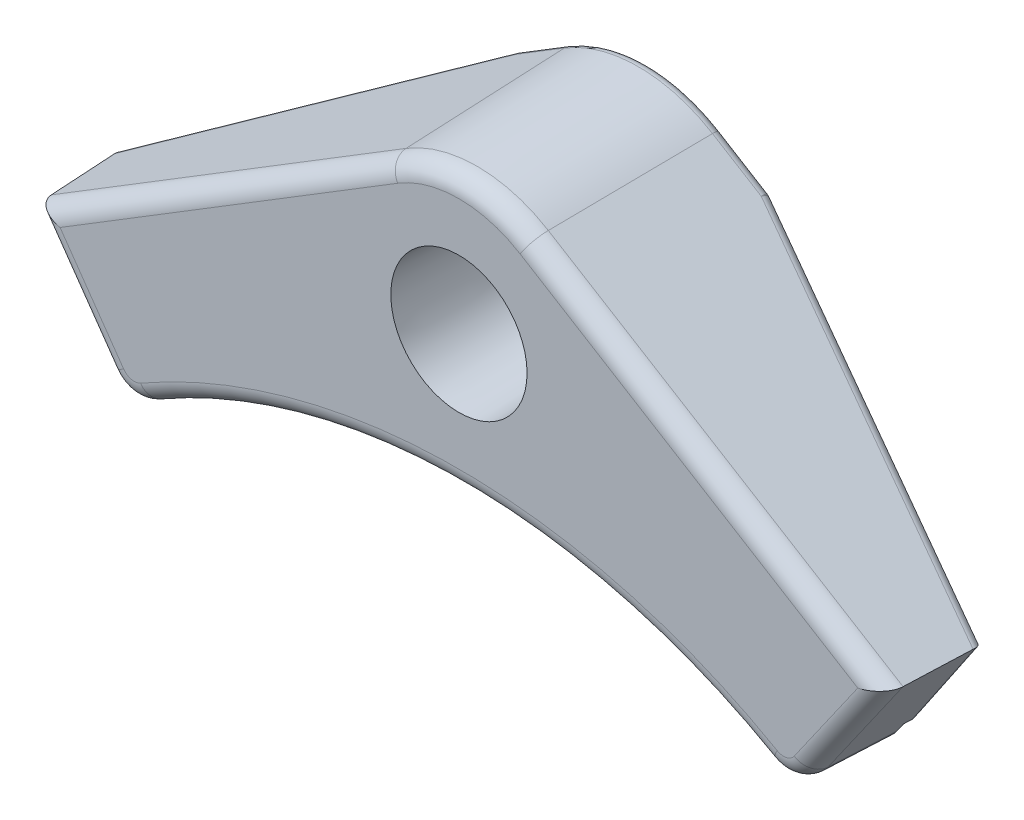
ISO-10303-21;
HEADER;
FILE_DESCRIPTION(('STEP AP214'),'2;1');
FILE_NAME('part.step','',(''),(''),'','','');
FILE_SCHEMA(('AUTOMOTIVE_DESIGN { 1 0 10303 214 1 1 1 1 }'));
ENDSEC;
DATA;
#1=APPLICATION_CONTEXT('core data for automotive mechanical design processes');
#2=APPLICATION_PROTOCOL_DEFINITION('international standard','automotive_design',2000,#1);
#3=PRODUCT_CONTEXT('',#1,'mechanical');
#4=PRODUCT('Part','Part','',(#3));
#5=PRODUCT_RELATED_PRODUCT_CATEGORY('part','',(#4));
#6=PRODUCT_DEFINITION_FORMATION('','',#4);
#7=PRODUCT_DEFINITION_CONTEXT('part definition',#1,'design');
#8=PRODUCT_DEFINITION('design','',#6,#7);
#9=PRODUCT_DEFINITION_SHAPE('','',#8);
#10=(LENGTH_UNIT() NAMED_UNIT(*) SI_UNIT(.MILLI.,.METRE.));
#11=(NAMED_UNIT(*) PLANE_ANGLE_UNIT() SI_UNIT($,.RADIAN.));
#12=(NAMED_UNIT(*) SI_UNIT($,.STERADIAN.) SOLID_ANGLE_UNIT());
#13=UNCERTAINTY_MEASURE_WITH_UNIT(LENGTH_MEASURE(1.E-05),#10,'distance_accuracy_value','');
#14=(GEOMETRIC_REPRESENTATION_CONTEXT(3) GLOBAL_UNCERTAINTY_ASSIGNED_CONTEXT((#13)) GLOBAL_UNIT_ASSIGNED_CONTEXT((#10,
#11,#12)) REPRESENTATION_CONTEXT('',''));
#15=CARTESIAN_POINT('',(0.,0.,0.));
#16=DIRECTION('',(0.,0.,1.));
#17=DIRECTION('',(1.,0.,0.));
#18=AXIS2_PLACEMENT_3D('',#15,#16,#17);
#19=CARTESIAN_POINT('',(-2.35311378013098,43.8357340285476,0.));
#20=DIRECTION('',(-0.522595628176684,0.851866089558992,0.0348994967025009));
#21=DIRECTION('',(-0.852385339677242,-0.522914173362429,0.));
#22=AXIS2_PLACEMENT_3D('',#19,#20,#21);
#23=PLANE('',#22);
#24=DIRECTION('',(0.852385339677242,0.522914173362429,0.));
#25=VECTOR('',#24,1.);
#26=CARTESIAN_POINT('',(-2.2618109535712,43.6869042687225,4.99999999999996));
#27=LINE('',#26,#25);
#28=CARTESIAN_POINT('',(-19.7876181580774,32.9353197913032,4.99999999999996));
#29=VERTEX_POINT('',#28);
#30=CARTESIAN_POINT('',(-5.26582385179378,41.8440277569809,4.99999999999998));
#31=VERTEX_POINT('',#30);
#32=EDGE_CURVE('E361',#29,#31,#27,.T.);
#33=ORIENTED_EDGE('',*,*,#32,.F.);
#34=DIRECTION('',(-0.819998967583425,-0.513411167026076,0.253003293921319));
#35=VECTOR('',#34,1.);
#36=CARTESIAN_POINT('',(-5.14910249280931,42.1006696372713,0.483417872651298));
#37=LINE('',#36,#35);
#38=CARTESIAN_POINT('',(-5.14629048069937,42.1024302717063,0.482550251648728));
#39=VERTEX_POINT('',#38);
#40=EDGE_CURVE('E906',#29,#39,#37,.F.);
#41=ORIENTED_EDGE('',*,*,#40,.T.);
#42=DIRECTION('',(0.852385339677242,0.522914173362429,0.));
#43=VECTOR('',#42,1.);
#44=CARTESIAN_POINT('',(-2.34430213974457,43.8213704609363,0.482550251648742));
#45=LINE('',#44,#43);
#46=CARTESIAN_POINT('',(-2.34430213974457,43.8213704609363,0.482550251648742));
#47=VERTEX_POINT('',#46);
#48=EDGE_CURVE('E905',#39,#47,#45,.T.);
#49=ORIENTED_EDGE('',*,*,#48,.T.);
#50=DIRECTION('',(-0.0182494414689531,0.0297478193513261,-0.999390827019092));
#51=VECTOR('',#50,1.);
#52=CARTESIAN_POINT('',(-2.35311378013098,43.8357340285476,0.));
#53=LINE('',#52,#51);
#54=CARTESIAN_POINT('',(-2.30746236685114,43.7613191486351,2.49999999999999));
#55=VERTEX_POINT('',#54);
#56=EDGE_CURVE('E362',#55,#47,#53,.T.);
#57=ORIENTED_EDGE('',*,*,#56,.F.);
#58=DIRECTION('',(-0.852385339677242,-0.522914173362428,0.));
#59=VECTOR('',#58,1.);
#60=CARTESIAN_POINT('',(-2.30746236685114,43.7613191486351,2.49999999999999));
#61=LINE('',#60,#59);
#62=CARTESIAN_POINT('',(-5.17852192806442,42.0000057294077,2.49999999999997));
#63=VERTEX_POINT('',#62);
#64=EDGE_CURVE('E310',#63,#55,#61,.F.);
#65=ORIENTED_EDGE('',*,*,#64,.F.);
#66=DIRECTION('',(-0.0348318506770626,-0.062232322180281,0.997453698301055));
#67=VECTOR('',#66,1.);
#68=CARTESIAN_POINT('',(-5.0842568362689,42.1684244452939,-0.199399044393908));
#69=LINE('',#68,#67);
#70=EDGE_CURVE('E331',#31,#63,#69,.F.);
#71=ORIENTED_EDGE('',*,*,#70,.F.);
#72=EDGE_LOOP('',(#33,#41,#49,#57,#65,#71));
#73=FACE_BOUND('',#72,.T.);
#74=ADVANCED_FACE('F30',(#73),#23,.F.);
#75=CARTESIAN_POINT('',(21.3795242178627,32.1635721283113,0.));
#76=DIRECTION('',(0.522595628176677,0.851866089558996,0.0348994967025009));
#77=DIRECTION('',(-0.852385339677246,0.522914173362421,0.));
#78=AXIS2_PLACEMENT_3D('',#75,#76,#77);
#79=PLANE('',#78);
#80=DIRECTION('',(0.852385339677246,-0.522914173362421,0.));
#81=VECTOR('',#80,1.);
#82=CARTESIAN_POINT('',(21.3707125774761,32.1492085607,0.482550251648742));
#83=LINE('',#82,#81);
#84=CARTESIAN_POINT('',(2.34430213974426,43.8213704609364,0.482550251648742));
#85=VERTEX_POINT('',#84);
#86=CARTESIAN_POINT('',(5.14629048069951,42.1024302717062,0.482550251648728));
#87=VERTEX_POINT('',#86);
#88=EDGE_CURVE('E909',#85,#87,#83,.T.);
#89=ORIENTED_EDGE('',*,*,#88,.T.);
#90=DIRECTION('',(0.819998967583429,-0.513411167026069,0.253003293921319));
#91=VECTOR('',#90,1.);
#92=CARTESIAN_POINT('',(20.1456040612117,32.7111805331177,5.11045332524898));
#93=LINE('',#92,#91);
#94=CARTESIAN_POINT('',(19.7876181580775,32.9353197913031,4.99999999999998));
#95=VERTEX_POINT('',#94);
#96=EDGE_CURVE('E913',#87,#95,#93,.T.);
#97=ORIENTED_EDGE('',*,*,#96,.T.);
#98=DIRECTION('',(0.852385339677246,-0.522914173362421,0.));
#99=VECTOR('',#98,1.);
#100=CARTESIAN_POINT('',(2.26181095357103,43.6869042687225,4.99999999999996));
#101=LINE('',#100,#99);
#102=CARTESIAN_POINT('',(5.26582385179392,41.8440277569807,4.99999999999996));
#103=VERTEX_POINT('',#102);
#104=EDGE_CURVE('E366',#103,#95,#101,.T.);
#105=ORIENTED_EDGE('',*,*,#104,.F.);
#106=DIRECTION('',(-0.0348318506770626,0.0622323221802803,-0.997453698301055));
#107=VECTOR('',#106,1.);
#108=CARTESIAN_POINT('',(5.13264213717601,42.0819768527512,1.18617468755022));
#109=LINE('',#108,#107);
#110=CARTESIAN_POINT('',(5.17852192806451,42.0000057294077,2.49999999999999));
#111=VERTEX_POINT('',#110);
#112=EDGE_CURVE('E329',#111,#103,#109,.F.);
#113=ORIENTED_EDGE('',*,*,#112,.F.);
#114=DIRECTION('',(-0.852385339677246,0.522914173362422,0.));
#115=VECTOR('',#114,1.);
#116=CARTESIAN_POINT('',(21.3338728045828,32.0891572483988,2.5000000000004));
#117=LINE('',#116,#115);
#118=CARTESIAN_POINT('',(2.30746236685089,43.761319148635,2.49999999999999));
#119=VERTEX_POINT('',#118);
#120=EDGE_CURVE('E334',#119,#111,#117,.F.);
#121=ORIENTED_EDGE('',*,*,#120,.F.);
#122=DIRECTION('',(0.0182494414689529,0.0297478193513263,-0.999390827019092));
#123=VECTOR('',#122,1.);
#124=CARTESIAN_POINT('',(2.35311378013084,43.8357340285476,0.));
#125=LINE('',#124,#123);
#126=EDGE_CURVE('E365',#119,#85,#125,.T.);
#127=ORIENTED_EDGE('',*,*,#126,.T.);
#128=EDGE_LOOP('',(#89,#97,#105,#113,#121,#127));
#129=FACE_BOUND('',#128,.T.);
#130=ADVANCED_FACE('F569',(#129),#79,.F.);
#131=CARTESIAN_POINT('',(-1.38777878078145E-13,40.,4.99999999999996));
#132=DIRECTION('',(0.,0.,-0.999999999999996));
#133=DIRECTION('',(-0.999999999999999,0.,0.));
#134=AXIS2_PLACEMENT_3D('',#131,#132,#133);
#135=PLANE('',#134);
#136=CARTESIAN_POINT('',(0.,0.,4.99999999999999));
#137=DIRECTION('',(0.,0.,-0.999999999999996));
#138=DIRECTION('',(-0.999999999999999,0.,0.));
#139=AXIS2_PLACEMENT_3D('',#136,#137,#138);
#140=CIRCLE('',#139,35.);
#141=CARTESIAN_POINT('',(-18.9985263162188,29.3948294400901,4.99999999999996));
#142=VERTEX_POINT('',#141);
#143=CARTESIAN_POINT('',(-4.69904018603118,34.6831230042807,4.99999999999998));
#144=VERTEX_POINT('',#143);
#145=EDGE_CURVE('E339',#142,#144,#140,.T.);
#146=ORIENTED_EDGE('',*,*,#145,.F.);
#147=CARTESIAN_POINT('',(-17.9069725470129,28.6976811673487,4.99999999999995));
#148=DIRECTION('',(0.,0.,-0.999999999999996));
#149=DIRECTION('',(-0.572137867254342,0.820157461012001,0.));
#150=AXIS2_PLACEMENT_3D('',#147,#148,#149);
#151=ELLIPSE('',#150,9.96098298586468,0.5);
#152=CARTESIAN_POINT('',(-20.918819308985,32.2413600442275,4.99999999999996));
#153=VERTEX_POINT('',#152);
#154=EDGE_CURVE('E690',#142,#153,#151,.T.);
#155=ORIENTED_EDGE('',*,*,#154,.T.);
#156=EDGE_CURVE('E375',#153,#29,#27,.T.);
#157=ORIENTED_EDGE('',*,*,#156,.T.);
#158=ORIENTED_EDGE('',*,*,#32,.T.);
#159=DIRECTION('',(0.,0.999999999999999,0.));
#160=VECTOR('',#159,1.);
#161=CARTESIAN_POINT('',(-5.26582385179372,42.0488692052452,4.99999999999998));
#162=LINE('',#161,#160);
#163=CARTESIAN_POINT('',(-5.26582385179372,35.1782943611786,4.99999999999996));
#164=VERTEX_POINT('',#163);
#165=EDGE_CURVE('E327',#164,#31,#162,.T.);
#166=ORIENTED_EDGE('',*,*,#165,.F.);
#167=CARTESIAN_POINT('',(-4.0249602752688,35.4570883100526,-14.6102930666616));
#168=CARTESIAN_POINT('',(-4.58025512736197,35.3948203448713,-14.6321196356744));
#169=CARTESIAN_POINT('',(-4.58101732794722,35.9535949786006,-14.6102930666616));
#170=CARTESIAN_POINT('',(-4.12314843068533,35.3455810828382,-11.7546689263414));
#171=CARTESIAN_POINT('',(-4.68014288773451,35.2812134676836,-11.7717084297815));
#172=CARTESIAN_POINT('',(-4.68073792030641,35.8419137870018,-11.7546689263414));
#173=CARTESIAN_POINT('',(-4.22132322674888,35.2335633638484,-8.89906505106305));
#174=CARTESIAN_POINT('',(-4.77986226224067,35.1672516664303,-8.91611916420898));
#175=CARTESIAN_POINT('',(-4.78045780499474,35.7297134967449,-8.89906505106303));
#176=CARTESIAN_POINT('',(-4.4176453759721,35.0084771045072,-3.18789987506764));
#177=CARTESIAN_POINT('',(-4.97929148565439,34.9382216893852,-3.20521341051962));
#178=CARTESIAN_POINT('',(-4.97989608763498,35.5042439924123,-3.18789987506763));
#179=CARTESIAN_POINT('',(-4.51579272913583,34.8954085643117,-0.332338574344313));
#180=CARTESIAN_POINT('',(-5.07900908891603,34.823140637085,-0.349674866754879));
#181=CARTESIAN_POINT('',(-5.07961448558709,35.3909747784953,-0.332338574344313));
#182=CARTESIAN_POINT('',(-4.71205929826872,34.6681907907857,5.37874027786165));
#183=CARTESIAN_POINT('',(-5.27843482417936,34.591838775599,5.36113099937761));
#184=CARTESIAN_POINT('',(-5.27904975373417,35.1633366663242,5.37874027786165));
#185=CARTESIAN_POINT('',(-4.81017851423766,34.5540415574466,8.23425782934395));
#186=CARTESIAN_POINT('',(-5.37815102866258,34.475604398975,8.21662948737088));
#187=CARTESIAN_POINT('',(-5.37876662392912,35.0489677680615,8.23425782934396));
#188=CARTESIAN_POINT('',(-5.00638807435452,34.3246302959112,13.9452478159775));
#189=CARTESIAN_POINT('',(-5.57757313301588,34.2419617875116,13.9273313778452));
#190=CARTESIAN_POINT('',(-5.57819878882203,34.8190972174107,13.9452478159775));
#191=CARTESIAN_POINT('',(-5.10447841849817,34.2093682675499,16.8007202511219));
#192=CARTESIAN_POINT('',(-5.67728744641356,34.124539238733,16.7827757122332));
#193=CARTESIAN_POINT('',(-5.67791408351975,34.7035955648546,16.800720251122));
#194=CARTESIAN_POINT('',(-5.20255394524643,34.0935338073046,19.6561690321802));
#195=CARTESIAN_POINT('',(-5.77680505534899,34.0067381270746,19.6325871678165));
#196=CARTESIAN_POINT('',(-5.77762855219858,34.5875110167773,19.6561690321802));
#197=(BOUNDED_SURFACE() B_SPLINE_SURFACE(3,2,((#167,#168,#169),(#170,#171,#172),(#173,#174,
#175),(#176,#177,#178),(#179,#180,#181),(#182,#183,#184),(#185,#186,#187),(#188,#189,#190),
(#191,#192,#193),(#194,#195,#196)),.UNSPECIFIED.,.F.,.F.,.F.) B_SPLINE_SURFACE_WITH_KNOTS((4,2,
2,2,4),(3,3),(0.,8.57863943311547,17.1572775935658,25.7359158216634,34.3145553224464),(0.,1.),
.UNSPECIFIED.) GEOMETRIC_REPRESENTATION_ITEM() RATIONAL_B_SPLINE_SURFACE(((1.,0.666544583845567,
1.),(1.,0.665395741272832,1.),(1.,0.664234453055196,1.),(1.,0.661886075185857,1.),(1.,
0.660698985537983,1.),(1.,0.658298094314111,1.),(1.,0.657084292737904,1.),(1.,0.654628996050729,
1.),(1.,0.653387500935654,1.),(1.,0.652131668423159,1.))) REPRESENTATION_ITEM('') SURFACE());
#198=CARTESIAN_POINT('',(-5.26582385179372,35.1782943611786,4.99999999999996));
#199=CARTESIAN_POINT('',(-5.26584779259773,35.1501670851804,4.99999999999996));
#200=CARTESIAN_POINT('',(-5.26345415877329,35.1220463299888,4.99999999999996));
#201=CARTESIAN_POINT('',(-5.25400476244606,35.0666213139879,4.99999999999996));
#202=CARTESIAN_POINT('',(-5.24695269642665,35.0393164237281,4.99999999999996));
#203=CARTESIAN_POINT('',(-5.22835425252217,34.986266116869,4.99999999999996));
#204=CARTESIAN_POINT('',(-5.21680560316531,34.9605214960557,4.99999999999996));
#205=CARTESIAN_POINT('',(-5.18954936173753,34.9113416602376,4.99999999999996));
#206=CARTESIAN_POINT('',(-5.17384229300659,34.8879061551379,4.99999999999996));
#207=CARTESIAN_POINT('',(-5.13872561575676,34.8440260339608,4.99999999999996));
#208=CARTESIAN_POINT('',(-5.11931889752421,34.8235791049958,4.99999999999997));
#209=CARTESIAN_POINT('',(-5.07734734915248,34.7862360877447,4.99999999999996));
#210=CARTESIAN_POINT('',(-5.05478261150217,34.7693398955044,4.99999999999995));
#211=CARTESIAN_POINT('',(-5.00714996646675,34.7395871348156,4.99999999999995));
#212=CARTESIAN_POINT('',(-4.98208358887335,34.726728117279,4.99999999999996));
#213=CARTESIAN_POINT('',(-4.9301443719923,34.7053942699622,4.99999999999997));
#214=CARTESIAN_POINT('',(-4.90327113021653,34.6969204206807,4.99999999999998));
#215=CARTESIAN_POINT('',(-4.84696225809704,34.6842673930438,4.99999999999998));
#216=CARTESIAN_POINT('',(-4.81746712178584,34.6803517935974,4.99999999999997));
#217=CARTESIAN_POINT('',(-4.75820933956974,34.6777685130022,4.99999999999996));
#218=CARTESIAN_POINT('',(-4.72844638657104,34.6791079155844,4.99999999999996));
#219=CARTESIAN_POINT('',(-4.69904018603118,34.6831230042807,4.99999999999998));
#220=B_SPLINE_CURVE_WITH_KNOTS('',3,(#198,#199,#200,#201,#202,#203,#204,#205,#206,#207,#208,
#209,#210,#211,#212,#213,#214,#215,#216,#217,#218,#219),.UNSPECIFIED.,.F.,.F.,(4,2,2,2,2,2,2,2,
2,2,4),(0.,0.0842708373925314,0.168474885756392,0.252721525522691,0.336957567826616,
0.421128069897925,0.505296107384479,0.589412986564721,0.673548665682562,0.762339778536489,
0.85125062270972),.UNSPECIFIED.);
#221=EDGE_CURVE('E719',#164,#144,#220,.T.);
#222=ORIENTED_EDGE('',*,*,#221,.T.);
#223=EDGE_LOOP('',(#146,#155,#157,#158,#166,#222));
#224=FACE_BOUND('',#223,.T.);
#225=ADVANCED_FACE('F701',(#224),#135,.T.);
#226=CARTESIAN_POINT('',(20.9188193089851,32.2413600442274,4.99999999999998));
#227=VERTEX_POINT('',#226);
#228=EDGE_CURVE('E372',#95,#227,#101,.T.);
#229=ORIENTED_EDGE('',*,*,#228,.T.);
#230=CARTESIAN_POINT('',(17.9069725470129,28.6976811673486,4.99999999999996));
#231=DIRECTION('',(0.,0.,-0.999999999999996));
#232=DIRECTION('',(-0.572137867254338,-0.820157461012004,0.));
#233=AXIS2_PLACEMENT_3D('',#230,#231,#232);
#234=ELLIPSE('',#233,9.96098298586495,0.5);
#235=CARTESIAN_POINT('',(18.9985263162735,29.394829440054,4.99999999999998));
#236=VERTEX_POINT('',#235);
#237=EDGE_CURVE('E932',#227,#236,#234,.T.);
#238=ORIENTED_EDGE('',*,*,#237,.T.);
#239=CARTESIAN_POINT('',(4.69904018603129,34.6831230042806,4.99999999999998));
#240=VERTEX_POINT('',#239);
#241=EDGE_CURVE('E338',#240,#236,#140,.T.);
#242=ORIENTED_EDGE('',*,*,#241,.F.);
#243=CARTESIAN_POINT('',(4.58101732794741,35.9535949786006,-14.6102930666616));
#244=CARTESIAN_POINT('',(4.58025512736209,35.3948203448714,-14.6321196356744));
#245=CARTESIAN_POINT('',(4.0249602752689,35.4570883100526,-14.6102930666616));
#246=CARTESIAN_POINT('',(4.6807379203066,35.8419137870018,-11.7546689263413));
#247=CARTESIAN_POINT('',(4.68014288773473,35.2812134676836,-11.7717084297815));
#248=CARTESIAN_POINT('',(4.12314843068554,35.3455810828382,-11.7546689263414));
#249=CARTESIAN_POINT('',(4.78045780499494,35.7297134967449,-8.899065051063));
#250=CARTESIAN_POINT('',(4.77986226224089,35.1672516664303,-8.91611916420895));
#251=CARTESIAN_POINT('',(4.22132322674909,35.2335633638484,-8.89906505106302));
#252=CARTESIAN_POINT('',(4.97989608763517,35.5042439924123,-3.18789987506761));
#253=CARTESIAN_POINT('',(4.97929148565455,34.9382216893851,-3.2052134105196));
#254=CARTESIAN_POINT('',(4.41764537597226,35.0084771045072,-3.18789987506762));
#255=CARTESIAN_POINT('',(5.07961448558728,35.3909747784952,-0.332338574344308));
#256=CARTESIAN_POINT('',(5.07900908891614,34.8231406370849,-0.349674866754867));
#257=CARTESIAN_POINT('',(4.51579272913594,34.8954085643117,-0.332338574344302));
#258=CARTESIAN_POINT('',(5.27904975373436,35.1633366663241,5.37874027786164));
#259=CARTESIAN_POINT('',(5.27843482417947,34.5918387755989,5.3611309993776));
#260=CARTESIAN_POINT('',(4.71205929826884,34.6681907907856,5.37874027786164));
#261=CARTESIAN_POINT('',(5.37876662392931,35.0489677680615,8.23425782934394));
#262=CARTESIAN_POINT('',(5.37815102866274,34.475604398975,8.21662948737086));
#263=CARTESIAN_POINT('',(4.81017851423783,34.5540415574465,8.23425782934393));
#264=CARTESIAN_POINT('',(5.57819878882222,34.8190972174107,13.9452478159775));
#265=CARTESIAN_POINT('',(5.57757313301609,34.2419617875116,13.9273313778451));
#266=CARTESIAN_POINT('',(5.00638807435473,34.3246302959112,13.9452478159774));
#267=CARTESIAN_POINT('',(5.67791408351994,34.7035955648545,16.8007202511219));
#268=CARTESIAN_POINT('',(5.67728744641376,34.124539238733,16.7827757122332));
#269=CARTESIAN_POINT('',(5.10447841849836,34.2093682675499,16.8007202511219));
#270=CARTESIAN_POINT('',(5.77762855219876,34.5875110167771,19.6561690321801));
#271=CARTESIAN_POINT('',(5.77680505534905,34.0067381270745,19.6325871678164));
#272=CARTESIAN_POINT('',(5.2025539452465,34.0935338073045,19.6561690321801));
#273=(BOUNDED_SURFACE() B_SPLINE_SURFACE(3,2,((#243,#244,#245),(#246,#247,#248),(#249,#250,
#251),(#252,#253,#254),(#255,#256,#257),(#258,#259,#260),(#261,#262,#263),(#264,#265,#266),
(#267,#268,#269),(#270,#271,#272)),.UNSPECIFIED.,.F.,.F.,.F.) B_SPLINE_SURFACE_WITH_KNOTS((4,2,
2,2,4),(3,3),(0.,8.57863943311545,17.1572775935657,25.7359158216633,34.3145553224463),(0.,1.),
.UNSPECIFIED.) GEOMETRIC_REPRESENTATION_ITEM() RATIONAL_B_SPLINE_SURFACE(((1.,0.666544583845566,
1.),(1.,0.66539574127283,1.),(1.,0.664234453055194,1.),(1.,0.661886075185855,1.),(1.,
0.660698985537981,1.),(1.,0.65829809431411,1.),(1.,0.657084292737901,1.),(1.,0.654628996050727,
1.),(1.,0.653387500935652,1.),(1.,0.652131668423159,1.))) REPRESENTATION_ITEM('') SURFACE());
#274=CARTESIAN_POINT('',(4.69904018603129,34.6831230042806,4.99999999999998));
#275=CARTESIAN_POINT('',(4.72690959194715,34.6793229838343,4.99999999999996));
#276=CARTESIAN_POINT('',(4.75509711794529,34.6779195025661,4.99999999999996));
#277=CARTESIAN_POINT('',(4.8112889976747,34.679842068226,4.99999999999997));
#278=CARTESIAN_POINT('',(4.83929347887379,34.6831643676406,4.99999999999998));
#279=CARTESIAN_POINT('',(4.89436048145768,34.6944719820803,4.99999999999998));
#280=CARTESIAN_POINT('',(4.92142251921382,34.7024596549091,4.99999999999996));
#281=CARTESIAN_POINT('',(4.97381647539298,34.7228663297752,4.99999999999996));
#282=CARTESIAN_POINT('',(4.99914861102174,34.7352847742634,4.99999999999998));
#283=CARTESIAN_POINT('',(5.04734616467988,34.7641922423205,4.99999999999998));
#284=CARTESIAN_POINT('',(5.07021348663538,34.7806780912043,4.99999999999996));
#285=CARTESIAN_POINT('',(5.11285343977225,34.8172560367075,4.99999999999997));
#286=CARTESIAN_POINT('',(5.13262616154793,34.8373480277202,4.99999999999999));
#287=CARTESIAN_POINT('',(5.16850463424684,34.8805548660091,4.99999999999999));
#288=CARTESIAN_POINT('',(5.18461260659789,34.9036678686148,4.99999999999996));
#289=CARTESIAN_POINT('',(5.21272657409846,34.9522726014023,4.99999999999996));
#290=CARTESIAN_POINT('',(5.22473165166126,34.9777648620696,4.99999999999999));
#291=CARTESIAN_POINT('',(5.24483005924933,35.0318651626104,4.99999999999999));
#292=CARTESIAN_POINT('',(5.25267018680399,35.0605675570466,4.99999999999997));
#293=CARTESIAN_POINT('',(5.26318593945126,35.1189420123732,4.99999999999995));
#294=CARTESIAN_POINT('',(5.26585458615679,35.1486153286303,4.99999999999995));
#295=CARTESIAN_POINT('',(5.26582385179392,35.1782943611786,4.99999999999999));
#296=B_SPLINE_CURVE_WITH_KNOTS('',3,(#274,#275,#276,#277,#278,#279,#280,#281,#282,#283,#284,
#285,#286,#287,#288,#289,#290,#291,#292,#293,#294,#295),.UNSPECIFIED.,.F.,.F.,(4,2,2,2,2,2,2,2,
2,2,4),(0.,0.0842708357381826,0.168474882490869,0.25272152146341,0.3369575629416,
0.421128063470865,0.505296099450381,0.589412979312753,0.673548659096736,0.762339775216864,
0.851250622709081),.UNSPECIFIED.);
#297=CARTESIAN_POINT('',(5.26582385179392,35.1782943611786,4.99999999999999));
#298=VERTEX_POINT('',#297);
#299=EDGE_CURVE('E714',#240,#298,#296,.T.);
#300=ORIENTED_EDGE('',*,*,#299,.T.);
#301=DIRECTION('',(0.,-0.999999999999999,0.));
#302=VECTOR('',#301,1.);
#303=CARTESIAN_POINT('',(5.26582385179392,42.048869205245,4.99999999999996));
#304=LINE('',#303,#302);
#305=EDGE_CURVE('E555',#103,#298,#304,.T.);
#306=ORIENTED_EDGE('',*,*,#305,.F.);
#307=ORIENTED_EDGE('',*,*,#104,.T.);
#308=EDGE_LOOP('',(#229,#238,#242,#300,#306,#307));
#309=FACE_BOUND('',#308,.T.);
#310=ADVANCED_FACE('F705',(#309),#135,.T.);
#311=CARTESIAN_POINT('',(-1.11022302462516E-13,40.,0.));
#312=DIRECTION('',(0.,0.,-0.999999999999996));
#313=DIRECTION('',(-0.999999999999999,0.,0.));
#314=AXIS2_PLACEMENT_3D('',#311,#312,#313);
#315=CONICAL_SURFACE('',#314,4.5,0.0349065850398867);
#316=ORIENTED_EDGE('',*,*,#56,.T.);
#317=CARTESIAN_POINT('',(-1.11022302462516E-13,40.,0.482550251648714));
#318=DIRECTION('',(0.,0.,0.999999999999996));
#319=DIRECTION('',(0.999999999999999,0.,0.));
#320=AXIS2_PLACEMENT_3D('',#317,#318,#319);
#321=CIRCLE('',#320,4.48314897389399);
#322=EDGE_CURVE('E576',#47,#85,#321,.F.);
#323=ORIENTED_EDGE('',*,*,#322,.T.);
#324=ORIENTED_EDGE('',*,*,#126,.F.);
#325=CARTESIAN_POINT('',(-1.11022302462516E-13,40.,2.49999999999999));
#326=DIRECTION('',(0.,0.,0.999999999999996));
#327=DIRECTION('',(0.999999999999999,0.,0.));
#328=AXIS2_PLACEMENT_3D('',#325,#326,#327);
#329=CIRCLE('',#328,4.41269807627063);
#330=EDGE_CURVE('E397',#55,#119,#329,.F.);
#331=ORIENTED_EDGE('',*,*,#330,.F.);
#332=EDGE_LOOP('',(#316,#323,#324,#331));
#333=FACE_BOUND('',#332,.T.);
#334=ADVANCED_FACE('F573',(#333),#315,.F.);
#335=CARTESIAN_POINT('',(0.,0.,0.));
#336=DIRECTION('',(0.,0.,0.999999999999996));
#337=DIRECTION('',(0.999999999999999,0.,0.));
#338=AXIS2_PLACEMENT_3D('',#335,#336,#337);
#339=PLANE('',#338);
#340=CARTESIAN_POINT('',(-1.11022302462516E-13,40.,0.));
#341=DIRECTION('',(0.,0.,0.999999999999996));
#342=DIRECTION('',(0.999999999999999,0.,0.));
#343=AXIS2_PLACEMENT_3D('',#340,#341,#342);
#344=CIRCLE('',#343,4.98284438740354);
#345=CARTESIAN_POINT('',(2.60559995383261,44.2473035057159,0.));
#346=VERTEX_POINT('',#345);
#347=CARTESIAN_POINT('',(-2.6055999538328,44.2473035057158,0.));
#348=VERTEX_POINT('',#347);
#349=EDGE_CURVE('E586',#346,#348,#344,.T.);
#350=ORIENTED_EDGE('',*,*,#349,.T.);
#351=DIRECTION('',(0.852385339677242,0.522914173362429,0.));
#352=VECTOR('',#351,1.);
#353=CARTESIAN_POINT('',(-20.4345749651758,33.3097341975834,0.));
#354=LINE('',#353,#352);
#355=CARTESIAN_POINT('',(-5.40758829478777,42.5283633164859,0.));
#356=VERTEX_POINT('',#355);
#357=EDGE_CURVE('E580',#348,#356,#354,.F.);
#358=ORIENTED_EDGE('',*,*,#357,.T.);
#359=DIRECTION('',(0.405643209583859,-0.914031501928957,0.));
#360=VECTOR('',#359,1.);
#361=CARTESIAN_POINT('',(-6.43418351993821,44.8415793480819,0.));
#362=LINE('',#361,#360);
#363=CARTESIAN_POINT('',(-6.2258084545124,44.3720500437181,0.));
#364=VERTEX_POINT('',#363);
#365=EDGE_CURVE('E938',#356,#364,#362,.F.);
#366=ORIENTED_EDGE('',*,*,#365,.T.);
#367=DIRECTION('',(0.852385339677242,0.522914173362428,0.));
#368=VECTOR('',#367,1.);
#369=CARTESIAN_POINT('',(-21.4800845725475,35.0139853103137,0.));
#370=LINE('',#369,#368);
#371=CARTESIAN_POINT('',(-3.65110956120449,45.9515546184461,0.));
#372=VERTEX_POINT('',#371);
#373=EDGE_CURVE('E940',#364,#372,#370,.T.);
#374=ORIENTED_EDGE('',*,*,#373,.T.);
#375=CARTESIAN_POINT('',(-1.11022302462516E-13,40.,0.));
#376=DIRECTION('',(0.,0.,0.999999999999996));
#377=DIRECTION('',(0.999999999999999,0.,0.));
#378=AXIS2_PLACEMENT_3D('',#375,#376,#377);
#379=CIRCLE('',#378,6.98223484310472);
#380=CARTESIAN_POINT('',(3.65110956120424,45.9515546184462,0.));
#381=VERTEX_POINT('',#380);
#382=EDGE_CURVE('E942',#372,#381,#379,.F.);
#383=ORIENTED_EDGE('',*,*,#382,.T.);
#384=DIRECTION('',(0.852385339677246,-0.522914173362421,0.));
#385=VECTOR('',#384,1.);
#386=CARTESIAN_POINT('',(21.4800845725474,35.0139853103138,0.));
#387=LINE('',#386,#385);
#388=CARTESIAN_POINT('',(6.22580845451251,44.3720500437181,0.));
#389=VERTEX_POINT('',#388);
#390=EDGE_CURVE('E944',#381,#389,#387,.T.);
#391=ORIENTED_EDGE('',*,*,#390,.T.);
#392=DIRECTION('',(-0.405643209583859,-0.914031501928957,0.));
#393=VECTOR('',#392,1.);
#394=CARTESIAN_POINT('',(-11.2504808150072,4.99291450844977,0.));
#395=LINE('',#394,#393);
#396=CARTESIAN_POINT('',(5.40758829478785,42.5283633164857,0.));
#397=VERTEX_POINT('',#396);
#398=EDGE_CURVE('E946',#389,#397,#395,.T.);
#399=ORIENTED_EDGE('',*,*,#398,.T.);
#400=DIRECTION('',(0.852385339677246,-0.522914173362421,0.));
#401=VECTOR('',#400,1.);
#402=CARTESIAN_POINT('',(20.4345749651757,33.3097341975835,0.));
#403=LINE('',#402,#401);
#404=EDGE_CURVE('E948',#397,#346,#403,.F.);
#405=ORIENTED_EDGE('',*,*,#404,.T.);
#406=EDGE_LOOP('',(#350,#358,#366,#374,#383,#391,#399,#405));
#407=FACE_BOUND('',#406,.T.);
#408=ADVANCED_FACE('F951',(#407),#339,.F.);
#409=CARTESIAN_POINT('',(-3.92185630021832,46.3928900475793,0.));
#410=DIRECTION('',(-0.522595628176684,0.851866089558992,0.0348994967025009));
#411=DIRECTION('',(-0.852385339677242,-0.522914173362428,0.));
#412=AXIS2_PLACEMENT_3D('',#409,#410,#411);
#413=PLANE('',#412);
#414=DIRECTION('',(-0.0498226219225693,0.0103504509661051,-0.998704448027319));
#415=VECTOR('',#414,1.);
#416=CARTESIAN_POINT('',(-22.9348905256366,34.7179492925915,0.26812885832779));
#417=LINE('',#416,#415);
#418=CARTESIAN_POINT('',(-22.4975404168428,34.627091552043,9.03489949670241));
#419=VERTEX_POINT('',#418);
#420=CARTESIAN_POINT('',(-22.6733102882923,34.6636070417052,5.51155717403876));
#421=VERTEX_POINT('',#420);
#422=EDGE_CURVE('E384',#419,#421,#417,.T.);
#423=ORIENTED_EDGE('',*,*,#422,.F.);
#424=DIRECTION('',(-0.852385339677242,-0.522914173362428,0.));
#425=VECTOR('',#424,1.);
#426=CARTESIAN_POINT('',(-3.75687392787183,46.1239576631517,9.03489949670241));
#427=LINE('',#426,#425);
#428=CARTESIAN_POINT('',(-3.75687392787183,46.1239576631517,9.03489949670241));
#429=VERTEX_POINT('',#428);
#430=EDGE_CURVE('E11',#419,#429,#427,.F.);
#431=ORIENTED_EDGE('',*,*,#430,.T.);
#432=DIRECTION('',(-0.0182494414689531,0.0297478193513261,-0.999390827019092));
#433=VECTOR('',#432,1.);
#434=CARTESIAN_POINT('',(-3.92185630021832,46.3928900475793,0.));
#435=LINE('',#434,#433);
#436=CARTESIAN_POINT('',(-3.9124073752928,46.3774876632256,0.517449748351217));
#437=VERTEX_POINT('',#436);
#438=EDGE_CURVE('E386',#429,#437,#435,.T.);
#439=ORIENTED_EDGE('',*,*,#438,.T.);
#440=DIRECTION('',(-0.852385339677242,-0.522914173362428,0.));
#441=VECTOR('',#440,1.);
#442=CARTESIAN_POINT('',(-3.9124073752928,46.3774876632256,0.517449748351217));
#443=LINE('',#442,#441);
#444=CARTESIAN_POINT('',(-6.48710626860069,44.7979830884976,0.517449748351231));
#445=VERTEX_POINT('',#444);
#446=EDGE_CURVE('E399',#437,#445,#443,.T.);
#447=ORIENTED_EDGE('',*,*,#446,.T.);
#448=DIRECTION('',(-0.819998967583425,-0.513411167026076,0.253003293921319));
#449=VECTOR('',#448,1.);
#450=CARTESIAN_POINT('',(-22.5821091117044,34.7207091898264,5.48341787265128));
#451=LINE('',#450,#449);
#452=EDGE_CURVE('E401',#445,#421,#451,.T.);
#453=ORIENTED_EDGE('',*,*,#452,.T.);
#454=EDGE_LOOP('',(#423,#431,#439,#447,#453));
#455=FACE_BOUND('',#454,.T.);
#456=ADVANCED_FACE('F800',(#455),#413,.T.);
#457=CARTESIAN_POINT('',(-18.7925766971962,28.7857876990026,0.));
#458=DIRECTION('',(-0.818653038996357,-0.573227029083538,0.0348994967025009));
#459=DIRECTION('',(0.573576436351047,-0.819152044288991,0.));
#460=AXIS2_PLACEMENT_3D('',#457,#458,#459);
#461=PLANE('',#460);
#462=DIRECTION('',(-0.0285879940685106,-0.0200175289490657,-0.999390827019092));
#463=VECTOR('',#462,1.);
#464=CARTESIAN_POINT('',(-18.7925766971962,28.7857876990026,0.));
#465=LINE('',#464,#463);
#466=CARTESIAN_POINT('',(-18.5341296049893,28.9667543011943,9.03489949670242));
#467=VERTEX_POINT('',#466);
#468=CARTESIAN_POINT('',(-18.6352468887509,28.8959512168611,5.49999999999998));
#469=VERTEX_POINT('',#468);
#470=EDGE_CURVE('E382',#467,#469,#465,.T.);
#471=ORIENTED_EDGE('',*,*,#470,.F.);
#472=DIRECTION('',(0.573576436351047,-0.819152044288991,0.));
#473=VECTOR('',#472,1.);
#474=CARTESIAN_POINT('',(-22.4770013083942,34.5977586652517,9.03489949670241));
#475=LINE('',#474,#473);
#476=EDGE_CURVE('E39',#467,#419,#475,.F.);
#477=ORIENTED_EDGE('',*,*,#476,.T.);
#478=ORIENTED_EDGE('',*,*,#422,.T.);
#479=CARTESIAN_POINT('',(-22.3870739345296,34.2532883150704,5.48641286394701));
#480=DIRECTION('',(-0.818653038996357,-0.573227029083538,0.0348994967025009));
#481=DIRECTION('',(-0.0991611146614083,0.200950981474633,0.974569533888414));
#482=AXIS2_PLACEMENT_3D('',#479,#480,#481);
#483=ELLIPSE('',#482,0.513122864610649,0.5);
#484=CARTESIAN_POINT('',(-22.6720370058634,34.6550014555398,5.40007768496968));
#485=VERTEX_POINT('',#484);
#486=EDGE_CURVE('E406',#421,#485,#483,.T.);
#487=ORIENTED_EDGE('',*,*,#486,.T.);
#488=DIRECTION('',(-0.571416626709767,0.819123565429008,0.0501958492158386));
#489=VECTOR('',#488,1.);
#490=CARTESIAN_POINT('',(-20.9594477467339,32.2000112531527,5.24963601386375));
#491=LINE('',#490,#489);
#492=CARTESIAN_POINT('',(-19.0013108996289,29.3930295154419,5.07762431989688));
#493=VERTEX_POINT('',#492);
#494=EDGE_CURVE('E404',#485,#493,#491,.F.);
#495=ORIENTED_EDGE('',*,*,#494,.T.);
#496=CARTESIAN_POINT('',(0.,0.,-31.9830268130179));
#497=DIRECTION('',(-0.818653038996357,-0.573227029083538,0.0348994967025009));
#498=DIRECTION('',(-0.0285879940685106,-0.0200175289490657,-0.999390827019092));
#499=AXIS2_PLACEMENT_3D('',#496,#497,#498);
#500=ELLIPSE('',#499,1002.87979217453,35.);
#501=CARTESIAN_POINT('',(-18.9889138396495,29.4010399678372,5.49999999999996));
#502=VERTEX_POINT('',#501);
#503=EDGE_CURVE('E344',#493,#502,#500,.F.);
#504=ORIENTED_EDGE('',*,*,#503,.T.);
#505=DIRECTION('',(0.573576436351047,-0.819152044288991,0.));
#506=VECTOR('',#505,1.);
#507=CARTESIAN_POINT('',(-18.6352468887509,28.8959512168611,5.49999999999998));
#508=LINE('',#507,#506);
#509=EDGE_CURVE('E378',#469,#502,#508,.F.);
#510=ORIENTED_EDGE('',*,*,#509,.F.);
#511=EDGE_LOOP('',(#471,#477,#478,#487,#495,#504,#510));
#512=FACE_BOUND('',#511,.T.);
#513=ADVANCED_FACE('F1044',(#512),#461,.T.);
#514=CARTESIAN_POINT('',(0.,0.,0.));
#515=DIRECTION('',(0.,0.,0.999999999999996));
#516=DIRECTION('',(0.999999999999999,0.,0.));
#517=AXIS2_PLACEMENT_3D('',#514,#515,#516);
#518=CONICAL_SURFACE('',#517,32.5,0.0349065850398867);
#519=DIRECTION('',(-0.0173529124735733,-0.0302795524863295,-0.999390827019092));
#520=VECTOR('',#519,1.);
#521=CARTESIAN_POINT('',(16.1598220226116,28.1976976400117,0.));
#522=LINE('',#521,#520);
#523=CARTESIAN_POINT('',(16.31669940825,28.4714371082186,9.03489949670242));
#524=VERTEX_POINT('',#523);
#525=CARTESIAN_POINT('',(16.255321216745,28.3643366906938,5.49999999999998));
#526=VERTEX_POINT('',#525);
#527=EDGE_CURVE('E376',#524,#526,#522,.T.);
#528=ORIENTED_EDGE('',*,*,#527,.F.);
#529=CARTESIAN_POINT('',(0.,0.,9.03489949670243));
#530=DIRECTION('',(0.,0.,0.999999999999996));
#531=DIRECTION('',(0.999999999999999,0.,0.));
#532=AXIS2_PLACEMENT_3D('',#529,#530,#531);
#533=CIRCLE('',#532,32.8155056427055);
#534=CARTESIAN_POINT('',(-16.3166994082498,28.4714371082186,9.03489949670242));
#535=VERTEX_POINT('',#534);
#536=EDGE_CURVE('E756',#524,#535,#533,.T.);
#537=ORIENTED_EDGE('',*,*,#536,.T.);
#538=DIRECTION('',(0.0173529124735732,-0.0302795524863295,-0.999390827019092));
#539=VECTOR('',#538,1.);
#540=CARTESIAN_POINT('',(-16.1598220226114,28.1976976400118,0.));
#541=LINE('',#540,#539);
#542=CARTESIAN_POINT('',(-16.2553212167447,28.3643366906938,5.49999999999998));
#543=VERTEX_POINT('',#542);
#544=EDGE_CURVE('E380',#535,#543,#541,.T.);
#545=ORIENTED_EDGE('',*,*,#544,.T.);
#546=CARTESIAN_POINT('',(0.,0.,5.49999999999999));
#547=DIRECTION('',(0.,0.,-0.999999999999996));
#548=DIRECTION('',(-0.999999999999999,0.,0.));
#549=AXIS2_PLACEMENT_3D('',#546,#547,#548);
#550=CIRCLE('',#549,32.6920642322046);
#551=EDGE_CURVE('E352',#526,#543,#550,.F.);
#552=ORIENTED_EDGE('',*,*,#551,.F.);
#553=EDGE_LOOP('',(#528,#537,#545,#552));
#554=FACE_BOUND('',#553,.T.);
#555=ADVANCED_FACE('F761',(#554),#518,.F.);
#556=CARTESIAN_POINT('',(17.1542726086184,29.9329405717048,0.));
#557=DIRECTION('',(0.,0.,-0.999999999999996));
#558=DIRECTION('',(0.999999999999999,0.,0.));
#559=AXIS2_PLACEMENT_3D('',#556,#557,#558);
#560=CONICAL_SURFACE('',#559,1.99999999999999,0.0349065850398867);
#561=DIRECTION('',(0.0285879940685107,-0.0200175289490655,-0.999390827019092));
#562=VECTOR('',#561,1.);
#563=CARTESIAN_POINT('',(18.7925766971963,28.7857876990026,0.));
#564=LINE('',#563,#562);
#565=CARTESIAN_POINT('',(18.5341296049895,28.9667543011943,9.03489949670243));
#566=VERTEX_POINT('',#565);
#567=CARTESIAN_POINT('',(18.6352468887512,28.8959512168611,5.49999999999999));
#568=VERTEX_POINT('',#567);
#569=EDGE_CURVE('E379',#566,#568,#564,.T.);
#570=ORIENTED_EDGE('',*,*,#569,.F.);
#571=CARTESIAN_POINT('',(17.1542726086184,29.9329405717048,9.03489949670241));
#572=DIRECTION('',(0.,0.,-0.999999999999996));
#573=DIRECTION('',(-0.999999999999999,0.,0.));
#574=AXIS2_PLACEMENT_3D('',#571,#572,#573);
#575=CIRCLE('',#574,1.68449435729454);
#576=EDGE_CURVE('E754',#566,#524,#575,.T.);
#577=ORIENTED_EDGE('',*,*,#576,.T.);
#578=ORIENTED_EDGE('',*,*,#527,.T.);
#579=CARTESIAN_POINT('',(17.1542726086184,29.9329405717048,5.49999999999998));
#580=DIRECTION('',(0.,0.,-0.999999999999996));
#581=DIRECTION('',(-0.999999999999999,0.,0.));
#582=AXIS2_PLACEMENT_3D('',#579,#580,#581);
#583=CIRCLE('',#582,1.80793576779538);
#584=EDGE_CURVE('E355',#568,#526,#583,.T.);
#585=ORIENTED_EDGE('',*,*,#584,.F.);
#586=EDGE_LOOP('',(#570,#577,#578,#585));
#587=FACE_BOUND('',#586,.T.);
#588=ADVANCED_FACE('F1043',(#587),#560,.T.);
#589=CARTESIAN_POINT('',(-17.1542726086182,29.9329405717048,0.));
#590=DIRECTION('',(0.,0.,-0.999999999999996));
#591=DIRECTION('',(-0.999999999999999,0.,0.));
#592=AXIS2_PLACEMENT_3D('',#589,#590,#591);
#593=CONICAL_SURFACE('',#592,2.,0.0349065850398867);
#594=ORIENTED_EDGE('',*,*,#544,.F.);
#595=CARTESIAN_POINT('',(-17.1542726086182,29.9329405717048,9.03489949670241));
#596=DIRECTION('',(0.,0.,-0.999999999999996));
#597=DIRECTION('',(-0.999999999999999,0.,0.));
#598=AXIS2_PLACEMENT_3D('',#595,#596,#597);
#599=CIRCLE('',#598,1.68449435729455);
#600=EDGE_CURVE('E53',#535,#467,#599,.T.);
#601=ORIENTED_EDGE('',*,*,#600,.T.);
#602=ORIENTED_EDGE('',*,*,#470,.T.);
#603=CARTESIAN_POINT('',(-17.1542726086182,29.9329405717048,5.49999999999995));
#604=DIRECTION('',(0.,0.,-0.999999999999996));
#605=DIRECTION('',(-0.999999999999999,0.,0.));
#606=AXIS2_PLACEMENT_3D('',#603,#604,#605);
#607=CIRCLE('',#606,1.80793576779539);
#608=EDGE_CURVE('E349',#543,#469,#607,.T.);
#609=ORIENTED_EDGE('',*,*,#608,.F.);
#610=EDGE_LOOP('',(#594,#601,#602,#609));
#611=FACE_BOUND('',#610,.T.);
#612=ADVANCED_FACE('F768',(#611),#593,.T.);
#613=CARTESIAN_POINT('',(-1.11022302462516E-13,40.,0.));
#614=DIRECTION('',(0.,0.,0.999999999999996));
#615=DIRECTION('',(0.999999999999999,0.,0.));
#616=AXIS2_PLACEMENT_3D('',#613,#614,#615);
#617=CONICAL_SURFACE('',#616,3.25,0.0349065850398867);
#618=CARTESIAN_POINT('',(0.,40.,9.9999999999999));
#619=DIRECTION('',(0.,0.,0.999999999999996));
#620=DIRECTION('',(0.999999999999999,0.,0.));
#621=AXIS2_PLACEMENT_3D('',#618,#619,#620);
#622=CIRCLE('',#621,3.59920769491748);
#623=CARTESIAN_POINT('',(3.59920769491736,40.,9.9999999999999));
#624=VERTEX_POINT('',#623);
#625=EDGE_CURVE('E369',#624,#624,#622,.T.);
#626=CARTESIAN_POINT('',(-1.38777878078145E-13,40.,4.99999999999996));
#627=DIRECTION('',(0.,0.,-0.999999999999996));
#628=DIRECTION('',(-0.999999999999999,0.,0.));
#629=AXIS2_PLACEMENT_3D('',#626,#627,#628);
#630=CIRCLE('',#629,3.42460384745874);
#631=CARTESIAN_POINT('',(3.42460384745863,40.,4.99999999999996));
#632=VERTEX_POINT('',#631);
#633=EDGE_CURVE('E328',#632,#632,#630,.T.);
#634=CARTESIAN_POINT('',(3.59920769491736,40.,9.9999999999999));
#635=CARTESIAN_POINT('',(3.59738890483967,40.,9.94791666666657));
#636=CARTESIAN_POINT('',(3.59557011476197,40.,9.89583333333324));
#637=CARTESIAN_POINT('',(3.59193253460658,40.,9.79166666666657));
#638=CARTESIAN_POINT('',(3.59011374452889,40.,9.73958333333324));
#639=CARTESIAN_POINT('',(3.5864761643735,40.,9.63541666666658));
#640=CARTESIAN_POINT('',(3.5846573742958,40.,9.58333333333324));
#641=CARTESIAN_POINT('',(3.58101979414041,40.,9.47916666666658));
#642=CARTESIAN_POINT('',(3.57920100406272,40.,9.42708333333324));
#643=CARTESIAN_POINT('',(3.57556342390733,40.,9.32291666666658));
#644=CARTESIAN_POINT('',(3.57374463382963,40.,9.27083333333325));
#645=CARTESIAN_POINT('',(3.57010705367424,40.,9.16666666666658));
#646=CARTESIAN_POINT('',(3.56828826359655,40.,9.11458333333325));
#647=CARTESIAN_POINT('',(3.56465068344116,40.,9.01041666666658));
#648=CARTESIAN_POINT('',(3.56283189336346,40.,8.95833333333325));
#649=CARTESIAN_POINT('',(3.55919431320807,40.,8.85416666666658));
#650=CARTESIAN_POINT('',(3.55737552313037,40.,8.80208333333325));
#651=CARTESIAN_POINT('',(3.55373794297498,40.,8.69791666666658));
#652=CARTESIAN_POINT('',(3.55191915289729,40.,8.64583333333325));
#653=CARTESIAN_POINT('',(3.5482815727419,40.,8.54166666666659));
#654=CARTESIAN_POINT('',(3.5464627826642,40.,8.48958333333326));
#655=CARTESIAN_POINT('',(3.54282520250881,40.,8.38541666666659));
#656=CARTESIAN_POINT('',(3.54100641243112,40.,8.33333333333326));
#657=CARTESIAN_POINT('',(3.53736883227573,40.,8.22916666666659));
#658=CARTESIAN_POINT('',(3.53555004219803,40.,8.17708333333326));
#659=CARTESIAN_POINT('',(3.53191246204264,40.,8.07291666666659));
#660=CARTESIAN_POINT('',(3.53009367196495,40.,8.02083333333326));
#661=CARTESIAN_POINT('',(3.52645609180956,40.,7.91666666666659));
#662=CARTESIAN_POINT('',(3.52463730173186,40.,7.86458333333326));
#663=CARTESIAN_POINT('',(3.52099972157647,40.,7.7604166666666));
#664=CARTESIAN_POINT('',(3.51918093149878,40.,7.70833333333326));
#665=CARTESIAN_POINT('',(3.51554335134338,40.,7.6041666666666));
#666=CARTESIAN_POINT('',(3.51372456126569,40.,7.55208333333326));
#667=CARTESIAN_POINT('',(3.5100869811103,40.,7.4479166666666));
#668=CARTESIAN_POINT('',(3.5082681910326,40.,7.39583333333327));
#669=CARTESIAN_POINT('',(3.50463061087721,40.,7.2916666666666));
#670=CARTESIAN_POINT('',(3.50281182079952,40.,7.23958333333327));
#671=CARTESIAN_POINT('',(3.49917424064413,40.,7.1354166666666));
#672=CARTESIAN_POINT('',(3.49735545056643,40.,7.08333333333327));
#673=CARTESIAN_POINT('',(3.49371787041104,40.,6.97916666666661));
#674=CARTESIAN_POINT('',(3.49189908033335,40.,6.92708333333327));
#675=CARTESIAN_POINT('',(3.48826150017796,40.,6.82291666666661));
#676=CARTESIAN_POINT('',(3.48644271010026,40.,6.77083333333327));
#677=CARTESIAN_POINT('',(3.48280512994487,40.,6.66666666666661));
#678=CARTESIAN_POINT('',(3.48098633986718,40.,6.61458333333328));
#679=CARTESIAN_POINT('',(3.47734875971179,40.,6.51041666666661));
#680=CARTESIAN_POINT('',(3.47552996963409,40.,6.45833333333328));
#681=CARTESIAN_POINT('',(3.4718923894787,40.,6.35416666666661));
#682=CARTESIAN_POINT('',(3.47007359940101,40.,6.30208333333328));
#683=CARTESIAN_POINT('',(3.46643601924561,40.,6.19791666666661));
#684=CARTESIAN_POINT('',(3.46461722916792,40.,6.14583333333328));
#685=CARTESIAN_POINT('',(3.46097964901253,40.,6.04166666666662));
#686=CARTESIAN_POINT('',(3.45916085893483,40.,5.98958333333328));
#687=CARTESIAN_POINT('',(3.45552327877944,40.,5.88541666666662));
#688=CARTESIAN_POINT('',(3.45370448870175,40.,5.83333333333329));
#689=CARTESIAN_POINT('',(3.45006690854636,40.,5.72916666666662));
#690=CARTESIAN_POINT('',(3.44824811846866,40.,5.67708333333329));
#691=CARTESIAN_POINT('',(3.44461053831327,40.,5.57291666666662));
#692=CARTESIAN_POINT('',(3.44279174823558,40.,5.52083333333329));
#693=CARTESIAN_POINT('',(3.43915416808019,40.,5.41666666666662));
#694=CARTESIAN_POINT('',(3.43733537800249,40.,5.36458333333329));
#695=CARTESIAN_POINT('',(3.4336977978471,40.,5.26041666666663));
#696=CARTESIAN_POINT('',(3.43187900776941,40.,5.20833333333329));
#697=CARTESIAN_POINT('',(3.42824142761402,40.,5.10416666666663));
#698=CARTESIAN_POINT('',(3.42642263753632,40.,5.05208333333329));
#699=CARTESIAN_POINT('',(3.42460384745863,40.,4.99999999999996));
#700=B_SPLINE_CURVE_WITH_KNOTS('',3,(#634,#635,#636,#637,#638,#639,#640,#641,#642,#643,#644,
#645,#646,#647,#648,#649,#650,#651,#652,#653,#654,#655,#656,#657,#658,#659,#660,#661,#662,#663,
#664,#665,#666,#667,#668,#669,#670,#671,#672,#673,#674,#675,#676,#677,#678,#679,#680,#681,#682,
#683,#684,#685,#686,#687,#688,#689,#690,#691,#692,#693,#694,#695,#696,#697,#698,#699),
.UNSPECIFIED.,.F.,.F.,(4,2,2,2,2,2,2,2,2,2,2,2,2,2,2,2,2,2,2,2,2,2,2,2,2,2,2,2,2,2,2,2,4),(0.,
0.156345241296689,0.312690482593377,0.469035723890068,0.625380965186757,0.781726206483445,
0.938071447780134,1.09441668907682,1.25076193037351,1.4071071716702,1.56345241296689,
1.71979765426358,1.87614289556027,2.03248813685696,2.18883337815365,2.34517861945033,
2.50152386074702,2.65786910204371,2.8142143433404,2.97055958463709,3.12690482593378,
3.28325006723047,3.43959530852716,3.59594054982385,3.75228579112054,3.90863103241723,
4.06497627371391,4.2213215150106,4.37766675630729,4.53401199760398,4.69035723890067,
4.84670248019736,5.00304772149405),.UNSPECIFIED.);
#701=EDGE_CURVE('BSEAM1039',#624,#632,#700,.T.);
#702=ORIENTED_EDGE('',*,*,#625,.T.);
#703=ORIENTED_EDGE('',*,*,#633,.T.);
#704=ORIENTED_EDGE('',*,*,#701,.T.);
#705=ORIENTED_EDGE('',*,*,#701,.F.);
#706=EDGE_LOOP('',(#702,#704,#703,#705));
#707=FACE_BOUND('',#706,.T.);
#708=ADVANCED_FACE('F1039',(#707),#617,.F.);
#709=CARTESIAN_POINT('',(0.,0.,9.99999999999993));
#710=DIRECTION('',(0.,0.,0.999999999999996));
#711=DIRECTION('',(0.999999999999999,0.,0.));
#712=AXIS2_PLACEMENT_3D('',#709,#710,#711);
#713=PLANE('',#712);
#714=DIRECTION('',(0.852385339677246,-0.522914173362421,0.));
#715=VECTOR('',#714,1.);
#716=CARTESIAN_POINT('',(3.23427829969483,45.2720915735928,9.9999999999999));
#717=LINE('',#716,#715);
#718=CARTESIAN_POINT('',(21.0698266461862,34.3304897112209,9.99999999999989));
#719=VERTEX_POINT('',#718);
#720=CARTESIAN_POINT('',(3.23427829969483,45.2720915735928,9.9999999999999));
#721=VERTEX_POINT('',#720);
#722=EDGE_CURVE('E742',#719,#721,#717,.F.);
#723=ORIENTED_EDGE('',*,*,#722,.T.);
#724=CARTESIAN_POINT('',(0.,40.,9.9999999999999));
#725=DIRECTION('',(0.,0.,0.999999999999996));
#726=DIRECTION('',(0.999999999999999,0.,0.));
#727=AXIS2_PLACEMENT_3D('',#724,#725,#726);
#728=CIRCLE('',#727,6.18510353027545);
#729=CARTESIAN_POINT('',(-3.23427829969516,45.2720915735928,9.99999999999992));
#730=VERTEX_POINT('',#729);
#731=EDGE_CURVE('E744',#721,#730,#728,.T.);
#732=ORIENTED_EDGE('',*,*,#731,.T.);
#733=DIRECTION('',(0.852385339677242,0.522914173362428,0.));
#734=VECTOR('',#733,1.);
#735=CARTESIAN_POINT('',(-21.9444218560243,33.7939504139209,9.9999999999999));
#736=LINE('',#735,#734);
#737=CARTESIAN_POINT('',(-21.0698266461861,34.3304897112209,9.99999999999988));
#738=VERTEX_POINT('',#737);
#739=EDGE_CURVE('E730',#730,#738,#736,.F.);
#740=ORIENTED_EDGE('',*,*,#739,.T.);
#741=DIRECTION('',(-0.573576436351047,0.819152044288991,0.));
#742=VECTOR('',#741,1.);
#743=CARTESIAN_POINT('',(-17.7154765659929,29.5399813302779,9.9999999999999));
#744=LINE('',#743,#742);
#745=CARTESIAN_POINT('',(-17.7154765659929,29.5399813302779,9.9999999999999));
#746=VERTEX_POINT('',#745);
#747=EDGE_CURVE('E732',#738,#746,#744,.F.);
#748=ORIENTED_EDGE('',*,*,#747,.T.);
#749=CARTESIAN_POINT('',(-17.1542726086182,29.9329405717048,9.9999999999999));
#750=DIRECTION('',(0.,0.,0.999999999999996));
#751=DIRECTION('',(0.999999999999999,0.,0.));
#752=AXIS2_PLACEMENT_3D('',#749,#750,#751);
#753=CIRCLE('',#752,0.685103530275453);
#754=CARTESIAN_POINT('',(-16.8136218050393,29.3385300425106,9.99999999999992));
#755=VERTEX_POINT('',#754);
#756=EDGE_CURVE('E734',#746,#755,#753,.T.);
#757=ORIENTED_EDGE('',*,*,#756,.T.);
#758=CARTESIAN_POINT('',(0.,0.,9.99999999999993));
#759=DIRECTION('',(0.,0.,0.999999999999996));
#760=DIRECTION('',(0.999999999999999,0.,0.));
#761=AXIS2_PLACEMENT_3D('',#758,#759,#760);
#762=CIRCLE('',#761,33.8148964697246);
#763=CARTESIAN_POINT('',(16.8136218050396,29.3385300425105,9.99999999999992));
#764=VERTEX_POINT('',#763);
#765=EDGE_CURVE('E736',#755,#764,#762,.F.);
#766=ORIENTED_EDGE('',*,*,#765,.T.);
#767=CARTESIAN_POINT('',(17.1542726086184,29.9329405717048,9.9999999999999));
#768=DIRECTION('',(0.,0.,0.999999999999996));
#769=DIRECTION('',(0.999999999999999,0.,0.));
#770=AXIS2_PLACEMENT_3D('',#767,#768,#769);
#771=CIRCLE('',#770,0.685103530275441);
#772=CARTESIAN_POINT('',(17.7154765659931,29.5399813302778,9.9999999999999));
#773=VERTEX_POINT('',#772);
#774=EDGE_CURVE('E738',#764,#773,#771,.T.);
#775=ORIENTED_EDGE('',*,*,#774,.T.);
#776=DIRECTION('',(-0.573576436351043,-0.819152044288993,0.));
#777=VECTOR('',#776,1.);
#778=CARTESIAN_POINT('',(21.6583482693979,35.1709856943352,9.9999999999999));
#779=LINE('',#778,#777);
#780=EDGE_CURVE('E740',#773,#719,#779,.F.);
#781=ORIENTED_EDGE('',*,*,#780,.T.);
#782=EDGE_LOOP('',(#723,#732,#740,#748,#757,#766,#775,#781));
#783=FACE_BOUND('',#782,.T.);
#784=ORIENTED_EDGE('',*,*,#625,.F.);
#785=EDGE_LOOP('',(#784));
#786=FACE_BOUND('',#785,.T.);
#787=ADVANCED_FACE('F1036',(#783,#786),#713,.T.);
#788=CARTESIAN_POINT('',(18.7925766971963,28.7857876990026,0.));
#789=DIRECTION('',(0.81865303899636,-0.573227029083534,0.0348994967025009));
#790=DIRECTION('',(0.573576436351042,0.819152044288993,0.));
#791=AXIS2_PLACEMENT_3D('',#788,#789,#790);
#792=PLANE('',#791);
#793=DIRECTION('',(0.0498226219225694,0.0103504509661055,-0.998704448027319));
#794=VECTOR('',#793,1.);
#795=CARTESIAN_POINT('',(22.9070567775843,34.7121669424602,0.826061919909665));
#796=LINE('',#795,#794);
#797=CARTESIAN_POINT('',(22.4975404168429,34.6270915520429,9.03489949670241));
#798=VERTEX_POINT('',#797);
#799=CARTESIAN_POINT('',(22.6733102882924,34.6636070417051,5.51155717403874));
#800=VERTEX_POINT('',#799);
#801=EDGE_CURVE('E390',#798,#800,#796,.T.);
#802=ORIENTED_EDGE('',*,*,#801,.F.);
#803=DIRECTION('',(0.573576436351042,0.819152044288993,0.));
#804=VECTOR('',#803,1.);
#805=CARTESIAN_POINT('',(18.5341296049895,28.9667543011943,9.03489949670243));
#806=LINE('',#805,#804);
#807=EDGE_CURVE('E752',#798,#566,#806,.F.);
#808=ORIENTED_EDGE('',*,*,#807,.T.);
#809=ORIENTED_EDGE('',*,*,#569,.T.);
#810=DIRECTION('',(0.573576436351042,0.819152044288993,0.));
#811=VECTOR('',#810,1.);
#812=CARTESIAN_POINT('',(18.6352468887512,28.8959512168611,5.49999999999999));
#813=LINE('',#812,#811);
#814=CARTESIAN_POINT('',(18.9889138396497,29.4010399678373,5.49999999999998));
#815=VERTEX_POINT('',#814);
#816=EDGE_CURVE('E358',#815,#568,#813,.F.);
#817=ORIENTED_EDGE('',*,*,#816,.F.);
#818=CARTESIAN_POINT('',(0.,0.,-31.9830268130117));
#819=DIRECTION('',(0.81865303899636,-0.573227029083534,0.0348994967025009));
#820=DIRECTION('',(0.0285879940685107,-0.0200175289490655,-0.999390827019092));
#821=AXIS2_PLACEMENT_3D('',#818,#819,#820);
#822=ELLIPSE('',#821,1002.87979217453,35.);
#823=CARTESIAN_POINT('',(19.001310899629,29.3930295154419,5.07762431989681));
#824=VERTEX_POINT('',#823);
#825=EDGE_CURVE('E346',#815,#824,#822,.F.);
#826=ORIENTED_EDGE('',*,*,#825,.T.);
#827=DIRECTION('',(0.571416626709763,0.819123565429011,0.0501958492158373));
#828=VECTOR('',#827,1.);
#829=CARTESIAN_POINT('',(18.5032893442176,28.6791175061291,5.03387582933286));
#830=LINE('',#829,#828);
#831=CARTESIAN_POINT('',(22.6720370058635,34.6550014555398,5.40007768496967));
#832=VERTEX_POINT('',#831);
#833=EDGE_CURVE('E930',#824,#832,#830,.T.);
#834=ORIENTED_EDGE('',*,*,#833,.T.);
#835=CARTESIAN_POINT('',(22.3870739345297,34.2532883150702,5.48641286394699));
#836=DIRECTION('',(0.81865303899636,-0.573227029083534,0.0348994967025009));
#837=DIRECTION('',(-0.099161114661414,-0.200950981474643,-0.974569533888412));
#838=AXIS2_PLACEMENT_3D('',#835,#836,#837);
#839=ELLIPSE('',#838,0.513122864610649,0.5);
#840=EDGE_CURVE('E828',#832,#800,#839,.T.);
#841=ORIENTED_EDGE('',*,*,#840,.T.);
#842=EDGE_LOOP('',(#802,#808,#809,#817,#826,#834,#841));
#843=FACE_BOUND('',#842,.T.);
#844=ADVANCED_FACE('F825',(#843),#792,.T.);
#845=CARTESIAN_POINT('',(3.92185630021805,46.3928900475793,0.));
#846=DIRECTION('',(0.522595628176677,0.851866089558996,0.0348994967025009));
#847=DIRECTION('',(-0.852385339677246,0.522914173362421,0.));
#848=AXIS2_PLACEMENT_3D('',#845,#846,#847);
#849=PLANE('',#848);
#850=DIRECTION('',(0.0182494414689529,0.0297478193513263,-0.999390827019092));
#851=VECTOR('',#850,1.);
#852=CARTESIAN_POINT('',(3.92185630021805,46.3928900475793,0.));
#853=LINE('',#852,#851);
#854=CARTESIAN_POINT('',(3.75687392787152,46.1239576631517,9.03489949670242));
#855=VERTEX_POINT('',#854);
#856=CARTESIAN_POINT('',(3.91240737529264,46.3774876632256,0.517449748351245));
#857=VERTEX_POINT('',#856);
#858=EDGE_CURVE('E388',#855,#857,#853,.T.);
#859=ORIENTED_EDGE('',*,*,#858,.F.);
#860=DIRECTION('',(-0.852385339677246,0.522914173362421,0.));
#861=VECTOR('',#860,1.);
#862=CARTESIAN_POINT('',(22.4670174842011,34.6458165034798,9.03489949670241));
#863=LINE('',#862,#861);
#864=EDGE_CURVE('E750',#855,#798,#863,.F.);
#865=ORIENTED_EDGE('',*,*,#864,.T.);
#866=ORIENTED_EDGE('',*,*,#801,.T.);
#867=DIRECTION('',(0.819998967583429,-0.513411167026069,0.253003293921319));
#868=VECTOR('',#867,1.);
#869=CARTESIAN_POINT('',(3.98343469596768,46.3655618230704,-0.255035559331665));
#870=LINE('',#869,#868);
#871=CARTESIAN_POINT('',(6.48710626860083,44.7979830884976,0.517449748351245));
#872=VERTEX_POINT('',#871);
#873=EDGE_CURVE('E936',#800,#872,#870,.F.);
#874=ORIENTED_EDGE('',*,*,#873,.T.);
#875=DIRECTION('',(-0.852385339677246,0.522914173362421,0.));
#876=VECTOR('',#875,1.);
#877=CARTESIAN_POINT('',(3.91240737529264,46.3774876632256,0.517449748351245));
#878=LINE('',#877,#876);
#879=EDGE_CURVE('E934',#872,#857,#878,.T.);
#880=ORIENTED_EDGE('',*,*,#879,.T.);
#881=EDGE_LOOP('',(#859,#865,#866,#874,#880));
#882=FACE_BOUND('',#881,.T.);
#883=ADVANCED_FACE('F820',(#882),#849,.T.);
#884=CARTESIAN_POINT('',(-1.11022302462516E-13,40.,0.));
#885=DIRECTION('',(0.,0.,-0.999999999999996));
#886=DIRECTION('',(0.999999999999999,0.,0.));
#887=AXIS2_PLACEMENT_3D('',#884,#885,#886);
#888=CONICAL_SURFACE('',#887,7.5,0.0349065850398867);
#889=ORIENTED_EDGE('',*,*,#438,.F.);
#890=CARTESIAN_POINT('',(0.,40.,9.03489949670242));
#891=DIRECTION('',(0.,0.,-0.999999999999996));
#892=DIRECTION('',(-0.999999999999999,0.,0.));
#893=AXIS2_PLACEMENT_3D('',#890,#891,#892);
#894=CIRCLE('',#893,7.18449435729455);
#895=EDGE_CURVE('E747',#429,#855,#894,.T.);
#896=ORIENTED_EDGE('',*,*,#895,.T.);
#897=ORIENTED_EDGE('',*,*,#858,.T.);
#898=CARTESIAN_POINT('',(-1.11022302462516E-13,40.,0.517449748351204));
#899=DIRECTION('',(0.,0.,0.999999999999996));
#900=DIRECTION('',(0.999999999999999,0.,0.));
#901=AXIS2_PLACEMENT_3D('',#898,#899,#900);
#902=CIRCLE('',#901,7.48193025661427);
#903=EDGE_CURVE('E579',#857,#437,#902,.T.);
#904=ORIENTED_EDGE('',*,*,#903,.T.);
#905=EDGE_LOOP('',(#889,#896,#897,#904));
#906=FACE_BOUND('',#905,.T.);
#907=ADVANCED_FACE('F803',(#906),#888,.T.);
#908=CARTESIAN_POINT('',(0.,0.,5.49999999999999));
#909=DIRECTION('',(0.,0.,-0.999999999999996));
#910=DIRECTION('',(-0.999999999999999,0.,0.));
#911=AXIS2_PLACEMENT_3D('',#908,#909,#910);
#912=PLANE('',#911);
#913=ORIENTED_EDGE('',*,*,#816,.T.);
#914=ORIENTED_EDGE('',*,*,#584,.T.);
#915=ORIENTED_EDGE('',*,*,#551,.T.);
#916=ORIENTED_EDGE('',*,*,#608,.T.);
#917=ORIENTED_EDGE('',*,*,#509,.T.);
#918=CARTESIAN_POINT('',(0.,0.,5.49999999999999));
#919=DIRECTION('',(0.,0.,-0.999999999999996));
#920=DIRECTION('',(-0.999999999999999,0.,0.));
#921=AXIS2_PLACEMENT_3D('',#918,#919,#920);
#922=CIRCLE('',#921,35.);
#923=EDGE_CURVE('E341',#502,#815,#922,.T.);
#924=ORIENTED_EDGE('',*,*,#923,.T.);
#925=EDGE_LOOP('',(#913,#914,#915,#916,#917,#924));
#926=FACE_BOUND('',#925,.T.);
#927=ADVANCED_FACE('F699',(#926),#912,.T.);
#928=CARTESIAN_POINT('',(0.,0.,5.49999999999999));
#929=DIRECTION('',(0.,0.,-0.999999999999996));
#930=DIRECTION('',(-0.999999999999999,0.,0.));
#931=AXIS2_PLACEMENT_3D('',#928,#929,#930);
#932=CYLINDRICAL_SURFACE('',#931,35.);
#933=ORIENTED_EDGE('',*,*,#503,.F.);
#934=CARTESIAN_POINT('',(-19.0013108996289,29.3930295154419,5.07762431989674));
#935=CARTESIAN_POINT('',(-19.0016904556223,29.3927841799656,5.06464402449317));
#936=CARTESIAN_POINT('',(-19.001648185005,29.3928115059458,5.05168518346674));
#937=CARTESIAN_POINT('',(-19.0007199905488,29.3934114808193,5.02581041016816));
#938=CARTESIAN_POINT('',(-18.9998340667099,29.3939841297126,5.01289447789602));
#939=CARTESIAN_POINT('',(-18.9985263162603,29.3948294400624,5.000000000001));
#940=B_SPLINE_CURVE_WITH_KNOTS('',3,(#934,#935,#936,#937,#938,#939),.UNSPECIFIED.,.F.,.F.,(4,2,
4),(0.,0.0388768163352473,0.0777536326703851),.UNSPECIFIED.);
#941=EDGE_CURVE('E684',#493,#142,#940,.T.);
#942=ORIENTED_EDGE('',*,*,#941,.T.);
#943=ORIENTED_EDGE('',*,*,#145,.T.);
#944=CARTESIAN_POINT('',(0.,0.,4.99999999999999));
#945=DIRECTION('',(0.,0.,0.999999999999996));
#946=DIRECTION('',(-0.999999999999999,0.,0.));
#947=AXIS2_PLACEMENT_3D('',#944,#945,#946);
#948=CIRCLE('',#947,35.);
#949=EDGE_CURVE('E304',#240,#144,#948,.T.);
#950=ORIENTED_EDGE('',*,*,#949,.F.);
#951=ORIENTED_EDGE('',*,*,#241,.T.);
#952=CARTESIAN_POINT('',(18.9985263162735,29.394829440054,4.99999999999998));
#953=CARTESIAN_POINT('',(18.9998340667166,29.3939841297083,5.01289447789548));
#954=CARTESIAN_POINT('',(19.0007199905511,29.3934114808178,5.02581041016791));
#955=CARTESIAN_POINT('',(19.001648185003,29.3928115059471,5.05168518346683));
#956=CARTESIAN_POINT('',(19.0016904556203,29.3927841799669,5.06464402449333));
#957=CARTESIAN_POINT('',(19.0013108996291,29.3930295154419,5.07762431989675));
#958=B_SPLINE_CURVE_WITH_KNOTS('',3,(#952,#953,#954,#955,#956,#957),.UNSPECIFIED.,.F.,.F.,(4,2,
4),(0.,0.0388768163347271,0.0777536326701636),.UNSPECIFIED.);
#959=EDGE_CURVE('E691',#236,#824,#958,.T.);
#960=ORIENTED_EDGE('',*,*,#959,.T.);
#961=ORIENTED_EDGE('',*,*,#825,.F.);
#962=ORIENTED_EDGE('',*,*,#923,.F.);
#963=EDGE_LOOP('',(#933,#942,#943,#950,#951,#960,#961,#962));
#964=FACE_BOUND('',#963,.T.);
#965=ADVANCED_FACE('F696',(#964),#932,.F.);
#966=CARTESIAN_POINT('',(-8.97739313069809,19.5965980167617,-1.03316472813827));
#967=DIRECTION('',(-0.233442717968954,0.103600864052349,0.966835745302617));
#968=DIRECTION('',(0.972066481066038,0.,0.234705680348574));
#969=AXIS2_PLACEMENT_3D('',#966,#967,#968);
#970=PLANE('',#969);
#971=DIRECTION('',(-0.571416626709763,-0.819123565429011,-0.0501958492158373));
#972=VECTOR('',#971,1.);
#973=CARTESIAN_POINT('',(4.81258432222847,9.70780529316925,3.35605785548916));
#974=LINE('',#973,#972);
#975=CARTESIAN_POINT('',(22.08303507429,34.4649308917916,4.87317321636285));
#976=VERTEX_POINT('',#975);
#977=CARTESIAN_POINT('',(20.904667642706,32.7757456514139,4.76966003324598));
#978=VERTEX_POINT('',#977);
#979=EDGE_CURVE('E919',#976,#978,#974,.T.);
#980=ORIENTED_EDGE('',*,*,#979,.T.);
#981=CARTESIAN_POINT('',(18.2847964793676,33.8975346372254,4.01688671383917));
#982=CARTESIAN_POINT('',(18.6454197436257,33.6717440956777,4.12815377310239));
#983=CARTESIAN_POINT('',(18.5896182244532,33.6881177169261,4.56407688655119));
#984=CARTESIAN_POINT('',(18.5338167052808,33.7044913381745,4.99999999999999));
#985=CARTESIAN_POINT('',(18.1589503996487,33.934461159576,4.99999999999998));
#986=CARTESIAN_POINT('',(18.2864056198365,33.9001585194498,4.01699408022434));
#987=CARTESIAN_POINT('',(18.6414422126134,33.6652475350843,4.12788953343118));
#988=CARTESIAN_POINT('',(18.5849270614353,33.6804576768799,4.56376548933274));
#989=CARTESIAN_POINT('',(18.5284117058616,33.6956680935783,4.99964131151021));
#990=CARTESIAN_POINT('',(18.1589500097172,33.9344613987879,4.99999999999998));
#991=CARTESIAN_POINT('',(18.2881071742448,33.9027231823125,4.01713010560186));
#992=CARTESIAN_POINT('',(18.6371886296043,33.6589314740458,4.1275392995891));
#993=CARTESIAN_POINT('',(18.5799652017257,33.6729770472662,4.56331272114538));
#994=CARTESIAN_POINT('',(18.5227426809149,33.687024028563,4.99908621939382));
#995=CARTESIAN_POINT('',(18.1590431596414,33.9344042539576,4.99999999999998));
#996=CARTESIAN_POINT('',(18.2916831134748,33.907723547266,4.01745770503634));
#997=CARTESIAN_POINT('',(18.6282848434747,33.6468042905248,4.12668896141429));
#998=CARTESIAN_POINT('',(18.5696619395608,33.6585279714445,4.56215147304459));
#999=CARTESIAN_POINT('',(18.5110400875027,33.67025299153,4.99761412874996));
#1000=CARTESIAN_POINT('',(18.1594125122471,33.9341776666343,4.99999999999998));
#1001=CARTESIAN_POINT('',(18.2935574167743,33.910159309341,4.01764925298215));
#1002=CARTESIAN_POINT('',(18.6236357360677,33.6409939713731,4.12618903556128));
#1003=CARTESIAN_POINT('',(18.564320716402,33.6515592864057,4.56144311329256));
#1004=CARTESIAN_POINT('',(18.5050078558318,33.6621272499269,4.99669750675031));
#1005=CARTESIAN_POINT('',(18.1596886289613,33.9340082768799,4.99999999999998));
#1006=CARTESIAN_POINT('',(18.2994019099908,33.917234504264,4.01830226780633));
#1007=CARTESIAN_POINT('',(18.6093798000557,33.6245934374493,4.12450432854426));
#1008=CARTESIAN_POINT('',(18.5480246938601,33.6317149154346,4.55898374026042));
#1009=CARTESIAN_POINT('',(18.486677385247,33.6388458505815,4.99346434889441));
#1010=CARTESIAN_POINT('',(18.1607814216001,33.9333378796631,4.99999999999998));
#1011=CARTESIAN_POINT('',(18.3036120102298,33.9216715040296,4.01884335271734));
#1012=CARTESIAN_POINT('',(18.5994166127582,33.6149557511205,4.12313143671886));
#1013=CARTESIAN_POINT('',(18.5367412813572,33.6198115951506,4.55689432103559));
#1014=CARTESIAN_POINT('',(18.4740812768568,33.6246815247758,4.99066054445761));
#1015=CARTESIAN_POINT('',(18.1618626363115,33.9326745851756,4.99999999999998));
#1016=CARTESIAN_POINT('',(18.3124223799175,33.9298484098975,4.02009442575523));
#1017=CARTESIAN_POINT('',(18.5800996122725,33.5988434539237,4.12019384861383));
#1018=CARTESIAN_POINT('',(18.5149263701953,33.599335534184,4.55222422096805));
#1019=CARTESIAN_POINT('',(18.4497675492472,33.5998414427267,4.98425762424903));
#1020=CARTESIAN_POINT('',(18.1646192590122,33.930983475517,4.99999999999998));
#1021=CARTESIAN_POINT('',(18.3170092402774,33.9336037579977,4.0207995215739));
#1022=CARTESIAN_POINT('',(18.5707417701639,33.5922921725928,4.11863639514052));
#1023=CARTESIAN_POINT('',(18.5043828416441,33.5906823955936,4.54965813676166));
#1024=CARTESIAN_POINT('',(18.4380417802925,33.5890858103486,4.980684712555));
#1025=CARTESIAN_POINT('',(18.1662780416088,33.9299658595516,4.99999999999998));
#1026=CARTESIAN_POINT('',(18.3265561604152,33.9405781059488,4.02235729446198));
#1027=CARTESIAN_POINT('',(18.5531842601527,33.5816716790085,4.11553516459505));
#1028=CARTESIAN_POINT('',(18.4845566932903,33.5759787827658,4.54431588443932));
#1029=CARTESIAN_POINT('',(18.4159471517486,33.5702993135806,4.97310144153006));
#1030=CARTESIAN_POINT('',(18.1701058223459,33.9276176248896,4.99999999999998));
#1031=CARTESIAN_POINT('',(18.3315166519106,33.9437964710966,4.02321014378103));
#1032=CARTESIAN_POINT('',(18.5449872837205,33.5776029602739,4.11399198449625));
#1033=CARTESIAN_POINT('',(18.4752755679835,33.5699313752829,4.54153947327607));
#1034=CARTESIAN_POINT('',(18.4055817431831,33.562270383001,4.96909284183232));
#1035=CARTESIAN_POINT('',(18.1722754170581,33.9262866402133,4.99999999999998));
#1036=CARTESIAN_POINT('',(18.3414011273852,33.9495528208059,4.02497993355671));
#1037=CARTESIAN_POINT('',(18.5305991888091,33.5715897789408,4.11116231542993));
#1038=CARTESIAN_POINT('',(18.4588797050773,33.5602070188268,4.53617368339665));
#1039=CARTESIAN_POINT('',(18.387176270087,33.5488337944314,4.96119028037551));
#1040=CARTESIAN_POINT('',(18.1768913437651,33.9234549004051,4.99999999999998));
#1041=CARTESIAN_POINT('',(18.3463095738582,33.9521199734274,4.02588999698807));
#1042=CARTESIAN_POINT('',(18.524317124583,33.5695304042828,4.10986618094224));
#1043=CARTESIAN_POINT('',(18.4516686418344,33.5564099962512,4.53358304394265));
#1044=CARTESIAN_POINT('',(18.3790342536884,33.5432964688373,4.95730539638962));
#1045=CARTESIAN_POINT('',(18.1793133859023,33.9219690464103,4.99999999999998));
#1046=CARTESIAN_POINT('',(18.3562969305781,33.9568511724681,4.02779447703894));
#1047=CARTESIAN_POINT('',(18.5131907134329,33.5666598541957,4.10748729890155));
#1048=CARTESIAN_POINT('',(18.4387626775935,33.5501799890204,4.52853329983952));
#1049=CARTESIAN_POINT('',(18.3643487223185,33.5337068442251,4.94958483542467));
#1050=CARTESIAN_POINT('',(18.1844609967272,33.9188111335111,4.99999999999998));
#1051=CARTESIAN_POINT('',(18.3613757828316,33.9590153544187,4.02878886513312));
#1052=CARTESIAN_POINT('',(18.5083435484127,33.565845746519,4.1064041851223));
#1053=CARTESIAN_POINT('',(18.4330672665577,33.5477465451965,4.52607415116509));
#1054=CARTESIAN_POINT('',(18.3578022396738,33.5296514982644,4.94574958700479));
#1055=CARTESIAN_POINT('',(18.1871864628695,33.9171391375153,4.99999999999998));
#1056=CARTESIAN_POINT('',(18.3768704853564,33.9650011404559,4.03188866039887));
#1057=CARTESIAN_POINT('',(18.4957854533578,33.5646542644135,4.10349970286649));
#1058=CARTESIAN_POINT('',(18.4180413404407,33.5418360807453,4.51895078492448));
#1059=CARTESIAN_POINT('',(18.3403435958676,33.5190366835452,4.93442357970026));
#1060=CARTESIAN_POINT('',(18.195776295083,33.9118695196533,4.99999999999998));
#1061=CARTESIAN_POINT('',(18.3874765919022,33.9682784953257,4.03409832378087));
#1062=CARTESIAN_POINT('',(18.4901073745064,33.5655422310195,4.10203357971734));
#1063=CARTESIAN_POINT('',(18.4108798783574,33.5398024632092,4.5145787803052));
#1064=CARTESIAN_POINT('',(18.331675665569,33.5140690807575,4.9271423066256));
#1065=CARTESIAN_POINT('',(18.2020214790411,33.9080382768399,4.99999999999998));
#1066=CARTESIAN_POINT('',(18.4071779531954,33.9732619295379,4.03832122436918));
#1067=CARTESIAN_POINT('',(18.4835373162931,33.5683824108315,4.10014289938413));
#1068=CARTESIAN_POINT('',(18.4017765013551,33.5376167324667,4.50734211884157));
#1069=CARTESIAN_POINT('',(18.320032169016,33.5068543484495,4.91455459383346));
#1070=CARTESIAN_POINT('',(18.2141144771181,33.9006195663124,4.99999999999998));
#1071=CARTESIAN_POINT('',(18.4162391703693,33.9751366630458,4.04030817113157));
#1072=CARTESIAN_POINT('',(18.4820076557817,33.5701337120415,4.09958590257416));
#1073=CARTESIAN_POINT('',(18.3991762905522,33.5372129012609,4.50434798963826));
#1074=CARTESIAN_POINT('',(18.3163508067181,33.504292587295,4.90912078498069));
#1075=CARTESIAN_POINT('',(18.2198623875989,33.8970933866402,4.99999999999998));
#1076=CARTESIAN_POINT('',(18.4344544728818,33.9782400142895,4.04437372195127));
#1077=CARTESIAN_POINT('',(18.4811694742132,33.5739699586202,4.09897245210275));
#1078=CARTESIAN_POINT('',(18.3963168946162,33.5369628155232,4.49889678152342));
#1079=CARTESIAN_POINT('',(18.3114695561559,33.4999561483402,4.8988316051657));
#1080=CARTESIAN_POINT('',(18.2317136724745,33.8898229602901,4.99999999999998));
#1081=CARTESIAN_POINT('',(18.4436086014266,33.9794683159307,4.04645237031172));
#1082=CARTESIAN_POINT('',(18.4818533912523,33.5760539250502,4.09891427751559));
#1083=CARTESIAN_POINT('',(18.3960588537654,33.5371168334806,4.49643996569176));
#1084=CARTESIAN_POINT('',(18.3102610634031,33.4981786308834,4.8939738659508));
#1085=CARTESIAN_POINT('',(18.2378172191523,33.8860786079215,4.99999999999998));
#1086=CARTESIAN_POINT('',(18.4711068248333,33.9823560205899,4.0527823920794));
#1087=CARTESIAN_POINT('',(18.4863611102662,33.5822680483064,4.09933679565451));
#1088=CARTESIAN_POINT('',(18.3978965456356,33.5378414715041,4.48976487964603));
#1089=CARTESIAN_POINT('',(18.3094246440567,33.4934116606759,4.88022677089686));
#1090=CARTESIAN_POINT('',(18.2565092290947,33.8746115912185,4.99999999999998));
#1091=CARTESIAN_POINT('',(18.4895098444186,33.9832233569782,4.05713286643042));
#1092=CARTESIAN_POINT('',(18.4926177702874,33.5863908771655,4.10040568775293));
#1093=CARTESIAN_POINT('',(18.4025968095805,33.5386743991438,4.48623398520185));
#1094=CARTESIAN_POINT('',(18.312531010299,33.4909546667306,4.87208266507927));
#1095=CARTESIAN_POINT('',(18.2694935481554,33.866646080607,4.99999999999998));
#1096=CARTESIAN_POINT('',(18.5269642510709,33.983468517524,4.06614997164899));
#1097=CARTESIAN_POINT('',(18.5091505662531,33.5937740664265,4.10360639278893));
#1098=CARTESIAN_POINT('',(18.4162262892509,33.539923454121,4.48035470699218));
#1099=CARTESIAN_POINT('',(18.3232499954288,33.4860671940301,4.85712438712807));
#1100=CARTESIAN_POINT('',(18.2965971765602,33.8500187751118,4.99999999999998));
#1101=CARTESIAN_POINT('',(18.5460138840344,33.9827888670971,4.07082233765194));
#1102=CARTESIAN_POINT('',(18.5195482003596,33.5970066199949,4.10577052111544));
#1103=CARTESIAN_POINT('',(18.4253084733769,33.540322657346,4.478056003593));
#1104=CARTESIAN_POINT('',(18.3310000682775,33.483638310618,4.85035366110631));
#1105=CARTESIAN_POINT('',(18.3107408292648,33.8413420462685,4.99999999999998));
#1106=CARTESIAN_POINT('',(18.5839953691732,33.9802324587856,4.08026690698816));
#1107=CARTESIAN_POINT('',(18.5427224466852,33.6022952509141,4.11079924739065));
#1108=CARTESIAN_POINT('',(18.4460686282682,33.5403983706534,4.47444712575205));
#1109=CARTESIAN_POINT('',(18.3493458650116,33.4785013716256,4.83810675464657));
#1110=CARTESIAN_POINT('',(18.339476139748,33.8237137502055,4.99999999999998));
#1111=CARTESIAN_POINT('',(18.6029272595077,33.9783561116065,4.085039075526));
#1112=CARTESIAN_POINT('',(18.5554882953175,33.6043607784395,4.11366023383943));
#1113=CARTESIAN_POINT('',(18.4577457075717,33.5400751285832,4.47313661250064));
#1114=CARTESIAN_POINT('',(18.359926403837,33.4757939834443,4.83261859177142));
#1115=CARTESIAN_POINT('',(18.35406764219,33.8147622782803,4.99999999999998));
#1116=CARTESIAN_POINT('',(18.649846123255,33.9725388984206,4.09699098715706));
#1117=CARTESIAN_POINT('',(18.5890101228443,33.6081347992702,4.12134968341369));
#1118=CARTESIAN_POINT('',(18.4888180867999,33.5383479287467,4.47077645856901));
#1119=CARTESIAN_POINT('',(18.388458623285,33.4685700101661,4.82021628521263));
#1120=CARTESIAN_POINT('',(18.3907499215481,33.7922587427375,4.99999999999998));
#1121=CARTESIAN_POINT('',(18.6777517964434,33.9680375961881,4.10421115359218));
#1122=CARTESIAN_POINT('',(18.6106949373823,33.6092073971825,4.12647055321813));
#1123=CARTESIAN_POINT('',(18.5092023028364,33.5364942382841,4.47016485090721));
#1124=CARTESIAN_POINT('',(18.4075369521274,33.4638018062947,4.81386017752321));
#1125=CARTESIAN_POINT('',(18.4130314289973,33.7785896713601,4.99999999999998));
#1126=CARTESIAN_POINT('',(18.7332583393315,33.9575409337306,4.1187379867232));
#1127=CARTESIAN_POINT('',(18.6557620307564,33.6093659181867,4.13733502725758));
#1128=CARTESIAN_POINT('',(18.5519401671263,33.5313611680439,4.47001751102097));
#1129=CARTESIAN_POINT('',(18.44794453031,33.4533773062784,4.80270016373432));
#1130=CARTESIAN_POINT('',(18.4580389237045,33.7509788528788,4.99999999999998));
#1131=CARTESIAN_POINT('',(18.7608590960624,33.9515450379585,4.12604468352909));
#1132=CARTESIAN_POINT('',(18.6791483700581,33.6084671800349,4.14307796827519));
#1133=CARTESIAN_POINT('',(18.5742945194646,33.5280812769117,4.4704821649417));
#1134=CARTESIAN_POINT('',(18.4692718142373,33.4477238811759,4.79788008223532));
#1135=CARTESIAN_POINT('',(18.4807650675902,33.7370370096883,4.99999999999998));
#1136=CARTESIAN_POINT('',(18.8153435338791,33.9384922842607,4.1405986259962));
#1137=CARTESIAN_POINT('',(18.7265168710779,33.6050844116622,4.15487758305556));
#1138=CARTESIAN_POINT('',(18.6198241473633,33.5203959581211,4.4721763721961));
#1139=CARTESIAN_POINT('',(18.512968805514,33.4357349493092,4.78946910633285));
#1140=CARTESIAN_POINT('',(18.5261692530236,33.709182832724,4.99999999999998));
#1141=CARTESIAN_POINT('',(18.8422317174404,33.9314531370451,4.14784506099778));
#1142=CARTESIAN_POINT('',(18.7504888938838,33.6026354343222,4.16092805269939));
#1143=CARTESIAN_POINT('',(18.6429815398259,33.5160085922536,4.47339406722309));
#1144=CARTESIAN_POINT('',(18.5353181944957,33.4294138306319,4.78585030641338));
#1145=CARTESIAN_POINT('',(18.5488426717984,33.6952733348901,4.99999999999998));
#1146=CARTESIAN_POINT('',(18.8957349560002,33.9164591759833,4.16237010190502));
#1147=CARTESIAN_POINT('',(18.7989739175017,33.5964450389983,4.17329810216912));
#1148=CARTESIAN_POINT('',(18.6900039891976,33.5062686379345,4.47640292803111));
#1149=CARTESIAN_POINT('',(18.5808790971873,33.4161245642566,4.77949763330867));
#1150=CARTESIAN_POINT('',(18.5943991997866,33.6673257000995,4.99999999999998));
#1151=CARTESIAN_POINT('',(18.9223500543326,33.9085045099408,4.16964870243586));
#1152=CARTESIAN_POINT('',(18.8234949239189,33.5927108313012,4.17961884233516));
#1153=CARTESIAN_POINT('',(18.7138689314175,33.5009162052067,4.47819400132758));
#1154=CARTESIAN_POINT('',(18.6040957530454,33.4091575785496,4.77675627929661));
#1155=CARTESIAN_POINT('',(18.6172822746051,33.653287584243,4.99999999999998));
#1156=CARTESIAN_POINT('',(19.0166999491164,33.87882572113,4.19560972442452));
#1157=CARTESIAN_POINT('',(18.9109392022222,33.5775716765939,4.20235451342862));
#1158=CARTESIAN_POINT('',(18.7996357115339,33.4804119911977,4.48535748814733));
#1159=CARTESIAN_POINT('',(18.6873734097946,33.38347947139,4.76828186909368));
#1160=CARTESIAN_POINT('',(18.6990617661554,33.6031181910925,4.99999999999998));
#1161=CARTESIAN_POINT('',(19.0837565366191,33.8549940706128,4.21435422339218));
#1162=CARTESIAN_POINT('',(18.9752067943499,33.5631622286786,4.21941597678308));
#1163=CARTESIAN_POINT('',(18.8627500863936,33.463007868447,4.49195542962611));
#1164=CARTESIAN_POINT('',(18.7494519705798,33.3631065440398,4.76439784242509));
#1165=CARTESIAN_POINT('',(18.7584047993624,33.5667129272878,4.99999999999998));
#1166=CARTESIAN_POINT('',(19.216793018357,33.8037350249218,4.25196855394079));
#1167=CARTESIAN_POINT('',(19.1041767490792,33.5294083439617,4.25417268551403));
#1168=CARTESIAN_POINT('',(18.9900866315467,33.4244061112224,4.50691023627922));
#1169=CARTESIAN_POINT('',(18.8751581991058,33.319660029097,4.75954757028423));
#1170=CARTESIAN_POINT('',(18.8779112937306,33.4933990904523,4.99999999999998));
#1171=CARTESIAN_POINT('',(19.2827664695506,33.7762914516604,4.27083856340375));
#1172=CARTESIAN_POINT('',(19.168994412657,33.510074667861,4.2718946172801));
#1173=CARTESIAN_POINT('',(19.0543125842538,33.4031912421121,4.51527512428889));
#1174=CARTESIAN_POINT('',(18.9388886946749,33.2965692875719,4.75855207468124));
#1175=CARTESIAN_POINT('',(18.9380772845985,33.4564889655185,4.99999999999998));
#1176=CARTESIAN_POINT('',(19.4203919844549,33.7155984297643,4.31057181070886));
#1177=CARTESIAN_POINT('',(19.3049914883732,33.465493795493,4.30950818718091));
#1178=CARTESIAN_POINT('',(19.1896835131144,33.3555091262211,4.53413814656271));
#1179=CARTESIAN_POINT('',(19.0734798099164,33.245839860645,4.75864346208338));
#1180=CARTESIAN_POINT('',(19.0651229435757,33.378550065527,4.99999999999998));
#1181=CARTESIAN_POINT('',(19.4919082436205,33.6820419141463,4.33143516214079));
#1182=CARTESIAN_POINT('',(19.3763216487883,33.4398273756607,4.32948114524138));
#1183=CARTESIAN_POINT('',(19.2608431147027,33.3287238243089,4.5447682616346));
#1184=CARTESIAN_POINT('',(19.1445702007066,33.2179348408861,4.75993119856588));
#1185=CARTESIAN_POINT('',(19.1320408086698,33.337497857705,4.99999999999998));
#1186=CARTESIAN_POINT('',(19.6334738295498,33.6121990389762,4.37310018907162));
#1187=CARTESIAN_POINT('',(19.5180776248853,33.384972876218,4.36958606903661));
#1188=CARTESIAN_POINT('',(19.4027526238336,33.2724188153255,4.56702297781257));
#1189=CARTESIAN_POINT('',(19.2866454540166,33.1601757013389,4.76433683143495));
#1190=CARTESIAN_POINT('',(19.2660274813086,33.2553008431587,4.99999999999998));
#1191=CARTESIAN_POINT('',(19.7035250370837,33.5759164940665,4.39390190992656));
#1192=CARTESIAN_POINT('',(19.5885929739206,33.3557979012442,4.38973824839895));
#1193=CARTESIAN_POINT('',(19.4735029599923,33.2429029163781,4.57864619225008));
#1194=CARTESIAN_POINT('',(19.3577101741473,33.1303136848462,4.76743459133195));
#1195=CARTESIAN_POINT('',(19.333095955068,33.2141562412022,4.99999999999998));
#1196=CARTESIAN_POINT('',(19.8416344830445,33.5012872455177,4.43524533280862));
#1197=CARTESIAN_POINT('',(19.7279893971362,33.2947725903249,4.42993468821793));
#1198=CARTESIAN_POINT('',(19.6137695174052,33.1818437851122,4.60251876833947));
#1199=CARTESIAN_POINT('',(19.4988682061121,33.0692117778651,4.77498681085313));
#1200=CARTESIAN_POINT('',(19.4667049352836,33.1321909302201,4.99999999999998));
#1201=CARTESIAN_POINT('',(19.9097056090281,33.4629646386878,4.45578756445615));
#1202=CARTESIAN_POINT('',(19.7969423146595,33.2629568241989,4.44999259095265));
#1203=CARTESIAN_POINT('',(19.6832910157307,33.150323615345,4.61476075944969));
#1204=CARTESIAN_POINT('',(19.5690209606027,33.0379811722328,4.77941702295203));
#1205=CARTESIAN_POINT('',(19.5332440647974,33.0913710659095,4.99999999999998));
#1206=CARTESIAN_POINT('',(20.044608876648,33.3840955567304,4.49681117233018));
#1207=CARTESIAN_POINT('',(19.9338577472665,33.1967383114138,4.49014647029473));
#1208=CARTESIAN_POINT('',(19.8216991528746,33.0852507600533,4.63980819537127));
#1209=CARTESIAN_POINT('',(19.7089271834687,32.9740517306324,4.78935884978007));
#1210=CARTESIAN_POINT('',(19.6664133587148,33.0096754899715,4.99999999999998));
#1211=CARTESIAN_POINT('',(20.1114404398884,33.3435480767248,4.51729251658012));
#1212=CARTESIAN_POINT('',(20.0018767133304,33.1623339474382,4.51025625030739));
#1213=CARTESIAN_POINT('',(19.8905854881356,33.0516971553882,4.6526138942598));
#1214=CARTESIAN_POINT('',(19.7787332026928,32.9413427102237,4.79486490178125));
#1215=CARTESIAN_POINT('',(19.7330435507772,32.9687997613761,4.99999999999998));
#1216=CARTESIAN_POINT('',(20.2436791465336,33.2603951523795,4.55813179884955));
#1217=CARTESIAN_POINT('',(20.1366875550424,33.0912164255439,4.55042692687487));
#1218=CARTESIAN_POINT('',(20.0274587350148,32.9827949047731,4.67863652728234));
#1219=CARTESIAN_POINT('',(19.9176756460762,32.8746524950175,4.80674071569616));
#1220=CARTESIAN_POINT('',(19.8661862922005,32.8871204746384,4.99999999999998));
#1221=CARTESIAN_POINT('',(20.3090885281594,33.2177933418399,4.5784898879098));
#1222=CARTESIAN_POINT('',(20.203527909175,33.0545065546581,4.57049917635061));
#1223=CARTESIAN_POINT('',(20.0954469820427,32.9474494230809,4.69185272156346));
#1224=CARTESIAN_POINT('',(19.9868562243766,32.8406656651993,4.81310526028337));
#1225=CARTESIAN_POINT('',(19.9326988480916,32.8463169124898,4.99999999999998));
#1226=CARTESIAN_POINT('',(20.4384747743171,33.1304800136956,4.61908624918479));
#1227=CARTESIAN_POINT('',(20.3359549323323,32.9788423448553,4.61058147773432));
#1228=CARTESIAN_POINT('',(20.2304914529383,32.8750171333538,4.71861388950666));
#1229=CARTESIAN_POINT('',(20.1245227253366,32.7714629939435,4.82654615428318));
#1230=CARTESIAN_POINT('',(20.0656234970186,32.7647714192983,4.99999999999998));
#1231=CARTESIAN_POINT('',(20.5024523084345,33.085769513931,4.63932457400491));
#1232=CARTESIAN_POINT('',(20.4015830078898,32.9398878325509,4.63060154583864));
#1233=CARTESIAN_POINT('',(20.2975481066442,32.8379311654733,4.73215870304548));
#1234=CARTESIAN_POINT('',(20.193046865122,32.7362404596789,4.83362005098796));
#1235=CARTESIAN_POINT('',(20.1320356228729,32.7240294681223,4.99999999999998));
#1236=CARTESIAN_POINT('',(20.6292824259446,32.9937992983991,4.679802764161));
#1237=CARTESIAN_POINT('',(20.5319073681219,32.8594434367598,4.67068837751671));
#1238=CARTESIAN_POINT('',(20.4310776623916,32.7617596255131,4.75959674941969));
#1239=CARTESIAN_POINT('',(20.3297785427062,32.6643436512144,4.84840864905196));
#1240=CARTESIAN_POINT('',(20.26517877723,32.6423499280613,4.99999999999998));
#1241=CARTESIAN_POINT('',(20.6921239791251,32.9465239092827,4.70004164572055));
#1242=CARTESIAN_POINT('',(20.5966343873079,32.8179346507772,4.69076458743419));
#1243=CARTESIAN_POINT('',(20.4975431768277,32.7226618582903,4.77349175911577));
#1244=CARTESIAN_POINT('',(20.3980183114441,32.6276524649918,4.85612682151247));
#1245=CARTESIAN_POINT('',(20.3319087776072,32.6014129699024,4.99999999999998));
#1246=CARTESIAN_POINT('',(20.815929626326,32.8495020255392,4.74033088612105));
#1247=CARTESIAN_POINT('',(20.7244261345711,32.7325327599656,4.73077113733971));
#1248=CARTESIAN_POINT('',(20.6291838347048,32.642667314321,4.80145669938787));
#1249=CARTESIAN_POINT('',(20.5335112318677,32.5530634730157,4.87205083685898));
#1250=CARTESIAN_POINT('',(20.4651061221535,32.5197001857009,4.99999999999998));
#1251=CARTESIAN_POINT('',(20.8768939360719,32.7997558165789,4.76038126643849));
#1252=CARTESIAN_POINT('',(20.7875255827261,32.6886396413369,4.75070986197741));
#1253=CARTESIAN_POINT('',(20.6943591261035,32.6017707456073,4.8155266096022));
#1254=CARTESIAN_POINT('',(20.6007960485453,32.5151598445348,4.88025639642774));
#1255=CARTESIAN_POINT('',(20.5315734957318,32.4789243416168,4.99999999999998));
#1256=CARTESIAN_POINT('',(20.990548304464,32.7024505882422,4.79824983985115));
#1257=CARTESIAN_POINT('',(20.9055386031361,32.6026636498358,4.78841685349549));
#1258=CARTESIAN_POINT('',(20.8167026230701,32.5221808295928,4.84235577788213));
#1259=CARTESIAN_POINT('',(20.727546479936,32.4419063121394,4.89622447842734));
#1260=CARTESIAN_POINT('',(20.6575216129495,32.4016587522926,4.99999999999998));
#1261=CARTESIAN_POINT('',(21.0434605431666,32.6551615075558,4.81609275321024));
#1262=CARTESIAN_POINT('',(20.9606385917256,32.5608548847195,4.80620075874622));
#1263=CARTESIAN_POINT('',(20.8740254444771,32.4836693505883,4.85510710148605));
#1264=CARTESIAN_POINT('',(20.7871163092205,32.4066901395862,4.90394663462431));
#1265=CARTESIAN_POINT('',(20.7170434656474,32.3651437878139,4.99999999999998));
#1266=CARTESIAN_POINT('',(21.1464928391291,32.5579917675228,4.85138210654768));
#1267=CARTESIAN_POINT('',(21.0683485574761,32.4749747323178,4.84140980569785));
#1268=CARTESIAN_POINT('',(20.9866139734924,32.4050808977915,4.88052594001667));
#1269=CARTESIAN_POINT('',(20.9045889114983,32.3353900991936,4.91957647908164));
#1270=CARTESIAN_POINT('',(20.835213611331,32.2926497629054,4.99999999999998));
#1271=CARTESIAN_POINT('',(21.1966256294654,32.5081253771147,4.86883009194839));
#1272=CARTESIAN_POINT('',(21.1209937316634,32.4309184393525,4.85884182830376));
#1273=CARTESIAN_POINT('',(21.0418885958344,32.3650127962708,4.89319355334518));
#1274=CARTESIAN_POINT('',(20.9625194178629,32.2993084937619,4.92748371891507));
#1275=CARTESIAN_POINT('',(20.8938647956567,32.2566689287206,4.99999999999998));
#1276=CARTESIAN_POINT('',(21.2822894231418,32.4162982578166,4.89935333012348));
#1277=CARTESIAN_POINT('',(21.2115885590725,32.34993397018,4.88939382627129));
#1278=CARTESIAN_POINT('',(21.1376550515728,32.2920374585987,4.91552098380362));
#1279=CARTESIAN_POINT('',(21.0635631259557,32.2342615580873,4.9416112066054));
#1280=CARTESIAN_POINT('',(20.997034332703,32.1933773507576,4.99999999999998));
#1281=CARTESIAN_POINT('',(21.3185713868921,32.3750767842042,4.91253068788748));
#1282=CARTESIAN_POINT('',(21.2501610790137,32.3136624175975,4.90259383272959));
#1283=CARTESIAN_POINT('',(21.1786792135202,32.259542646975,4.92521745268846));
#1284=CARTESIAN_POINT('',(21.1070533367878,32.2055427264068,4.94780647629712));
#1285=CARTESIAN_POINT('',(21.0417687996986,32.1659340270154,4.99999999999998));
#1286=CARTESIAN_POINT('',(21.3882928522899,32.2888989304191,4.9385993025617));
#1287=CARTESIAN_POINT('',(21.3249470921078,32.2381160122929,4.92874607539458));
#1288=CARTESIAN_POINT('',(21.2589484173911,32.1924790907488,4.94451620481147));
#1289=CARTESIAN_POINT('',(21.1928031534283,32.1469651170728,4.96025106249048));
#1290=CARTESIAN_POINT('',(21.1308372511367,32.1112930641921,4.99999999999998));
#1291=CARTESIAN_POINT('',(21.4216743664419,32.2438914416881,4.95148203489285));
#1292=CARTESIAN_POINT('',(21.3611308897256,32.198799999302,4.94169555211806));
#1293=CARTESIAN_POINT('',(21.2981519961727,32.1578846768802,4.95411416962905));
#1294=CARTESIAN_POINT('',(21.2350481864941,32.1170901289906,4.96650133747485));
#1295=CARTESIAN_POINT('',(21.1751518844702,32.0841072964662,4.99999999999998));
#1296=CARTESIAN_POINT('',(21.471800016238,32.1648973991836,4.97204945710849));
#1297=CARTESIAN_POINT('',(21.416652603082,32.130306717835,4.96244065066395));
#1298=CARTESIAN_POINT('',(21.3594585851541,32.0985637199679,4.96955325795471));
#1299=CARTESIAN_POINT('',(21.3022095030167,32.0668740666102,4.97665199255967));
#1300=CARTESIAN_POINT('',(21.2467807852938,32.0401650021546,4.99999999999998));
#1301=CARTESIAN_POINT('',(21.4903869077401,32.1322176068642,4.98003905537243));
#1302=CARTESIAN_POINT('',(21.4375834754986,32.1021264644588,4.97051405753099));
#1303=CARTESIAN_POINT('',(21.38291553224,32.0743775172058,4.97558305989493));
#1304=CARTESIAN_POINT('',(21.3282041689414,32.0466792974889,4.98064044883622));
#1305=CARTESIAN_POINT('',(21.2748514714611,32.0229444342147,4.99999999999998));
#1306=CARTESIAN_POINT('',(21.5136440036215,32.0816252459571,4.99107568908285));
#1307=CARTESIAN_POINT('',(21.4648129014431,32.0589156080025,4.98171884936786));
#1308=CARTESIAN_POINT('',(21.4143883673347,32.0379435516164,4.98397743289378));
#1309=CARTESIAN_POINT('',(21.3639535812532,32.0169831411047,4.98623329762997));
#1310=CARTESIAN_POINT('',(21.3142994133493,31.9987442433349,4.99999999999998));
#1311=CARTESIAN_POINT('',(21.5205271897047,32.06486252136,4.99453383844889));
#1312=CARTESIAN_POINT('',(21.4730590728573,32.0446710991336,4.98523625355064));
#1313=CARTESIAN_POINT('',(21.4240944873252,32.0260223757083,4.9866185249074));
#1314=CARTESIAN_POINT('',(21.3751217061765,32.0073843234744,4.98799852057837));
#1315=CARTESIAN_POINT('',(21.3267720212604,31.9910926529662,4.99999999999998));
#1316=CARTESIAN_POINT('',(21.5322941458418,32.0305974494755,5.0010466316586));
#1317=CARTESIAN_POINT('',(21.4877599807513,32.0157548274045,4.99188430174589));
#1318=CARTESIAN_POINT('',(21.4419258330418,32.002097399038,4.99162102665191));
#1319=CARTESIAN_POINT('',(21.3960836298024,31.9884511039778,4.99135546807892));
#1320=CARTESIAN_POINT('',(21.3505942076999,31.9764784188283,4.99999999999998));
#1321=CARTESIAN_POINT('',(21.537177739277,32.013095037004,5.00410123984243));
#1322=CARTESIAN_POINT('',(21.4942168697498,32.0010820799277,4.99501557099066));
#1323=CARTESIAN_POINT('',(21.4500509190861,31.9900935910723,4.99398241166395));
#1324=CARTESIAN_POINT('',(21.4058795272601,31.9791156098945,4.99294749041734));
#1325=CARTESIAN_POINT('',(21.3619436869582,31.9695158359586,4.99999999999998));
#1326=CARTESIAN_POINT('',(21.5444176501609,31.9736467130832,5.01007638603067));
#1327=CARTESIAN_POINT('',(21.5052537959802,31.9683608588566,5.00118666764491));
#1328=CARTESIAN_POINT('',(21.4650917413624,31.9637905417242,4.998651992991));
#1329=CARTESIAN_POINT('',(21.4249219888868,31.9592325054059,4.99611501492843));
#1330=CARTESIAN_POINT('',(21.3847870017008,31.9555021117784,4.99999999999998));
#1331=CARTESIAN_POINT('',(21.5461121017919,31.9514911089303,5.01285958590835));
#1332=CARTESIAN_POINT('',(21.5092444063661,31.9501977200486,5.00409646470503));
#1333=CARTESIAN_POINT('',(21.4714791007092,31.9494913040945,5.00086366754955));
#1334=CARTESIAN_POINT('',(21.433711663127,31.9487900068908,4.9976301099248));
#1335=CARTESIAN_POINT('',(21.395893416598,31.9486886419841,4.99999999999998));
#1336=CARTESIAN_POINT('',(21.5412146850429,31.9065757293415,5.01648999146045));
#1337=CARTESIAN_POINT('',(21.5096119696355,31.9142480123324,5.00803738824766));
#1338=CARTESIAN_POINT('',(21.4772572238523,31.9222828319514,5.00389714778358));
#1339=CARTESIAN_POINT('',(21.4449010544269,31.9303296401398,4.99975577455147));
#1340=CARTESIAN_POINT('',(21.4123550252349,31.9385899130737,4.99999999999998));
#1341=CARTESIAN_POINT('',(21.533993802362,31.8838946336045,5.01717689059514));
#1342=CARTESIAN_POINT('',(21.5054028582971,31.8965791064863,5.00891440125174));
#1343=CARTESIAN_POINT('',(21.4760891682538,31.909557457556,5.00460267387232));
#1344=CARTESIAN_POINT('',(21.4467820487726,31.9225436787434,5.00029157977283));
#1345=CARTESIAN_POINT('',(21.4172181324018,31.9356065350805,4.99999999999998));
#1346=CARTESIAN_POINT('',(21.5198375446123,31.8633107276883,5.01596451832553));
#1347=CARTESIAN_POINT('',(21.4945483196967,31.8813532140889,5.00792509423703));
#1348=CARTESIAN_POINT('',(21.4685089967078,31.899672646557,5.0039175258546));
#1349=CARTESIAN_POINT('',(21.4424696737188,31.917992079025,4.99990995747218));
#1350=CARTESIAN_POINT('',(21.4161074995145,31.9362878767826,4.99999999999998));
#1351=(BOUNDED_SURFACE() B_SPLINE_SURFACE(3,2,((#981,#982,#983,#984,#985),(#986,#987,#988,#989,
#990),(#991,#992,#993,#994,#995),(#996,#997,#998,#999,#1000),(#1001,#1002,#1003,#1004,#1005),
(#1006,#1007,#1008,#1009,#1010),(#1011,#1012,#1013,#1014,#1015),(#1016,#1017,#1018,#1019,#1020),
(#1021,#1022,#1023,#1024,#1025),(#1026,#1027,#1028,#1029,#1030),(#1031,#1032,#1033,#1034,#1035),
(#1036,#1037,#1038,#1039,#1040),(#1041,#1042,#1043,#1044,#1045),(#1046,#1047,#1048,#1049,#1050),
(#1051,#1052,#1053,#1054,#1055),(#1056,#1057,#1058,#1059,#1060),(#1061,#1062,#1063,#1064,#1065),
(#1066,#1067,#1068,#1069,#1070),(#1071,#1072,#1073,#1074,#1075),(#1076,#1077,#1078,#1079,#1080),
(#1081,#1082,#1083,#1084,#1085),(#1086,#1087,#1088,#1089,#1090),(#1091,#1092,#1093,#1094,#1095),
(#1096,#1097,#1098,#1099,#1100),(#1101,#1102,#1103,#1104,#1105),(#1106,#1107,#1108,#1109,#1110),
(#1111,#1112,#1113,#1114,#1115),(#1116,#1117,#1118,#1119,#1120),(#1121,#1122,#1123,#1124,#1125),
(#1126,#1127,#1128,#1129,#1130),(#1131,#1132,#1133,#1134,#1135),(#1136,#1137,#1138,#1139,#1140),
(#1141,#1142,#1143,#1144,#1145),(#1146,#1147,#1148,#1149,#1150),(#1151,#1152,#1153,#1154,#1155),
(#1156,#1157,#1158,#1159,#1160),(#1161,#1162,#1163,#1164,#1165),(#1166,#1167,#1168,#1169,#1170),
(#1171,#1172,#1173,#1174,#1175),(#1176,#1177,#1178,#1179,#1180),(#1181,#1182,#1183,#1184,#1185),
(#1186,#1187,#1188,#1189,#1190),(#1191,#1192,#1193,#1194,#1195),(#1196,#1197,#1198,#1199,#1200),
(#1201,#1202,#1203,#1204,#1205),(#1206,#1207,#1208,#1209,#1210),(#1211,#1212,#1213,#1214,#1215),
(#1216,#1217,#1218,#1219,#1220),(#1221,#1222,#1223,#1224,#1225),(#1226,#1227,#1228,#1229,#1230),
(#1231,#1232,#1233,#1234,#1235),(#1236,#1237,#1238,#1239,#1240),(#1241,#1242,#1243,#1244,#1245),
(#1246,#1247,#1248,#1249,#1250),(#1251,#1252,#1253,#1254,#1255),(#1256,#1257,#1258,#1259,#1260),
(#1261,#1262,#1263,#1264,#1265),(#1266,#1267,#1268,#1269,#1270),(#1271,#1272,#1273,#1274,#1275),
(#1276,#1277,#1278,#1279,#1280),(#1281,#1282,#1283,#1284,#1285),(#1286,#1287,#1288,#1289,#1290),
(#1291,#1292,#1293,#1294,#1295),(#1296,#1297,#1298,#1299,#1300),(#1301,#1302,#1303,#1304,#1305),
(#1306,#1307,#1308,#1309,#1310),(#1311,#1312,#1313,#1314,#1315),(#1316,#1317,#1318,#1319,#1320),
(#1321,#1322,#1323,#1324,#1325),(#1326,#1327,#1328,#1329,#1330),(#1331,#1332,#1333,#1334,#1335),
(#1336,#1337,#1338,#1339,#1340),(#1341,#1342,#1343,#1344,#1345),(#1346,#1347,#1348,#1349,
#1350)),.UNSPECIFIED.,.F.,.F.,.F.) B_SPLINE_SURFACE_WITH_KNOTS((4,2,2,2,2,2,2,2,2,2,2,2,2,2,2,2,
2,2,2,2,2,2,2,2,2,2,2,2,2,2,2,2,2,2,2,2,4),(3,2,3),(0.,0.00923536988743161,0.0184664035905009,
0.0368247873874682,0.0546932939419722,0.0725827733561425,0.089403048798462,0.106217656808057,
0.140080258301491,0.168449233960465,0.196832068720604,0.253525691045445,0.312359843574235,
0.371173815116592,0.458636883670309,0.546131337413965,0.632281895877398,0.718418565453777,
0.939040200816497,1.16068597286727,1.40573142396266,1.65044014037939,1.89271695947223,
2.13510411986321,2.37707722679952,2.61893470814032,2.86248766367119,3.10601252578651,
3.3254631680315,3.54380733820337,3.71312121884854,3.8852793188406,4.00023709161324,
4.05546360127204,4.11069498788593,4.17648811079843,4.24720037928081),(0.,0.5,1.),
.UNSPECIFIED.) GEOMETRIC_REPRESENTATION_ITEM() RATIONAL_B_SPLINE_SURFACE(((1.,0.750873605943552,
1.,0.750873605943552,1.),(1.,0.750873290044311,1.,0.750873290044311,1.),(1.,0.750909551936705,
1.,0.750909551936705,1.),(1.,0.751052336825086,1.,0.751052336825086,1.),(1.,0.751158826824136,
1.,0.751158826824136,1.),(1.,0.751577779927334,1.,0.751577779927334,1.),(1.,0.751989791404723,
1.,0.751989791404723,1.),(1.,0.753015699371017,1.,0.753015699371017,1.),(1.,0.753623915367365,
1.,0.753623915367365,1.),(1.,0.754989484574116,1.,0.754989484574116,1.),(1.,0.755747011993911,
1.,0.755747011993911,1.),(1.,0.757311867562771,1.,0.757311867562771,1.),(1.,0.758113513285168,
1.,0.758113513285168,1.),(1.,0.759770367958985,1.,0.759770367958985,1.),(1.,0.760625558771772,
1.,0.760625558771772,1.),(1.,0.763246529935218,1.,0.763246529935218,1.),(1.,0.765056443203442,
1.,0.765056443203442,1.),(1.,0.768380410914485,1.,0.768380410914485,1.),(1.,0.769894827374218,
1.,0.769894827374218,1.),(1.,0.772895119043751,1.,0.772895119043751,1.),(1.,0.774380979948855,
1.,0.774380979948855,1.),(1.,0.778768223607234,1.,0.778768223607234,1.),(1.,0.781603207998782,
1.,0.781603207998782,1.),(1.,0.787172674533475,1.,0.787172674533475,1.),(1.,0.789899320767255,
1.,0.789899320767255,1.),(1.,0.795153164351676,1.,0.795153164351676,1.),(1.,0.797680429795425,
1.,0.797680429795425,1.),(1.,0.803751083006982,1.,0.803751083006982,1.),(1.,0.807189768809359,
1.,0.807189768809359,1.),(1.,0.813760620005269,1.,0.813760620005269,1.),(1.,0.816892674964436,
1.,0.816892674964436,1.),(1.,0.822860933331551,1.,0.822860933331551,1.),(1.,0.825700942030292,
1.,0.825700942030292,1.),(1.,0.831179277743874,1.,0.831179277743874,1.),(1.,0.833817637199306,
1.,0.833817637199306,1.),(1.,0.842916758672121,1.,0.842916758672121,1.),(1.,0.848914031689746,
1.,0.848914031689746,1.),(1.,0.860186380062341,1.,0.860186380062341,1.),(1.,0.865457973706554,
1.,0.865457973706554,1.),(1.,0.875971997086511,1.,0.875971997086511,1.),(1.,0.881152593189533,
1.,0.881152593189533,1.),(1.,0.890996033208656,1.,0.890996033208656,1.),(1.,0.895659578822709,
1.,0.895659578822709,1.),(1.,0.904541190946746,1.,0.904541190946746,1.),(1.,0.908763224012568,
1.,0.908763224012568,1.),(1.,0.916889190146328,1.,0.916889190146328,1.),(1.,0.920792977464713,
1.,0.920792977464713,1.),(1.,0.928326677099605,1.,0.928326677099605,1.),(1.,0.931957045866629,
1.,0.931957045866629,1.),(1.,0.938988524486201,1.,0.938988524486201,1.),(1.,0.942389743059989,
1.,0.942389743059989,1.),(1.,0.949017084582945,1.,0.949017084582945,1.),(1.,0.952241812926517,
1.,0.952241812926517,1.),(1.,0.958511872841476,1.,0.958511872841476,1.),(1.,0.961557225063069,
1.,0.961557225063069,1.),(1.,0.967190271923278,1.,0.967190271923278,1.),(1.,0.969793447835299,
1.,0.969793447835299,1.),(1.,0.974858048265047,1.,0.974858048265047,1.),(1.,0.977320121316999,
1.,0.977320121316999,1.),(1.,0.981571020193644,1.,0.981571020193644,1.),(1.,0.983386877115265,
1.,0.983386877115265,1.),(1.,0.98695349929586,1.,0.98695349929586,1.),(1.,0.988702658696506,1.,
0.988702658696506,1.),(1.,0.9914946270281,1.,0.9914946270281,1.),(1.,0.992579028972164,1.,
0.992579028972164,1.),(1.,0.994091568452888,1.,0.994091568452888,1.),(1.,0.994567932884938,1.,
0.994567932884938,1.),(1.,0.995474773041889,1.,0.995474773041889,1.),(1.,0.995905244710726,1.,
0.995905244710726,1.),(1.,0.996769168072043,1.,0.996769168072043,1.),(1.,0.997187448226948,1.,
0.997187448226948,1.),(1.,0.997806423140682,1.,0.997806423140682,1.),(1.,0.997988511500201,1.,
0.997988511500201,1.),(1.,0.997946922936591,1.,0.997946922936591,1.))) REPRESENTATION_ITEM('') SURFACE());
#1352=CARTESIAN_POINT('',(21.5198375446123,31.8633107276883,5.01596451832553));
#1353=CARTESIAN_POINT('',(21.533993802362,31.8838946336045,5.01717689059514));
#1354=CARTESIAN_POINT('',(21.5412146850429,31.9065757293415,5.01648999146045));
#1355=CARTESIAN_POINT('',(21.5461121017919,31.9514911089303,5.01285958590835));
#1356=CARTESIAN_POINT('',(21.5444176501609,31.9736467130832,5.01007638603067));
#1357=CARTESIAN_POINT('',(21.537177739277,32.013095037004,5.00410123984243));
#1358=CARTESIAN_POINT('',(21.5322941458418,32.0305974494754,5.0010466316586));
#1359=CARTESIAN_POINT('',(21.5205271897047,32.06486252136,4.99453383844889));
#1360=CARTESIAN_POINT('',(21.5136440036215,32.0816252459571,4.99107568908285));
#1361=CARTESIAN_POINT('',(21.4903869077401,32.1322176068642,4.98003905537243));
#1362=CARTESIAN_POINT('',(21.471800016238,32.1648973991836,4.97204945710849));
#1363=CARTESIAN_POINT('',(21.4216743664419,32.2438914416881,4.95148203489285));
#1364=CARTESIAN_POINT('',(21.3882928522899,32.2888989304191,4.9385993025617));
#1365=CARTESIAN_POINT('',(21.3185713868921,32.3750767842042,4.91253068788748));
#1366=CARTESIAN_POINT('',(21.2822894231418,32.4162982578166,4.89935333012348));
#1367=CARTESIAN_POINT('',(21.1966256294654,32.5081253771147,4.86883009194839));
#1368=CARTESIAN_POINT('',(21.1464928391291,32.5579917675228,4.85138210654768));
#1369=CARTESIAN_POINT('',(21.0434605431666,32.6551615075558,4.81609275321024));
#1370=CARTESIAN_POINT('',(20.990548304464,32.7024505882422,4.79824983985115));
#1371=CARTESIAN_POINT('',(20.8768939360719,32.7997558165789,4.76038126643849));
#1372=CARTESIAN_POINT('',(20.815929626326,32.8495020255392,4.74033088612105));
#1373=CARTESIAN_POINT('',(20.6921239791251,32.9465239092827,4.70004164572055));
#1374=CARTESIAN_POINT('',(20.6292824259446,32.9937992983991,4.679802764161));
#1375=CARTESIAN_POINT('',(20.5024523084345,33.085769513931,4.63932457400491));
#1376=CARTESIAN_POINT('',(20.4384747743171,33.1304800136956,4.61908624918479));
#1377=CARTESIAN_POINT('',(20.3090885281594,33.2177933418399,4.5784898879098));
#1378=CARTESIAN_POINT('',(20.2436791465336,33.2603951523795,4.55813179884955));
#1379=CARTESIAN_POINT('',(20.1114404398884,33.3435480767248,4.51729251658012));
#1380=CARTESIAN_POINT('',(20.044608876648,33.3840955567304,4.49681117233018));
#1381=CARTESIAN_POINT('',(19.9097056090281,33.4629646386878,4.45578756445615));
#1382=CARTESIAN_POINT('',(19.8416344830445,33.5012872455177,4.43524533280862));
#1383=CARTESIAN_POINT('',(19.7035250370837,33.5759164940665,4.39390190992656));
#1384=CARTESIAN_POINT('',(19.6334738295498,33.6121990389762,4.37310018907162));
#1385=CARTESIAN_POINT('',(19.4919082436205,33.6820419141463,4.33143516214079));
#1386=CARTESIAN_POINT('',(19.4203919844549,33.7155984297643,4.31057181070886));
#1387=CARTESIAN_POINT('',(19.2827664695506,33.7762914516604,4.27083856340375));
#1388=CARTESIAN_POINT('',(19.216793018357,33.8037350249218,4.25196855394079));
#1389=CARTESIAN_POINT('',(19.0837565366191,33.8549940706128,4.21435422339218));
#1390=CARTESIAN_POINT('',(19.0166999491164,33.87882572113,4.19560972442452));
#1391=CARTESIAN_POINT('',(18.9223500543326,33.9085045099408,4.16964870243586));
#1392=CARTESIAN_POINT('',(18.8957349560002,33.9164591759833,4.16237010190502));
#1393=CARTESIAN_POINT('',(18.8422317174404,33.9314531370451,4.14784506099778));
#1394=CARTESIAN_POINT('',(18.8153435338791,33.9384922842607,4.1405986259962));
#1395=CARTESIAN_POINT('',(18.7608590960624,33.9515450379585,4.12604468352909));
#1396=CARTESIAN_POINT('',(18.7332583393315,33.9575409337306,4.1187379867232));
#1397=CARTESIAN_POINT('',(18.6777517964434,33.9680375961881,4.10421115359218));
#1398=CARTESIAN_POINT('',(18.649846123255,33.9725388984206,4.09699098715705));
#1399=CARTESIAN_POINT('',(18.6029272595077,33.9783561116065,4.085039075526));
#1400=CARTESIAN_POINT('',(18.5839953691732,33.9802324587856,4.08026690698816));
#1401=CARTESIAN_POINT('',(18.5460138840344,33.9827888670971,4.07082233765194));
#1402=CARTESIAN_POINT('',(18.5269642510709,33.983468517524,4.06614997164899));
#1403=CARTESIAN_POINT('',(18.4895098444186,33.9832233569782,4.05713286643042));
#1404=CARTESIAN_POINT('',(18.4711068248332,33.9823560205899,4.05278239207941));
#1405=CARTESIAN_POINT('',(18.4436086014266,33.9794683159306,4.04645237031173));
#1406=CARTESIAN_POINT('',(18.4344544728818,33.9782400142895,4.04437372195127));
#1407=CARTESIAN_POINT('',(18.4162391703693,33.9751366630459,4.04030817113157));
#1408=CARTESIAN_POINT('',(18.4071779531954,33.9732619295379,4.03832122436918));
#1409=CARTESIAN_POINT('',(18.3874765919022,33.9682784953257,4.03409832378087));
#1410=CARTESIAN_POINT('',(18.3768704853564,33.9650011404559,4.03188866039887));
#1411=CARTESIAN_POINT('',(18.3613757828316,33.9590153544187,4.02878886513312));
#1412=CARTESIAN_POINT('',(18.3562969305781,33.9568511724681,4.02779447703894));
#1413=CARTESIAN_POINT('',(18.3463095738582,33.9521199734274,4.02588999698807));
#1414=CARTESIAN_POINT('',(18.3414011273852,33.9495528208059,4.02497993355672));
#1415=CARTESIAN_POINT('',(18.3315166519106,33.9437964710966,4.02321014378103));
#1416=CARTESIAN_POINT('',(18.3265561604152,33.9405781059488,4.02235729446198));
#1417=CARTESIAN_POINT('',(18.3170092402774,33.9336037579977,4.0207995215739));
#1418=CARTESIAN_POINT('',(18.3124223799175,33.9298484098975,4.02009442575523));
#1419=CARTESIAN_POINT('',(18.3036120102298,33.9216715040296,4.01884335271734));
#1420=CARTESIAN_POINT('',(18.2994019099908,33.917234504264,4.01830226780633));
#1421=CARTESIAN_POINT('',(18.2935574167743,33.910159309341,4.01764925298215));
#1422=CARTESIAN_POINT('',(18.2916831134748,33.907723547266,4.01745770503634));
#1423=CARTESIAN_POINT('',(18.2881071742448,33.9027231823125,4.01713010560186));
#1424=CARTESIAN_POINT('',(18.2864056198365,33.9001585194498,4.01699408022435));
#1425=CARTESIAN_POINT('',(18.2847964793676,33.8975346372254,4.01688671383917));
#1426=B_SPLINE_CURVE_WITH_KNOTS('',3,(#1352,#1353,#1354,#1355,#1356,#1357,#1358,#1359,#1360,
#1361,#1362,#1363,#1364,#1365,#1366,#1367,#1368,#1369,#1370,#1371,#1372,#1373,#1374,#1375,#1376,
#1377,#1378,#1379,#1380,#1381,#1382,#1383,#1384,#1385,#1386,#1387,#1388,#1389,#1390,#1391,#1392,
#1393,#1394,#1395,#1396,#1397,#1398,#1399,#1400,#1401,#1402,#1403,#1404,#1405,#1406,#1407,#1408,
#1409,#1410,#1411,#1412,#1413,#1414,#1415,#1416,#1417,#1418,#1419,#1420,#1421,#1422,#1423,#1424,
#1425),.UNSPECIFIED.,.F.,.F.,(4,2,2,2,2,2,2,2,2,2,2,2,2,2,2,2,2,2,2,2,2,2,2,2,2,2,2,2,2,2,2,2,2,
2,2,2,4),(0.,0.0707122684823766,0.136505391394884,0.191736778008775,0.24696328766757,
0.361921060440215,0.534079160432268,0.703393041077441,0.92173721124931,1.1411878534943,
1.38471271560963,1.62826567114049,1.87012315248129,2.1120962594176,2.35448341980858,
2.59676023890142,2.84146895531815,3.08651440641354,3.30816017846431,3.52878181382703,
3.61491848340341,3.70106904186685,3.7885634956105,3.87602656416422,3.93484053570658,
3.99367468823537,4.05036831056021,4.07875114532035,4.10712012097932,4.14098272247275,
4.15779733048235,4.17461760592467,4.19250708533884,4.21037559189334,4.22873397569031,
4.23796500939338,4.24720037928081),.UNSPECIFIED.);
#1427=CARTESIAN_POINT('',(20.1656373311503,33.3094524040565,4.53403187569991));
#1428=VERTEX_POINT('',#1427);
#1429=EDGE_CURVE('E924',#978,#1428,#1426,.T.);
#1430=ORIENTED_EDGE('',*,*,#1429,.T.);
#1431=DIRECTION('',(0.819998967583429,-0.513411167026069,0.253003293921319));
#1432=VECTOR('',#1431,1.);
#1433=CARTESIAN_POINT('',(5.18799424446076,42.6871339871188,-0.0871849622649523));
#1434=LINE('',#1433,#1432);
#1435=CARTESIAN_POINT('',(5.52430965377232,42.4765628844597,0.0165821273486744));
#1436=VERTEX_POINT('',#1435);
#1437=EDGE_CURVE('E921',#1428,#1436,#1434,.F.);
#1438=ORIENTED_EDGE('',*,*,#1437,.T.);
#1439=DIRECTION('',(-0.405643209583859,-0.914031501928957,0.));
#1440=VECTOR('',#1439,1.);
#1441=CARTESIAN_POINT('',(-5.34511348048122,17.9846080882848,0.0165821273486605));
#1442=LINE('',#1441,#1440);
#1443=CARTESIAN_POINT('',(6.34252981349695,44.3202496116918,0.0165821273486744));
#1444=VERTEX_POINT('',#1443);
#1445=EDGE_CURVE('E915',#1436,#1444,#1442,.F.);
#1446=ORIENTED_EDGE('',*,*,#1445,.T.);
#1447=DIRECTION('',(-0.819998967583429,0.513411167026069,-0.253003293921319));
#1448=VECTOR('',#1447,1.);
#1449=CARTESIAN_POINT('',(6.23223044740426,44.3893093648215,-0.0174497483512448));
#1450=LINE('',#1449,#1448);
#1451=EDGE_CURVE('E917',#1444,#976,#1450,.F.);
#1452=ORIENTED_EDGE('',*,*,#1451,.T.);
#1453=EDGE_LOOP('',(#980,#1430,#1438,#1446,#1452));
#1454=FACE_BOUND('',#1453,.T.);
#1455=ADVANCED_FACE('F433',(#1454),#970,.F.);
#1456=CARTESIAN_POINT('',(8.90927054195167,19.7076424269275,-1.02861542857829));
#1457=DIRECTION('',(-0.233442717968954,-0.103600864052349,-0.966835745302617));
#1458=DIRECTION('',(-0.972066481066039,0.,0.234705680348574));
#1459=AXIS2_PLACEMENT_3D('',#1456,#1457,#1458);
#1460=PLANE('',#1459);
#1461=CARTESIAN_POINT('',(-18.1591288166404,33.9343517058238,4.99999999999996));
#1462=CARTESIAN_POINT('',(-18.5203497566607,33.6836582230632,4.99876621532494));
#1463=CARTESIAN_POINT('',(-18.5778551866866,33.670081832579,4.56306205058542));
#1464=CARTESIAN_POINT('',(-18.6353606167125,33.6565054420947,4.1273578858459));
#1465=CARTESIAN_POINT('',(-18.2888414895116,33.9037279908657,4.01719973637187));
#1466=CARTESIAN_POINT('',(-18.1593076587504,33.9342419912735,4.99999999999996));
#1467=CARTESIAN_POINT('',(-18.5133382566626,33.673329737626,4.9979659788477));
#1468=CARTESIAN_POINT('',(-18.5716969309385,33.6611635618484,4.56242378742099));
#1469=CARTESIAN_POINT('',(-18.6300570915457,33.6490004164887,4.12688154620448));
#1470=CARTESIAN_POINT('',(-18.2909705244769,33.9067972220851,4.0173849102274));
#1471=CARTESIAN_POINT('',(-18.159624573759,33.9340475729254,4.99999999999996));
#1472=CARTESIAN_POINT('',(-18.506027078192,33.6633992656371,4.9968837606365));
#1473=CARTESIAN_POINT('',(-18.5652271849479,33.652640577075,4.56158433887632));
#1474=CARTESIAN_POINT('',(-18.6244304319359,33.6418859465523,4.12628533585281));
#1475=CARTESIAN_POINT('',(-18.2932310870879,33.9097710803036,4.01761206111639));
#1476=CARTESIAN_POINT('',(-18.1605197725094,33.9334983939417,4.99999999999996));
#1477=CARTESIAN_POINT('',(-18.4911221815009,33.6445142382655,4.99424165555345));
#1478=CARTESIAN_POINT('',(-18.5519768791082,33.636550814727,4.55957564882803));
#1479=CARTESIAN_POINT('',(-18.612834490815,33.6285906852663,4.12491014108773));
#1480=CARTESIAN_POINT('',(-18.2979857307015,33.9155130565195,4.01814479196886));
#1481=CARTESIAN_POINT('',(-18.1610977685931,33.9331438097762,4.99999999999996));
#1482=CARTESIAN_POINT('',(-18.4835308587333,33.6355606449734,4.99268285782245));
#1483=CARTESIAN_POINT('',(-18.5451966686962,33.6289829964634,4.55840677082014));
#1484=CARTESIAN_POINT('',(-18.6068672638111,33.62241018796,4.12413162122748));
#1485=CARTESIAN_POINT('',(-18.3004795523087,33.9182813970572,4.01845028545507));
#1486=CARTESIAN_POINT('',(-18.1624948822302,33.9322867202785,4.99999999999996));
#1487=CARTESIAN_POINT('',(-18.4684316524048,33.6188562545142,4.9891878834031));
#1488=CARTESIAN_POINT('',(-18.5316800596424,33.6150081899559,4.55582105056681));
#1489=CARTESIAN_POINT('',(-18.5949331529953,33.611165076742,4.12245509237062));
#1490=CARTESIAN_POINT('',(-18.3056540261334,33.9235816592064,4.01913171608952));
#1491=CARTESIAN_POINT('',(-18.1633119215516,33.9317854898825,4.99999999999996));
#1492=CARTESIAN_POINT('',(-18.4609253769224,33.6110971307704,4.98725568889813));
#1493=CARTESIAN_POINT('',(-18.5249437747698,33.6085919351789,4.55440638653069));
#1494=CARTESIAN_POINT('',(-18.5889681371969,33.6060920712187,4.12155843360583));
#1495=CARTESIAN_POINT('',(-18.3083329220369,33.9261153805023,4.01950703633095));
#1496=CARTESIAN_POINT('',(-18.1651690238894,33.930646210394,4.99999999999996));
#1497=CARTESIAN_POINT('',(-18.4461930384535,33.5967095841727,4.98310573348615));
#1498=CARTESIAN_POINT('',(-18.5117153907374,33.5968503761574,4.55140328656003));
#1499=CARTESIAN_POINT('',(-18.5772438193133,33.5969965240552,4.11970222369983));
#1500=CARTESIAN_POINT('',(-18.3138673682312,33.9309704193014,4.02032309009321));
#1501=CARTESIAN_POINT('',(-18.1662091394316,33.9300081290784,4.99999999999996));
#1502=CARTESIAN_POINT('',(-18.4389682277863,33.5900818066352,4.98088857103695));
#1503=CARTESIAN_POINT('',(-18.5052233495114,33.5915253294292,4.54981480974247));
#1504=CARTESIAN_POINT('',(-18.5714855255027,33.5929741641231,4.11874289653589));
#1505=CARTESIAN_POINT('',(-18.3167229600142,33.9332916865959,4.02076383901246));
#1506=CARTESIAN_POINT('',(-18.1695573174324,33.9279541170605,4.99999999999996));
#1507=CARTESIAN_POINT('',(-18.4185011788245,33.5722274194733,4.97410987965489));
#1508=CARTESIAN_POINT('',(-18.4868409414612,33.5774160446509,4.54501227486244));
#1509=CARTESIAN_POINT('',(-18.5552056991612,33.5826240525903,4.11592119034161));
#1510=CARTESIAN_POINT('',(-18.3253205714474,33.9397946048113,4.02214291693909));
#1511=CARTESIAN_POINT('',(-18.1721425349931,33.9263681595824,4.99999999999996));
#1512=CARTESIAN_POINT('',(-18.4059216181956,33.5624656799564,4.96928876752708));
#1513=CARTESIAN_POINT('',(-18.4755694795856,33.5700439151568,4.54166515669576));
#1514=CARTESIAN_POINT('',(-18.5452427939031,33.5776370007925,4.1140500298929));
#1515=CARTESIAN_POINT('',(-18.3312683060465,33.9436897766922,4.02316161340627));
#1516=CARTESIAN_POINT('',(-18.17791582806,33.9228264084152,4.99999999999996));
#1517=CARTESIAN_POINT('',(-18.3833198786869,33.5460789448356,4.95947732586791));
#1518=CARTESIAN_POINT('',(-18.4554448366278,33.5582407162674,4.53501573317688));
#1519=CARTESIAN_POINT('',(-18.5275962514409,33.5704180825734,4.11056280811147));
#1520=CARTESIAN_POINT('',(-18.3435535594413,33.9507629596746,4.02536996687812));
#1521=CARTESIAN_POINT('',(-18.1811051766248,33.920869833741,4.99999999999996));
#1522=CARTESIAN_POINT('',(-18.3733005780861,33.5394554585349,4.95448882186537));
#1523=CARTESIAN_POINT('',(-18.4465968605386,33.5538159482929,4.5317135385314));
#1524=CARTESIAN_POINT('',(-18.5199147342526,33.568186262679,4.10894725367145));
#1525=CARTESIAN_POINT('',(-18.3498918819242,33.9539394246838,4.02655998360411));
#1526=CARTESIAN_POINT('',(-18.1877509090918,33.9167928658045,4.99999999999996));
#1527=CARTESIAN_POINT('',(-18.3563524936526,33.5287056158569,4.94494303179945));
#1528=CARTESIAN_POINT('',(-18.4317970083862,33.5471465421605,4.52555225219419));
#1529=CARTESIAN_POINT('',(-18.5072608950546,33.5655961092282,4.10616952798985));
#1530=CARTESIAN_POINT('',(-18.3624454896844,33.9594926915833,4.02899599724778));
#1531=CARTESIAN_POINT('',(-18.1911811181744,33.91468853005,4.99999999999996));
#1532=CARTESIAN_POINT('',(-18.349274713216,33.5244532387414,4.94037869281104));
#1533=CARTESIAN_POINT('',(-18.425707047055,33.5447904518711,4.5226785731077));
#1534=CARTESIAN_POINT('',(-18.5021537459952,33.5651327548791,4.10498605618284));
#1535=CARTESIAN_POINT('',(-18.3686466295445,33.9619051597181,4.03023475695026));
#1536=CARTESIAN_POINT('',(-18.1983640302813,33.910282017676,4.99999999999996));
#1537=CARTESIAN_POINT('',(-18.3371747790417,33.5172545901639,4.93150498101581));
#1538=CARTESIAN_POINT('',(-18.4154785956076,33.5412230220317,4.51722939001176));
#1539=CARTESIAN_POINT('',(-18.4937966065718,33.5651963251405,4.1029614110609));
#1540=CARTESIAN_POINT('',(-18.3811924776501,33.9662405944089,4.03279939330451));
#1541=CARTESIAN_POINT('',(-18.2021165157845,33.9079799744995,4.99999999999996));
#1542=CARTESIAN_POINT('',(-18.3321460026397,33.5143040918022,4.92719507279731));
#1543=CARTESIAN_POINT('',(-18.4113388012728,33.5400109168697,4.51465368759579));
#1544=CARTESIAN_POINT('',(-18.4905405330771,33.5657198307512,4.10211913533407));
#1545=CARTESIAN_POINT('',(-18.3875370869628,33.9681638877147,4.0341252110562));
#1546=CARTESIAN_POINT('',(-18.2138306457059,33.9007936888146,4.99999999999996));
#1547=CARTESIAN_POINT('',(-18.3195911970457,33.5066528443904,4.9146564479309));
#1548=CARTESIAN_POINT('',(-18.4013137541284,33.5373803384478,4.50734414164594));
#1549=CARTESIAN_POINT('',(-18.483075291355,33.5681185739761,4.10005961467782));
#1550=CARTESIAN_POINT('',(-18.4068353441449,33.9733402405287,4.03823010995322));
#1551=CARTESIAN_POINT('',(-18.2221865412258,33.8956675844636,4.99999999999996));
#1552=CARTESIAN_POINT('',(-18.3146726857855,33.503194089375,4.90686623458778));
#1553=CARTESIAN_POINT('',(-18.3979454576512,33.5370091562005,4.50308426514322));
#1554=CARTESIAN_POINT('',(-18.4812249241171,33.5708250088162,4.09932283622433));
#1555=CARTESIAN_POINT('',(-18.4199384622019,33.9759524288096,4.04111395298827));
#1556=CARTESIAN_POINT('',(-18.2402524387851,33.8845846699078,4.99999999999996));
#1557=CARTESIAN_POINT('',(-18.3093767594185,33.4973275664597,4.89191645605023));
#1558=CARTESIAN_POINT('',(-18.3955728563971,33.5370829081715,4.49535191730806));
#1559=CARTESIAN_POINT('',(-18.4817759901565,33.5768369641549,4.09881168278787));
#1560=CARTESIAN_POINT('',(-18.4473294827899,33.9800700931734,4.04728629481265));
#1561=CARTESIAN_POINT('',(-18.250017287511,33.8785942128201,4.99999999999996));
#1562=CARTESIAN_POINT('',(-18.3093592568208,33.4950150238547,4.8848434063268));
#1563=CARTESIAN_POINT('',(-18.3969381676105,33.5375953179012,4.49196938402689));
#1564=CARTESIAN_POINT('',(-18.4845002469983,33.5801727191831,4.09911201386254));
#1565=CARTESIAN_POINT('',(-18.4616285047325,33.9814706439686,4.05058872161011));
#1566=CARTESIAN_POINT('',(-18.2700698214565,33.8662925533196,4.99999999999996));
#1567=CARTESIAN_POINT('',(-18.3129092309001,33.4908378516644,4.87183599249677));
#1568=CARTESIAN_POINT('',(-18.4030104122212,33.5386631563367,4.48616506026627));
#1569=CARTESIAN_POINT('',(-18.4930938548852,33.5864852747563,4.10051052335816));
#1570=CARTESIAN_POINT('',(-18.4902685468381,33.983167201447,4.0573220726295));
#1571=CARTESIAN_POINT('',(-18.280357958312,33.859981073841,4.99999999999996));
#1572=CARTESIAN_POINT('',(-18.3164600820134,33.4889704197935,4.86589412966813));
#1573=CARTESIAN_POINT('',(-18.4077202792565,33.5392186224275,4.48374411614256));
#1574=CARTESIAN_POINT('',(-18.4989494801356,33.589464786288,4.10160509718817));
#1575=CARTESIAN_POINT('',(-18.5046095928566,33.9834622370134,4.0607531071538));
#1576=CARTESIAN_POINT('',(-18.3012810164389,33.8471453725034,4.99999999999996));
#1577=CARTESIAN_POINT('',(-18.3259564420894,33.4852599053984,4.85493748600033));
#1578=CARTESIAN_POINT('',(-18.4193506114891,33.5400328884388,4.47964148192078));
#1579=CARTESIAN_POINT('',(-18.5127136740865,33.5948035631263,4.10435639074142));
#1580=CARTESIAN_POINT('',(-18.5332415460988,33.9831925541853,4.06769519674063));
#1581=CARTESIAN_POINT('',(-18.3119155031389,33.8406214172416,4.99999999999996));
#1582=CARTESIAN_POINT('',(-18.3318877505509,33.4834161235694,4.84991507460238));
#1583=CARTESIAN_POINT('',(-18.4262683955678,33.5402920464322,4.47795890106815));
#1584=CARTESIAN_POINT('',(-18.5206108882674,33.5971676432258,4.10600985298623));
#1585=CARTESIAN_POINT('',(-18.5475324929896,33.9826288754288,4.07120614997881));
#1586=CARTESIAN_POINT('',(-18.3334499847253,33.8274106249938,4.99999999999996));
#1587=CARTESIAN_POINT('',(-18.3454136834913,33.479581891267,4.84061019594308));
#1588=CARTESIAN_POINT('',(-18.441626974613,33.5404095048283,4.47516393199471));
#1589=CARTESIAN_POINT('',(-18.5378016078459,33.6012368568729,4.10972452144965));
#1590=CARTESIAN_POINT('',(-18.5760572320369,33.9808126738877,4.07828806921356));
#1591=CARTESIAN_POINT('',(-18.3443500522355,33.8207237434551,4.99999999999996));
#1592=CARTESIAN_POINT('',(-18.3530024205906,33.4775915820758,4.83632291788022));
#1593=CARTESIAN_POINT('',(-18.4500681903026,33.5402676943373,4.47405170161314));
#1594=CARTESIAN_POINT('',(-18.5470910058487,33.6029456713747,4.11178434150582));
#1595=CARTESIAN_POINT('',(-18.5902910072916,33.9795599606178,4.08185905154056));
#1596=CARTESIAN_POINT('',(-18.3784481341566,33.7998055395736,4.99999999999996));
#1597=CARTESIAN_POINT('',(-18.3782676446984,33.4711019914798,4.82399386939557));
#1598=CARTESIAN_POINT('',(-18.4778672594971,33.5391722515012,4.47129400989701));
#1599=CARTESIAN_POINT('',(-18.5772835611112,33.6072493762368,4.11861317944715));
#1600=CARTESIAN_POINT('',(-18.634305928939,33.9748068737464,4.09299577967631));
#1601=CARTESIAN_POINT('',(-18.4019839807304,33.785366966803,4.99999999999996));
#1602=CARTESIAN_POINT('',(-18.397972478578,33.4662192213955,4.81691761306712));
#1603=CARTESIAN_POINT('',(-18.4990190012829,33.5374971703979,4.47040792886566));
#1604=CARTESIAN_POINT('',(-18.5998719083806,33.6087966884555,4.12390133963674));
#1605=CARTESIAN_POINT('',(-18.6639651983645,33.970349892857,4.1006346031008));
#1606=CARTESIAN_POINT('',(-18.4495566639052,33.7561824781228,4.99999999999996));
#1607=CARTESIAN_POINT('',(-18.4400841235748,33.4554410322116,4.80460152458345));
#1608=CARTESIAN_POINT('',(-18.5436882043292,33.5324996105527,4.46990995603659));
#1609=CARTESIAN_POINT('',(-18.647096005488,33.609580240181,4.1352196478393));
#1610=CARTESIAN_POINT('',(-18.7229037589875,33.9596925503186,4.11600731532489));
#1611=CARTESIAN_POINT('',(-18.4735931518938,33.741436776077,4.99999999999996));
#1612=CARTESIAN_POINT('',(-18.462483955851,33.4495503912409,4.79933925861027));
#1613=CARTESIAN_POINT('',(-18.5672040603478,33.529178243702,4.47029720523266));
#1614=CARTESIAN_POINT('',(-18.6717330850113,33.6088383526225,4.14124777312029));
#1615=CARTESIAN_POINT('',(-18.7521832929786,33.9534933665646,4.1237411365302));
#1616=CARTESIAN_POINT('',(-18.5419591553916,33.6994961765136,4.99999999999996));
#1617=CARTESIAN_POINT('',(-18.5277503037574,33.4317323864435,4.78639267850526));
#1618=CARTESIAN_POINT('',(-18.6355008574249,33.5179015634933,4.47263882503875));
#1619=CARTESIAN_POINT('',(-18.7426268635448,33.6041725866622,4.15886505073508));
#1620=CARTESIAN_POINT('',(-18.8343976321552,33.9341264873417,4.14566705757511));
#1621=CARTESIAN_POINT('',(-18.5866947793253,33.6720521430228,4.99999999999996));
#1622=CARTESIAN_POINT('',(-18.5726785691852,33.4187357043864,4.78014585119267));
#1623=CARTESIAN_POINT('',(-18.6818419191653,33.5083827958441,4.47562133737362));
#1624=CARTESIAN_POINT('',(-18.7904334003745,33.5981634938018,4.17105185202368));
#1625=CARTESIAN_POINT('',(-18.8869504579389,33.9194250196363,4.15993127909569));
#1626=CARTESIAN_POINT('',(-18.6768080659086,33.6167702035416,4.99999999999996));
#1627=CARTESIAN_POINT('',(-18.6647240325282,33.3905534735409,4.77042938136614));
#1628=CARTESIAN_POINT('',(-18.7762554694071,33.4861597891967,4.4833200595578));
#1629=CARTESIAN_POINT('',(-18.887215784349,33.5819015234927,4.19616252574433));
#1630=CARTESIAN_POINT('',(-18.9911170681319,33.8870509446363,4.18855136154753));
#1631=CARTESIAN_POINT('',(-18.7221861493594,33.5889320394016,4.99999999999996));
#1632=CARTESIAN_POINT('',(-18.7118888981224,33.3753704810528,4.76692073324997));
#1633=CARTESIAN_POINT('',(-18.8243291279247,33.4734533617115,4.4880374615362));
#1634=CARTESIAN_POINT('',(-18.9362545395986,33.5716837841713,4.2090978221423));
#1635=CARTESIAN_POINT('',(-19.0427301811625,33.8693762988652,4.20290727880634));
#1636=CARTESIAN_POINT('',(-18.8123213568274,33.5336366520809,4.99999999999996));
#1637=CARTESIAN_POINT('',(-18.8062367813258,33.3436787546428,4.76190966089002));
#1638=CARTESIAN_POINT('',(-18.9201514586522,33.4459428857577,4.49853034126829));
#1639=CARTESIAN_POINT('',(-19.03358027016,33.548346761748,4.23509781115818));
#1640=CARTESIAN_POINT('',(-19.143974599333,33.8321896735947,4.23133748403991));
#1641=CARTESIAN_POINT('',(-18.8570698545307,33.5061847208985,4.99999999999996));
#1642=CARTESIAN_POINT('',(-18.853426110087,33.3272099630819,4.76034292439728));
#1643=CARTESIAN_POINT('',(-18.9678835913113,33.4311917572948,4.50427996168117));
#1644=CARTESIAN_POINT('',(-19.0818983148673,33.5353182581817,4.24816027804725));
#1645=CARTESIAN_POINT('',(-19.1936244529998,33.8127272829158,4.2454109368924));
#1646=CARTESIAN_POINT('',(-18.946801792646,33.451136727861,4.99999999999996));
#1647=CARTESIAN_POINT('',(-18.9482778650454,33.292980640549,4.75859979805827));
#1648=CARTESIAN_POINT('',(-19.0635897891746,33.3998581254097,4.51658985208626));
#1649=CARTESIAN_POINT('',(-19.1784634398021,33.5068793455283,4.27452330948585));
#1650=CARTESIAN_POINT('',(-19.2921814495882,33.7720647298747,4.27356472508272));
#1651=CARTESIAN_POINT('',(-18.9917851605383,33.4235407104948,4.99999999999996));
#1652=CARTESIAN_POINT('',(-18.9959753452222,33.2752180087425,4.7584095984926));
#1653=CARTESIAN_POINT('',(-19.1115637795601,33.3832761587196,4.52314988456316));
#1654=CARTESIAN_POINT('',(-19.2267514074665,33.491479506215,4.28783261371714));
#1655=CARTESIAN_POINT('',(-19.3410888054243,33.7508650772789,4.28764505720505));
#1656=CARTESIAN_POINT('',(-19.0997548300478,33.3573043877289,4.99999999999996));
#1657=CARTESIAN_POINT('',(-19.1102968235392,33.2314411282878,4.7592460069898));
#1658=CARTESIAN_POINT('',(-19.2265148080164,33.341733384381,4.53960178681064));
#1659=CARTESIAN_POINT('',(-19.3419577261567,33.4523052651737,4.31984690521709));
#1660=CARTESIAN_POINT('',(-19.457452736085,33.6983119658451,4.32137246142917));
#1661=CARTESIAN_POINT('',(-19.1628237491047,33.3186133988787,4.99999999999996));
#1662=CARTESIAN_POINT('',(-19.1772768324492,33.2048339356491,4.76076558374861));
#1663=CARTESIAN_POINT('',(-19.2935021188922,33.3160528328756,4.5497851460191));
#1664=CARTESIAN_POINT('',(-19.4090335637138,33.4275498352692,4.33869503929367));
#1665=CARTESIAN_POINT('',(-19.5245940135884,33.6662591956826,4.34101833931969));
#1666=CARTESIAN_POINT('',(-19.2891717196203,33.2411025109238,4.99999999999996));
#1667=CARTESIAN_POINT('',(-19.311207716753,33.1498914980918,4.76537212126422));
#1668=CARTESIAN_POINT('',(-19.4271780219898,33.2622855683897,4.57101447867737));
#1669=CARTESIAN_POINT('',(-19.5424648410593,33.3749555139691,4.37654777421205));
#1670=CARTESIAN_POINT('',(-19.657678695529,33.5997296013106,4.38028061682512));
#1671=CARTESIAN_POINT('',(-19.3524508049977,33.2022825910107,4.99999999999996));
#1672=CARTESIAN_POINT('',(-19.378224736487,33.1215465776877,4.7684456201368));
#1673=CARTESIAN_POINT('',(-19.4938665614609,33.2341984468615,4.58206059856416));
#1674=CARTESIAN_POINT('',(-19.6088931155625,33.3471217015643,4.39556941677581));
#1675=CARTESIAN_POINT('',(-19.7236218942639,33.5652523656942,4.39989701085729));
#1676=CARTESIAN_POINT('',(-19.54358766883,33.0850255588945,4.99999999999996));
#1677=CARTESIAN_POINT('',(-19.579118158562,33.0342025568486,4.77948966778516));
#1678=CARTESIAN_POINT('',(-19.6943754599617,33.1463634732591,4.61636358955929));
#1679=CARTESIAN_POINT('',(-19.8071372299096,33.2596138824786,4.45281236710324));
#1680=CARTESIAN_POINT('',(-19.9208861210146,33.4579833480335,4.45902086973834));
#1681=CARTESIAN_POINT('',(-19.6716371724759,33.0064708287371,4.99999999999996));
#1682=CARTESIAN_POINT('',(-19.7138749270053,32.972473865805,4.78931696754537));
#1683=CARTESIAN_POINT('',(-19.8274552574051,33.083481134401,4.64060816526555));
#1684=CARTESIAN_POINT('',(-19.9389482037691,33.1955344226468,4.49150456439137));
#1685=CARTESIAN_POINT('',(-20.0504535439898,33.3819029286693,4.49845731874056));
#1686=CARTESIAN_POINT('',(-19.9273035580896,32.8496267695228,4.99999999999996));
#1687=CARTESIAN_POINT('',(-19.9807111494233,32.8443962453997,4.81213277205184));
#1688=CARTESIAN_POINT('',(-20.0902917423,32.9511605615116,4.69058573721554));
#1689=CARTESIAN_POINT('',(-20.1978475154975,33.0589489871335,4.56865161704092));
#1690=CARTESIAN_POINT('',(-20.304378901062,33.2222208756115,4.5768783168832));
#1691=CARTESIAN_POINT('',(-20.0549205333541,32.771337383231,4.99999999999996));
#1692=CARTESIAN_POINT('',(-20.1131009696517,32.77800734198,4.825085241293));
#1693=CARTESIAN_POINT('',(-20.2200575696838,32.8817435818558,4.71631380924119));
#1694=CARTESIAN_POINT('',(-20.3252762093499,32.9864649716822,4.6071862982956));
#1695=CARTESIAN_POINT('',(-20.428751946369,33.1386436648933,4.6158638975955));
#1696=CARTESIAN_POINT('',(-20.3084726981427,32.6157903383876,4.99999999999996));
#1697=CARTESIAN_POINT('',(-20.3737089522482,32.6414773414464,4.85306369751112));
#1698=CARTESIAN_POINT('',(-20.474629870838,32.7372580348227,4.76847781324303));
#1699=CARTESIAN_POINT('',(-20.5738718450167,32.8339928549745,4.68354785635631));
#1700=CARTESIAN_POINT('',(-20.6707351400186,32.9642384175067,4.69297911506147));
#1701=CARTESIAN_POINT('',(-20.4344123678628,32.538529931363,4.99999999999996));
#1702=CARTESIAN_POINT('',(-20.5021721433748,32.5713410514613,4.8680594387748));
#1703=CARTESIAN_POINT('',(-20.5994716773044,32.6622492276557,4.79490473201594));
#1704=CARTESIAN_POINT('',(-20.695323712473,32.7540844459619,4.72143498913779));
#1705=CARTESIAN_POINT('',(-20.7883981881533,32.8734865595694,4.73111336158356));
#1706=CARTESIAN_POINT('',(-20.6486891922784,32.4070771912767,4.99999999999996));
#1707=CARTESIAN_POINT('',(-20.7186152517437,32.4474594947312,4.89499020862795));
#1708=CARTESIAN_POINT('',(-20.8083685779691,32.5282077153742,4.84043799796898));
#1709=CARTESIAN_POINT('',(-20.8974035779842,32.6094181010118,4.78572887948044));
#1710=CARTESIAN_POINT('',(-20.9829744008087,32.7099204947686,4.79562068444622));
#1711=CARTESIAN_POINT('',(-20.7373537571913,32.3526840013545,4.99999999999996));
#1712=CARTESIAN_POINT('',(-20.8073715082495,32.3949833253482,4.90652233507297));
#1713=CARTESIAN_POINT('',(-20.8937652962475,32.4708391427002,4.85944801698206));
#1714=CARTESIAN_POINT('',(-20.9795214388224,32.5471507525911,4.81222848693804));
#1715=CARTESIAN_POINT('',(-21.0618205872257,32.6395226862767,4.8222015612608));
#1716=CARTESIAN_POINT('',(-20.8703173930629,32.2711145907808,4.99999999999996));
#1717=CARTESIAN_POINT('',(-20.9392833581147,32.313698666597,4.92432278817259));
#1718=CARTESIAN_POINT('',(-21.0196382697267,32.3810008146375,4.88810805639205));
#1719=CARTESIAN_POINT('',(-21.0998257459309,32.4484221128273,4.85185521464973));
#1720=CARTESIAN_POINT('',(-21.1763947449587,32.5279771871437,4.86181812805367));
#1721=CARTESIAN_POINT('',(-20.9151836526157,32.2435904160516,4.99999999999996));
#1722=CARTESIAN_POINT('',(-20.9834756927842,32.2858913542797,4.9304017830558));
#1723=CARTESIAN_POINT('',(-21.0617279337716,32.3500189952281,4.89780555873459));
#1724=CARTESIAN_POINT('',(-21.1398249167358,32.4142651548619,4.86517309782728));
#1725=CARTESIAN_POINT('',(-21.2144131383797,32.4892905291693,4.8751431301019));
#1726=CARTESIAN_POINT('',(-21.004240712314,32.1889564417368,4.99999999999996));
#1727=CARTESIAN_POINT('',(-21.0705829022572,32.2296552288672,4.94260684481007));
#1728=CARTESIAN_POINT('',(-21.1442843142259,32.2868377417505,4.91708257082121));
#1729=CARTESIAN_POINT('',(-21.2178323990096,32.3441378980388,4.89152247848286));
#1730=CARTESIAN_POINT('',(-21.2881702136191,32.4097165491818,4.90147850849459));
#1731=CARTESIAN_POINT('',(-21.0484320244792,32.1618463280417,4.99999999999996));
#1732=CARTESIAN_POINT('',(-21.1135102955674,32.2012248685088,4.94873364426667));
#1733=CARTESIAN_POINT('',(-21.1847523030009,32.2546393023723,4.92666216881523));
#1734=CARTESIAN_POINT('',(-21.2558557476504,32.3081703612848,4.90455731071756));
#1735=CARTESIAN_POINT('',(-21.3239106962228,32.3688310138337,4.91448912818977));
#1736=CARTESIAN_POINT('',(-21.1156960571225,32.1205817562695,4.99999999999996));
#1737=CARTESIAN_POINT('',(-21.178256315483,32.1568408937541,4.95814644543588));
#1738=CARTESIAN_POINT('',(-21.2452578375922,32.2038041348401,4.9412348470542));
#1739=CARTESIAN_POINT('',(-21.3122182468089,32.2508018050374,4.92431335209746));
#1740=CARTESIAN_POINT('',(-21.3763585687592,32.3034151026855,4.93416229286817));
#1741=CARTESIAN_POINT('',(-21.1392007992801,32.106162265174,4.99999999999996));
#1742=CARTESIAN_POINT('',(-21.2007409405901,32.1411346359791,4.9614487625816));
#1743=CARTESIAN_POINT('',(-21.2661891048,32.1856859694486,4.94632546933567));
#1744=CARTESIAN_POINT('',(-21.3315992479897,32.2302714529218,4.93119282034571));
#1745=CARTESIAN_POINT('',(-21.3943068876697,32.2799382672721,4.94101156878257));
#1746=CARTESIAN_POINT('',(-21.1856888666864,32.0776431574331,4.99999999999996));
#1747=CARTESIAN_POINT('',(-21.2448956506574,32.1095470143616,4.96800276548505));
#1748=CARTESIAN_POINT('',(-21.307034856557,32.1489346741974,4.95637980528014));
#1749=CARTESIAN_POINT('',(-21.3691363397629,32.18835633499,4.94474755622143));
#1750=CARTESIAN_POINT('',(-21.428794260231,32.2318572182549,4.95449065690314));
#1751=CARTESIAN_POINT('',(-21.2086717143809,32.0635438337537,4.99999999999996));
#1752=CARTESIAN_POINT('',(-21.2665681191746,32.0936646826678,4.97125473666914));
#1753=CARTESIAN_POINT('',(-21.3269484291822,32.1303011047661,4.96134340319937));
#1754=CARTESIAN_POINT('',(-21.387294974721,32.1669708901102,4.95142351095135));
#1755=CARTESIAN_POINT('',(-21.4453320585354,32.2072520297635,4.96112027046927));
#1756=CARTESIAN_POINT('',(-21.2525252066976,32.0366409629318,4.99999999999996));
#1757=CARTESIAN_POINT('',(-21.3075037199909,32.0626695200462,4.97747034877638));
#1758=CARTESIAN_POINT('',(-21.3641889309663,32.0934992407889,4.97078399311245));
#1759=CARTESIAN_POINT('',(-21.4208437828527,32.1243589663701,4.96408994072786));
#1760=CARTESIAN_POINT('',(-21.4754708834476,32.1579933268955,4.97367559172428));
#1761=CARTESIAN_POINT('',(-21.2734431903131,32.0238083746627,4.99999999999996));
#1762=CARTESIAN_POINT('',(-21.3268356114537,32.0475608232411,4.98044030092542));
#1763=CARTESIAN_POINT('',(-21.3815970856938,32.0753588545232,4.97527282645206));
#1764=CARTESIAN_POINT('',(-21.4363326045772,32.1031860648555,4.97009849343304));
#1765=CARTESIAN_POINT('',(-21.4891812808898,32.1334118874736,4.97961998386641));
#1766=CARTESIAN_POINT('',(-21.3138760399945,31.9990039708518,4.99999999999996));
#1767=CARTESIAN_POINT('',(-21.3636307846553,32.0174219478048,4.98617345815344));
#1768=CARTESIAN_POINT('',(-21.4141811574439,32.0385485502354,4.98389441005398));
#1769=CARTESIAN_POINT('',(-21.4647065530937,32.0597035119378,4.98160874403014));
#1770=CARTESIAN_POINT('',(-21.5136460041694,32.0825783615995,4.99097404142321));
#1771=CARTESIAN_POINT('',(-21.3333910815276,31.9870320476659,4.99999999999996));
#1772=CARTESIAN_POINT('',(-21.3810995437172,32.0023897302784,4.98893737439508));
#1773=CARTESIAN_POINT('',(-21.4293573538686,32.0198786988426,4.98802720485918));
#1774=CARTESIAN_POINT('',(-21.477597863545,32.0373930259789,4.98711202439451));
#1775=CARTESIAN_POINT('',(-21.5244007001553,32.0563264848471,4.99638377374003));
#1776=CARTESIAN_POINT('',(-21.3595262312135,31.9709988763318,4.99999999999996));
#1777=CARTESIAN_POINT('',(-21.4037536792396,31.9810356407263,4.99260627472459));
#1778=CARTESIAN_POINT('',(-21.4482405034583,31.9925202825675,4.99347429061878));
#1779=CARTESIAN_POINT('',(-21.4927234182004,32.0040104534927,4.99434118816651));
#1780=CARTESIAN_POINT('',(-21.5359803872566,32.0165669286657,5.0034401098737));
#1781=CARTESIAN_POINT('',(-21.3674285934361,31.9661510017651,4.99999999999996));
#1782=CARTESIAN_POINT('',(-21.4104835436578,31.9743876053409,4.99371003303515));
#1783=CARTESIAN_POINT('',(-21.4537212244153,31.9838740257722,4.99510737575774));
#1784=CARTESIAN_POINT('',(-21.4969561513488,31.9933652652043,4.99650386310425));
#1785=CARTESIAN_POINT('',(-21.5390333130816,32.0038141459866,5.00554375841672));
#1786=CARTESIAN_POINT('',(-21.3821263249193,31.9571343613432,4.99999999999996));
#1787=CARTESIAN_POINT('',(-21.4226663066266,31.9614791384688,4.99574429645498));
#1788=CARTESIAN_POINT('',(-21.4632587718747,31.9667218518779,4.99810292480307));
#1789=CARTESIAN_POINT('',(-21.5038486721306,31.9719693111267,5.00046073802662));
#1790=CARTESIAN_POINT('',(-21.5434124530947,31.9779775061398,5.00936961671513));
#1791=CARTESIAN_POINT('',(-21.3889246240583,31.9529637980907,4.99999999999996));
#1792=CARTESIAN_POINT('',(-21.4281238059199,31.9552169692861,4.99667543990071));
#1793=CARTESIAN_POINT('',(-21.4673194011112,31.9582156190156,4.99946610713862));
#1794=CARTESIAN_POINT('',(-21.5065138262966,31.9612180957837,5.00225628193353));
#1795=CARTESIAN_POINT('',(-21.5447433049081,31.9648946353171,5.01109284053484));
#1796=CARTESIAN_POINT('',(-21.401148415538,31.9454648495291,4.99999999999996));
#1797=CARTESIAN_POINT('',(-21.4373742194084,31.9430429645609,4.99831434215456));
#1798=CARTESIAN_POINT('',(-21.4735022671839,31.9410969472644,5.00184372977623));
#1799=CARTESIAN_POINT('',(-21.5096286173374,31.9391550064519,5.00537250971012));
#1800=CARTESIAN_POINT('',(-21.5449038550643,31.9377317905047,5.01404222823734));
#1801=CARTESIAN_POINT('',(-21.4064626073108,31.942204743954,4.99999999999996));
#1802=CARTESIAN_POINT('',(-21.4410447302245,31.9371754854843,4.9990049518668));
#1803=CARTESIAN_POINT('',(-21.4754886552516,31.9325106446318,5.002831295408));
#1804=CARTESIAN_POINT('',(-21.509932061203,31.9278476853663,5.00665740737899));
#1805=CARTESIAN_POINT('',(-21.5435733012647,31.9236403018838,5.01523093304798));
#1806=CARTESIAN_POINT('',(-21.4141312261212,31.9375002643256,4.99999999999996));
#1807=CARTESIAN_POINT('',(-21.4452089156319,31.9268648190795,4.9999266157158));
#1808=CARTESIAN_POINT('',(-21.4760714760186,31.9163974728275,5.00410432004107));
#1809=CARTESIAN_POINT('',(-21.5069344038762,31.9059329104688,5.00828189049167));
#1810=CARTESIAN_POINT('',(-21.5370589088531,31.895816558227,5.01663947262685));
#1811=CARTESIAN_POINT('',(-21.416364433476,31.9361302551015,4.99999999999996));
#1812=CARTESIAN_POINT('',(-21.4455770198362,31.9224829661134,5.00013931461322));
#1813=CARTESIAN_POINT('',(-21.4745350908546,31.9089238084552,5.00436142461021));
#1814=CARTESIAN_POINT('',(-21.5034954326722,31.8953656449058,5.00858388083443));
#1815=CARTESIAN_POINT('',(-21.5317293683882,31.8821187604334,5.01682043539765));
#1816=CARTESIAN_POINT('',(-21.4162859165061,31.9361784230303,4.99999999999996));
#1817=CARTESIAN_POINT('',(-21.4435934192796,31.919426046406,4.99999999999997));
#1818=CARTESIAN_POINT('',(-21.4706030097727,31.9026890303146,5.0040860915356));
#1819=CARTESIAN_POINT('',(-21.4976126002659,31.8859520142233,5.00817218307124));
#1820=CARTESIAN_POINT('',(-21.5238825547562,31.8695040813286,5.01627754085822));
#1821=(BOUNDED_SURFACE() B_SPLINE_SURFACE(3,2,((#1461,#1462,#1463,#1464,#1465),(#1466,#1467,
#1468,#1469,#1470),(#1471,#1472,#1473,#1474,#1475),(#1476,#1477,#1478,#1479,#1480),(#1481,#1482,
#1483,#1484,#1485),(#1486,#1487,#1488,#1489,#1490),(#1491,#1492,#1493,#1494,#1495),(#1496,#1497,
#1498,#1499,#1500),(#1501,#1502,#1503,#1504,#1505),(#1506,#1507,#1508,#1509,#1510),(#1511,#1512,
#1513,#1514,#1515),(#1516,#1517,#1518,#1519,#1520),(#1521,#1522,#1523,#1524,#1525),(#1526,#1527,
#1528,#1529,#1530),(#1531,#1532,#1533,#1534,#1535),(#1536,#1537,#1538,#1539,#1540),(#1541,#1542,
#1543,#1544,#1545),(#1546,#1547,#1548,#1549,#1550),(#1551,#1552,#1553,#1554,#1555),(#1556,#1557,
#1558,#1559,#1560),(#1561,#1562,#1563,#1564,#1565),(#1566,#1567,#1568,#1569,#1570),(#1571,#1572,
#1573,#1574,#1575),(#1576,#1577,#1578,#1579,#1580),(#1581,#1582,#1583,#1584,#1585),(#1586,#1587,
#1588,#1589,#1590),(#1591,#1592,#1593,#1594,#1595),(#1596,#1597,#1598,#1599,#1600),(#1601,#1602,
#1603,#1604,#1605),(#1606,#1607,#1608,#1609,#1610),(#1611,#1612,#1613,#1614,#1615),(#1616,#1617,
#1618,#1619,#1620),(#1621,#1622,#1623,#1624,#1625),(#1626,#1627,#1628,#1629,#1630),(#1631,#1632,
#1633,#1634,#1635),(#1636,#1637,#1638,#1639,#1640),(#1641,#1642,#1643,#1644,#1645),(#1646,#1647,
#1648,#1649,#1650),(#1651,#1652,#1653,#1654,#1655),(#1656,#1657,#1658,#1659,#1660),(#1661,#1662,
#1663,#1664,#1665),(#1666,#1667,#1668,#1669,#1670),(#1671,#1672,#1673,#1674,#1675),(#1676,#1677,
#1678,#1679,#1680),(#1681,#1682,#1683,#1684,#1685),(#1686,#1687,#1688,#1689,#1690),(#1691,#1692,
#1693,#1694,#1695),(#1696,#1697,#1698,#1699,#1700),(#1701,#1702,#1703,#1704,#1705),(#1706,#1707,
#1708,#1709,#1710),(#1711,#1712,#1713,#1714,#1715),(#1716,#1717,#1718,#1719,#1720),(#1721,#1722,
#1723,#1724,#1725),(#1726,#1727,#1728,#1729,#1730),(#1731,#1732,#1733,#1734,#1735),(#1736,#1737,
#1738,#1739,#1740),(#1741,#1742,#1743,#1744,#1745),(#1746,#1747,#1748,#1749,#1750),(#1751,#1752,
#1753,#1754,#1755),(#1756,#1757,#1758,#1759,#1760),(#1761,#1762,#1763,#1764,#1765),(#1766,#1767,
#1768,#1769,#1770),(#1771,#1772,#1773,#1774,#1775),(#1776,#1777,#1778,#1779,#1780),(#1781,#1782,
#1783,#1784,#1785),(#1786,#1787,#1788,#1789,#1790),(#1791,#1792,#1793,#1794,#1795),(#1796,#1797,
#1798,#1799,#1800),(#1801,#1802,#1803,#1804,#1805),(#1806,#1807,#1808,#1809,#1810),(#1811,#1812,
#1813,#1814,#1815),(#1816,#1817,#1818,#1819,#1820)),.UNSPECIFIED.,.F.,.F.,
.F.) B_SPLINE_SURFACE_WITH_KNOTS((4,2,2,2,2,2,2,2,2,2,2,2,2,2,2,2,2,2,2,2,2,2,2,2,2,2,2,2,2,2,2,
2,2,2,2,4),(3,2,3),(0.,0.0112142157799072,0.0224161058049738,0.0335233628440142,
0.0446332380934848,0.0661157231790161,0.0876439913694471,0.107925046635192,0.128192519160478,
0.169103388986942,0.213278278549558,0.257491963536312,0.301652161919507,0.345824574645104,
0.438589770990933,0.531292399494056,0.70035870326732,0.869541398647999,1.03496248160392,
1.20033519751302,1.4311244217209,1.66195290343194,2.12766325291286,2.59190799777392,
3.0517553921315,3.37843163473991,3.54593630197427,3.71330686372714,3.80427721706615,
3.89532770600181,3.98153890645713,4.06773930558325,4.10749266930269,4.1471387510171,
4.18924385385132,4.23296239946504),(0.,0.5,1.),
.UNSPECIFIED.) GEOMETRIC_REPRESENTATION_ITEM() RATIONAL_B_SPLINE_SURFACE(((1.,0.750942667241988,
1.,0.750942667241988,1.),(1.,0.751011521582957,1.,0.751011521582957,1.),(1.,0.751134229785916,
1.,0.751134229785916,1.),(1.,0.751477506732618,1.,0.751477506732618,1.),(1.,0.751697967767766,
1.,0.751697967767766,1.),(1.,0.752224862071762,1.,0.752224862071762,1.),(1.,0.752530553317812,
1.,0.752530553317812,1.),(1.,0.753215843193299,1.,0.753215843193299,1.),(1.,0.753595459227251,
1.,0.753595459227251,1.),(1.,0.754798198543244,1.,0.754798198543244,1.),(1.,0.755704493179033,
1.,0.755704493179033,1.),(1.,0.757656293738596,1.,0.757656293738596,1.),(1.,0.758702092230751,
1.,0.758702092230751,1.),(1.,0.76080334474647,1.,0.76080334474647,1.),(1.,0.761854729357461,1.,
0.761854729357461,1.),(1.,0.763984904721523,1.,0.763984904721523,1.),(1.,0.765063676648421,1.,
0.765063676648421,1.),(1.,0.768326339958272,1.,0.768326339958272,1.),(1.,0.770516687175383,1.,
0.770516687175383,1.),(1.,0.77499111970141,1.,0.77499111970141,1.),(1.,0.777268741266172,1.,
0.777268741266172,1.),(1.,0.781706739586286,1.,0.781706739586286,1.),(1.,0.78386701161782,1.,
0.78386701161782,1.),(1.,0.788063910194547,1.,0.788063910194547,1.),(1.,0.790100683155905,1.,
0.790100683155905,1.),(1.,0.794062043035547,1.,0.794062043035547,1.),(1.,0.795986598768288,1.,
0.795986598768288,1.),(1.,0.801795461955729,1.,0.801795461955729,1.),(1.,0.80550662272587,1.,
0.80550662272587,1.),(1.,0.812568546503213,1.,0.812568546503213,1.),(1.,0.815919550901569,1.,
0.815919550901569,1.),(1.,0.824982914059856,1.,0.824982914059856,1.),(1.,0.830366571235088,1.,
0.830366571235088,1.),(1.,0.840480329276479,1.,0.840480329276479,1.),(1.,0.845209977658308,1.,
0.845209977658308,1.),(1.,0.854080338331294,1.,0.854080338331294,1.),(1.,0.85823180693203,1.,
0.85823180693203,1.),(1.,0.866168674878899,1.,0.866168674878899,1.),(1.,0.869954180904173,1.,
0.869954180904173,1.),(1.,0.878672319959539,1.,0.878672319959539,1.),(1.,0.88346638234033,1.,
0.88346638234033,1.),(1.,0.892615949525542,1.,0.892615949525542,1.),(1.,0.896971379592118,1.,
0.896971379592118,1.),(1.,0.90959007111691,1.,0.90959007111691,1.),(1.,0.917320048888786,1.,
0.917320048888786,1.),(1.,0.931783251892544,1.,0.931783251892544,1.),(1.,0.9385195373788,1.,
0.9385195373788,1.),(1.,0.951199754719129,1.,0.951199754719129,1.),(1.,0.95715058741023,1.,
0.95715058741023,1.),(1.,0.966824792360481,1.,0.966824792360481,1.),(1.,0.97069415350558,1.,
0.97069415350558,1.),(1.,0.976329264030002,1.,0.976329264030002,1.),(1.,0.978201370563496,1.,
0.978201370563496,1.),(1.,0.981864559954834,1.,0.981864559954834,1.),(1.,0.983655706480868,1.,
0.983655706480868,1.),(1.,0.986345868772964,1.,0.986345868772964,1.),(1.,0.987278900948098,1.,
0.987278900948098,1.),(1.,0.989111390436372,1.,0.989111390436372,1.),(1.,0.990010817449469,1.,
0.990010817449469,1.),(1.,0.991715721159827,1.,0.991715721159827,1.),(1.,0.992523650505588,1.,
0.992523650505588,1.),(1.,0.994076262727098,1.,0.994076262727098,1.),(1.,0.994820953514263,1.,
0.994820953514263,1.),(1.,0.995813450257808,1.,0.995813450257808,1.),(1.,0.996112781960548,1.,
0.996112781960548,1.),(1.,0.996668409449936,1.,0.996668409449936,1.),(1.,0.996924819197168,1.,
0.996924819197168,1.),(1.,0.997385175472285,1.,0.997385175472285,1.),(1.,0.997584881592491,1.,
0.997584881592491,1.),(1.,0.997872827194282,1.,0.997872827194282,1.),(1.,0.997956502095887,1.,
0.997956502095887,1.),(1.,0.997953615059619,1.,0.997953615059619,1.))) REPRESENTATION_ITEM('') SURFACE());
#1822=CARTESIAN_POINT('',(-18.2888414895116,33.9037279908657,4.01719973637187));
#1823=CARTESIAN_POINT('',(-18.2909705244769,33.9067972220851,4.0173849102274));
#1824=CARTESIAN_POINT('',(-18.2932310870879,33.9097710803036,4.01761206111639));
#1825=CARTESIAN_POINT('',(-18.2979857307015,33.9155130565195,4.01814479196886));
#1826=CARTESIAN_POINT('',(-18.3004795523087,33.9182813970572,4.01845028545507));
#1827=CARTESIAN_POINT('',(-18.3056540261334,33.9235816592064,4.01913171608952));
#1828=CARTESIAN_POINT('',(-18.3083329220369,33.9261153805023,4.01950703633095));
#1829=CARTESIAN_POINT('',(-18.3138673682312,33.9309704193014,4.02032309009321));
#1830=CARTESIAN_POINT('',(-18.3167229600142,33.9332916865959,4.02076383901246));
#1831=CARTESIAN_POINT('',(-18.3253205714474,33.9397946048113,4.02214291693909));
#1832=CARTESIAN_POINT('',(-18.3312683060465,33.9436897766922,4.02316161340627));
#1833=CARTESIAN_POINT('',(-18.3435535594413,33.9507629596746,4.02536996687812));
#1834=CARTESIAN_POINT('',(-18.3498918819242,33.9539394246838,4.02655998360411));
#1835=CARTESIAN_POINT('',(-18.3624454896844,33.9594926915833,4.02899599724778));
#1836=CARTESIAN_POINT('',(-18.3686466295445,33.9619051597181,4.03023475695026));
#1837=CARTESIAN_POINT('',(-18.3811924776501,33.9662405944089,4.0327993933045));
#1838=CARTESIAN_POINT('',(-18.3875370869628,33.9681638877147,4.0341252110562));
#1839=CARTESIAN_POINT('',(-18.4068353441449,33.9733402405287,4.03823010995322));
#1840=CARTESIAN_POINT('',(-18.4199384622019,33.9759524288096,4.04111395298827));
#1841=CARTESIAN_POINT('',(-18.44732948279,33.9800700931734,4.04728629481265));
#1842=CARTESIAN_POINT('',(-18.4616285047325,33.9814706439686,4.05058872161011));
#1843=CARTESIAN_POINT('',(-18.4902685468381,33.983167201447,4.0573220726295));
#1844=CARTESIAN_POINT('',(-18.5046095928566,33.9834622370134,4.0607531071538));
#1845=CARTESIAN_POINT('',(-18.5332415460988,33.9831925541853,4.06769519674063));
#1846=CARTESIAN_POINT('',(-18.5475324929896,33.9826288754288,4.07120614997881));
#1847=CARTESIAN_POINT('',(-18.5760572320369,33.9808126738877,4.07828806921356));
#1848=CARTESIAN_POINT('',(-18.5902910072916,33.9795599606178,4.08185905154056));
#1849=CARTESIAN_POINT('',(-18.634305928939,33.9748068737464,4.09299577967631));
#1850=CARTESIAN_POINT('',(-18.6639651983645,33.970349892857,4.1006346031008));
#1851=CARTESIAN_POINT('',(-18.7229037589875,33.9596925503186,4.11600731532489));
#1852=CARTESIAN_POINT('',(-18.7521832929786,33.9534933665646,4.1237411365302));
#1853=CARTESIAN_POINT('',(-18.8343976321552,33.9341264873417,4.14566705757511));
#1854=CARTESIAN_POINT('',(-18.8869504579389,33.9194250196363,4.15993127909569));
#1855=CARTESIAN_POINT('',(-18.9911170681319,33.8870509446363,4.18855136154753));
#1856=CARTESIAN_POINT('',(-19.0427301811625,33.8693762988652,4.20290727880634));
#1857=CARTESIAN_POINT('',(-19.143974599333,33.8321896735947,4.23133748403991));
#1858=CARTESIAN_POINT('',(-19.1936244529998,33.8127272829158,4.2454109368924));
#1859=CARTESIAN_POINT('',(-19.2921814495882,33.7720647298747,4.27356472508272));
#1860=CARTESIAN_POINT('',(-19.3410888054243,33.7508650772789,4.28764505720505));
#1861=CARTESIAN_POINT('',(-19.457452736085,33.6983119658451,4.32137246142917));
#1862=CARTESIAN_POINT('',(-19.5245940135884,33.6662591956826,4.34101833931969));
#1863=CARTESIAN_POINT('',(-19.657678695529,33.5997296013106,4.38028061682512));
#1864=CARTESIAN_POINT('',(-19.7236218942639,33.5652523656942,4.39989701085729));
#1865=CARTESIAN_POINT('',(-19.9208861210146,33.4579833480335,4.45902086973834));
#1866=CARTESIAN_POINT('',(-20.0504535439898,33.3819029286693,4.49845731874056));
#1867=CARTESIAN_POINT('',(-20.304378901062,33.2222208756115,4.5768783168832));
#1868=CARTESIAN_POINT('',(-20.428751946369,33.1386436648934,4.6158638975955));
#1869=CARTESIAN_POINT('',(-20.6707351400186,32.9642384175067,4.69297911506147));
#1870=CARTESIAN_POINT('',(-20.7883981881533,32.8734865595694,4.73111336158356));
#1871=CARTESIAN_POINT('',(-20.9829744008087,32.7099204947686,4.79562068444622));
#1872=CARTESIAN_POINT('',(-21.0618205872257,32.6395226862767,4.8222015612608));
#1873=CARTESIAN_POINT('',(-21.1763947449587,32.5279771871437,4.86181812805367));
#1874=CARTESIAN_POINT('',(-21.2144131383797,32.4892905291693,4.8751431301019));
#1875=CARTESIAN_POINT('',(-21.2881702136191,32.4097165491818,4.90147850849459));
#1876=CARTESIAN_POINT('',(-21.3239106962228,32.3688310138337,4.91448912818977));
#1877=CARTESIAN_POINT('',(-21.3763585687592,32.3034151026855,4.93416229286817));
#1878=CARTESIAN_POINT('',(-21.3943068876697,32.2799382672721,4.94101156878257));
#1879=CARTESIAN_POINT('',(-21.428794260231,32.2318572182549,4.95449065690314));
#1880=CARTESIAN_POINT('',(-21.4453320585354,32.2072520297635,4.96112027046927));
#1881=CARTESIAN_POINT('',(-21.4754708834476,32.1579933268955,4.97367559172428));
#1882=CARTESIAN_POINT('',(-21.4891812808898,32.1334118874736,4.97961998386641));
#1883=CARTESIAN_POINT('',(-21.5136460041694,32.0825783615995,4.99097404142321));
#1884=CARTESIAN_POINT('',(-21.5244007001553,32.0563264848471,4.99638377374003));
#1885=CARTESIAN_POINT('',(-21.5359803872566,32.0165669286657,5.0034401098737));
#1886=CARTESIAN_POINT('',(-21.5390333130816,32.0038141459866,5.00554375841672));
#1887=CARTESIAN_POINT('',(-21.5434124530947,31.9779775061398,5.00936961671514));
#1888=CARTESIAN_POINT('',(-21.5447433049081,31.9648946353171,5.01109284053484));
#1889=CARTESIAN_POINT('',(-21.5449038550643,31.9377317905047,5.01404222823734));
#1890=CARTESIAN_POINT('',(-21.5435733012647,31.9236403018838,5.01523093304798));
#1891=CARTESIAN_POINT('',(-21.5370589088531,31.895816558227,5.01663947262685));
#1892=CARTESIAN_POINT('',(-21.5317293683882,31.8821187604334,5.01682043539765));
#1893=CARTESIAN_POINT('',(-21.5238825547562,31.8695040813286,5.01627754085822));
#1894=B_SPLINE_CURVE_WITH_KNOTS('',3,(#1822,#1823,#1824,#1825,#1826,#1827,#1828,#1829,#1830,
#1831,#1832,#1833,#1834,#1835,#1836,#1837,#1838,#1839,#1840,#1841,#1842,#1843,#1844,#1845,#1846,
#1847,#1848,#1849,#1850,#1851,#1852,#1853,#1854,#1855,#1856,#1857,#1858,#1859,#1860,#1861,#1862,
#1863,#1864,#1865,#1866,#1867,#1868,#1869,#1870,#1871,#1872,#1873,#1874,#1875,#1876,#1877,#1878,
#1879,#1880,#1881,#1882,#1883,#1884,#1885,#1886,#1887,#1888,#1889,#1890,#1891,#1892,#1893),
.UNSPECIFIED.,.F.,.F.,(4,2,2,2,2,2,2,2,2,2,2,2,2,2,2,2,2,2,2,2,2,2,2,2,2,2,2,2,2,2,2,2,2,2,2,4),
(0.,0.0112142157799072,0.0224161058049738,0.0335233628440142,0.0446332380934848,
0.0661157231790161,0.0876439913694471,0.107925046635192,0.128192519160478,0.169103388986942,
0.213278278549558,0.257491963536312,0.301652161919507,0.345824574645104,0.438589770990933,
0.531292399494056,0.70035870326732,0.869541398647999,1.03496248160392,1.20033519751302,
1.4311244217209,1.66195290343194,2.12766325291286,2.59190799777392,3.0517553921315,
3.37843163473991,3.54593630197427,3.71330686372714,3.80427721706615,3.89532770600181,
3.98153890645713,4.06773930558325,4.10749266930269,4.1471387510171,4.18924385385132,
4.23296239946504),.UNSPECIFIED.);
#1895=CARTESIAN_POINT('',(-20.1656373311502,33.3094524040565,4.5340318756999));
#1896=VERTEX_POINT('',#1895);
#1897=CARTESIAN_POINT('',(-20.9046676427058,32.7757456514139,4.76966003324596));
#1898=VERTEX_POINT('',#1897);
#1899=EDGE_CURVE('E415',#1896,#1898,#1894,.T.);
#1900=ORIENTED_EDGE('',*,*,#1899,.T.);
#1901=DIRECTION('',(0.571416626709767,-0.819123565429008,-0.0501958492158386));
#1902=VECTOR('',#1901,1.);
#1903=CARTESIAN_POINT('',(-22.3832145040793,34.8952369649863,4.89954235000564));
#1904=LINE('',#1903,#1902);
#1905=CARTESIAN_POINT('',(-22.0830350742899,34.4649308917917,4.87317321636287));
#1906=VERTEX_POINT('',#1905);
#1907=EDGE_CURVE('E422',#1898,#1906,#1904,.F.);
#1908=ORIENTED_EDGE('',*,*,#1907,.T.);
#1909=DIRECTION('',(0.819998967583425,0.513411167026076,-0.253003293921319));
#1910=VECTOR('',#1909,1.);
#1911=CARTESIAN_POINT('',(-6.2322304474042,44.3893093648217,-0.0174497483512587));
#1912=LINE('',#1911,#1910);
#1913=CARTESIAN_POINT('',(-6.34252981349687,44.320249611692,0.0165821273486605));
#1914=VERTEX_POINT('',#1913);
#1915=EDGE_CURVE('E412',#1906,#1914,#1912,.T.);
#1916=ORIENTED_EDGE('',*,*,#1915,.T.);
#1917=DIRECTION('',(0.405643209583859,-0.914031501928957,0.));
#1918=VECTOR('',#1917,1.);
#1919=CARTESIAN_POINT('',(-5.32320046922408,42.0234057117,0.0165821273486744));
#1920=LINE('',#1919,#1918);
#1921=CARTESIAN_POINT('',(-5.52430965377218,42.4765628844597,0.0165821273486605));
#1922=VERTEX_POINT('',#1921);
#1923=EDGE_CURVE('E408',#1914,#1922,#1920,.T.);
#1924=ORIENTED_EDGE('',*,*,#1923,.T.);
#1925=DIRECTION('',(-0.819998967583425,-0.513411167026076,0.253003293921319));
#1926=VECTOR('',#1925,1.);
#1927=CARTESIAN_POINT('',(-21.243756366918,32.6344291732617,4.86667579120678));
#1928=LINE('',#1927,#1926);
#1929=EDGE_CURVE('E410',#1922,#1896,#1928,.T.);
#1930=ORIENTED_EDGE('',*,*,#1929,.T.);
#1931=EDGE_LOOP('',(#1900,#1908,#1916,#1924,#1930));
#1932=FACE_BOUND('',#1931,.T.);
#1933=ADVANCED_FACE('F428',(#1932),#1460,.T.);
#1934=CARTESIAN_POINT('',(-5.26582385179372,42.0488692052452,4.99999999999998));
#1935=DIRECTION('',(-0.522595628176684,0.851866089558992,-0.0348994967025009));
#1936=DIRECTION('',(-0.852385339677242,-0.522914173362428,0.));
#1937=AXIS2_PLACEMENT_3D('',#1934,#1935,#1936);
#1938=PLANE('',#1937);
#1939=DIRECTION('',(-0.852385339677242,-0.522914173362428,0.));
#1940=VECTOR('',#1939,1.);
#1941=CARTESIAN_POINT('',(-5.174521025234,41.90003944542,0.));
#1942=LINE('',#1941,#1940);
#1943=CARTESIAN_POINT('',(-4.6083756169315,42.2473535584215,0.));
#1944=VERTEX_POINT('',#1943);
#1945=CARTESIAN_POINT('',(-2.2618109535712,43.6869042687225,0.));
#1946=VERTEX_POINT('',#1945);
#1947=EDGE_CURVE('E293',#1944,#1946,#1942,.F.);
#1948=ORIENTED_EDGE('',*,*,#1947,.F.);
#1949=CARTESIAN_POINT('',(-4.60837561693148,42.2678377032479,0.499999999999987));
#1950=DIRECTION('',(-0.522595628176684,0.851866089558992,-0.0348994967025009));
#1951=DIRECTION('',(0.849972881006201,0.523759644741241,0.0567621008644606));
#1952=AXIS2_PLACEMENT_3D('',#1949,#1950,#1951);
#1953=ELLIPSE('',#1952,0.586946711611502,0.5);
#1954=CARTESIAN_POINT('',(-5.10807103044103,41.960573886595,0.482550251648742));
#1955=VERTEX_POINT('',#1954);
#1956=EDGE_CURVE('E594',#1944,#1955,#1953,.T.);
#1957=ORIENTED_EDGE('',*,*,#1956,.T.);
#1958=DIRECTION('',(-0.0348928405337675,0.0195297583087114,0.999200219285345));
#1959=VECTOR('',#1958,1.);
#1960=CARTESIAN_POINT('',(-5.26582385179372,42.0488692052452,4.99999999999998));
#1961=LINE('',#1960,#1959);
#1962=EDGE_CURVE('E313',#1955,#63,#1961,.T.);
#1963=ORIENTED_EDGE('',*,*,#1962,.T.);
#1964=ORIENTED_EDGE('',*,*,#64,.T.);
#1965=DIRECTION('',(-0.0182494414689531,0.0297478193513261,0.999390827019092));
#1966=VECTOR('',#1965,1.);
#1967=CARTESIAN_POINT('',(-2.35311378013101,43.8357340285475,4.99999999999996));
#1968=LINE('',#1967,#1966);
#1969=EDGE_CURVE('E307',#1946,#55,#1968,.T.);
#1970=ORIENTED_EDGE('',*,*,#1969,.F.);
#1971=EDGE_LOOP('',(#1948,#1957,#1963,#1964,#1970));
#1972=FACE_BOUND('',#1971,.T.);
#1973=ADVANCED_FACE('F308',(#1972),#1938,.T.);
#1974=CARTESIAN_POINT('',(-1.38777878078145E-13,40.,4.99999999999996));
#1975=DIRECTION('',(0.,0.,0.999999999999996));
#1976=DIRECTION('',(-0.999999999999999,0.,0.));
#1977=AXIS2_PLACEMENT_3D('',#1974,#1975,#1976);
#1978=CONICAL_SURFACE('',#1977,4.5,0.0349065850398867);
#1979=ORIENTED_EDGE('',*,*,#1969,.T.);
#1980=ORIENTED_EDGE('',*,*,#330,.T.);
#1981=DIRECTION('',(0.0182494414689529,0.0297478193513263,0.999390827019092));
#1982=VECTOR('',#1981,1.);
#1983=CARTESIAN_POINT('',(2.35311378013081,43.8357340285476,4.99999999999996));
#1984=LINE('',#1983,#1982);
#1985=CARTESIAN_POINT('',(2.261810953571,43.6869042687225,0.));
#1986=VERTEX_POINT('',#1985);
#1987=EDGE_CURVE('E314',#1986,#119,#1984,.T.);
#1988=ORIENTED_EDGE('',*,*,#1987,.F.);
#1989=CARTESIAN_POINT('',(-1.11022302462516E-13,40.,0.));
#1990=DIRECTION('',(0.,0.,-0.999999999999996));
#1991=DIRECTION('',(-0.999999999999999,0.,0.));
#1992=AXIS2_PLACEMENT_3D('',#1989,#1990,#1991);
#1993=CIRCLE('',#1992,4.32539615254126);
#1994=EDGE_CURVE('E299',#1946,#1986,#1993,.T.);
#1995=ORIENTED_EDGE('',*,*,#1994,.F.);
#1996=EDGE_LOOP('',(#1979,#1980,#1988,#1995));
#1997=FACE_BOUND('',#1996,.T.);
#1998=ADVANCED_FACE('F316',(#1997),#1978,.T.);
#1999=CARTESIAN_POINT('',(2.35311378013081,43.8357340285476,4.99999999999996));
#2000=DIRECTION('',(0.522595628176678,0.851866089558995,-0.0348994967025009));
#2001=DIRECTION('',(-0.852385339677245,0.522914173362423,0.));
#2002=AXIS2_PLACEMENT_3D('',#1999,#2000,#2001);
#2003=PLANE('',#2002);
#2004=DIRECTION('',(0.0348928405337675,0.0195297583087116,0.999200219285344));
#2005=VECTOR('',#2004,1.);
#2006=CARTESIAN_POINT('',(5.26582385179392,42.048869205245,4.99999999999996));
#2007=LINE('',#2006,#2005);
#2008=CARTESIAN_POINT('',(5.10807103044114,41.960573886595,0.482550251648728));
#2009=VERTEX_POINT('',#2008);
#2010=EDGE_CURVE('E321',#2009,#111,#2007,.T.);
#2011=ORIENTED_EDGE('',*,*,#2010,.F.);
#2012=CARTESIAN_POINT('',(4.60837561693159,42.2678377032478,0.5));
#2013=DIRECTION('',(0.522595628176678,0.851866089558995,-0.0348994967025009));
#2014=DIRECTION('',(0.849972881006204,-0.523759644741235,-0.0567621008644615));
#2015=AXIS2_PLACEMENT_3D('',#2012,#2013,#2014);
#2016=ELLIPSE('',#2015,0.5869467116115,0.5);
#2017=CARTESIAN_POINT('',(4.60837561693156,42.2473535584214,0.));
#2018=VERTEX_POINT('',#2017);
#2019=EDGE_CURVE('E870',#2009,#2018,#2016,.T.);
#2020=ORIENTED_EDGE('',*,*,#2019,.T.);
#2021=DIRECTION('',(-0.852385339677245,0.522914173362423,0.));
#2022=VECTOR('',#2021,1.);
#2023=CARTESIAN_POINT('',(2.261810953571,43.6869042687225,0.));
#2024=LINE('',#2023,#2022);
#2025=EDGE_CURVE('E319',#1986,#2018,#2024,.F.);
#2026=ORIENTED_EDGE('',*,*,#2025,.F.);
#2027=ORIENTED_EDGE('',*,*,#1987,.T.);
#2028=ORIENTED_EDGE('',*,*,#120,.T.);
#2029=EDGE_LOOP('',(#2011,#2020,#2026,#2027,#2028));
#2030=FACE_BOUND('',#2029,.T.);
#2031=ADVANCED_FACE('F565',(#2030),#2003,.T.);
#2032=CARTESIAN_POINT('',(-5.26582385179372,42.0488692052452,4.99999999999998));
#2033=DIRECTION('',(-0.999390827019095,0.,-0.0348994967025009));
#2034=DIRECTION('',(-0.034899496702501,0.,0.999390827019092));
#2035=AXIS2_PLACEMENT_3D('',#2032,#2033,#2034);
#2036=PLANE('',#2035);
#2037=ORIENTED_EDGE('',*,*,#1962,.F.);
#2038=DIRECTION('',(0.,0.999999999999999,0.));
#2039=VECTOR('',#2038,1.);
#2040=CARTESIAN_POINT('',(-5.108071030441,34.8041985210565,0.482550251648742));
#2041=LINE('',#2040,#2039);
#2042=CARTESIAN_POINT('',(-5.108071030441,35.3584005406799,0.482550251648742));
#2043=VERTEX_POINT('',#2042);
#2044=EDGE_CURVE('E603',#1955,#2043,#2041,.F.);
#2045=ORIENTED_EDGE('',*,*,#2044,.T.);
#2046=CARTESIAN_POINT('',(-4.58101732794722,35.9535949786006,-14.6102930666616));
#2047=CARTESIAN_POINT('',(-4.68073792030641,35.8419137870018,-11.7546689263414));
#2048=CARTESIAN_POINT('',(-4.78045780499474,35.7297134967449,-8.89906505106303));
#2049=CARTESIAN_POINT('',(-4.97989608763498,35.5042439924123,-3.18789987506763));
#2050=CARTESIAN_POINT('',(-5.07961448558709,35.3909747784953,-0.332338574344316));
#2051=CARTESIAN_POINT('',(-5.27904975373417,35.1633366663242,5.37874027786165));
#2052=CARTESIAN_POINT('',(-5.37876662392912,35.0489677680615,8.23425782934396));
#2053=CARTESIAN_POINT('',(-5.57819878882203,34.8190972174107,13.9452478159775));
#2054=CARTESIAN_POINT('',(-5.67791408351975,34.7035955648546,16.800720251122));
#2055=CARTESIAN_POINT('',(-5.77762855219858,34.5875110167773,19.6561690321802));
#2056=B_SPLINE_CURVE_WITH_KNOTS('',3,(#2046,#2047,#2048,#2049,#2050,#2051,#2052,#2053,#2054,
#2055),.UNSPECIFIED.,.F.,.F.,(4,2,2,2,4),(0.,8.57863943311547,17.1572775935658,25.7359158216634,
34.3145553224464),.UNSPECIFIED.);
#2057=EDGE_CURVE('E596',#2043,#164,#2056,.T.);
#2058=ORIENTED_EDGE('',*,*,#2057,.T.);
#2059=ORIENTED_EDGE('',*,*,#165,.T.);
#2060=ORIENTED_EDGE('',*,*,#70,.T.);
#2061=EDGE_LOOP('',(#2037,#2045,#2058,#2059,#2060));
#2062=FACE_BOUND('',#2061,.T.);
#2063=ADVANCED_FACE('F605',(#2062),#2036,.T.);
#2064=CARTESIAN_POINT('',(5.26582385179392,42.048869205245,4.99999999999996));
#2065=DIRECTION('',(0.999390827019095,0.,-0.0348994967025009));
#2066=DIRECTION('',(-0.034899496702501,0.,-0.999390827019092));
#2067=AXIS2_PLACEMENT_3D('',#2064,#2065,#2066);
#2068=PLANE('',#2067);
#2069=CARTESIAN_POINT('',(5.77762855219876,34.5875110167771,19.6561690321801));
#2070=CARTESIAN_POINT('',(5.67791408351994,34.7035955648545,16.8007202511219));
#2071=CARTESIAN_POINT('',(5.57819878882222,34.8190972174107,13.9452478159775));
#2072=CARTESIAN_POINT('',(5.37876662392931,35.0489677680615,8.23425782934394));
#2073=CARTESIAN_POINT('',(5.27904975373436,35.1633366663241,5.37874027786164));
#2074=CARTESIAN_POINT('',(5.07961448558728,35.3909747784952,-0.332338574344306));
#2075=CARTESIAN_POINT('',(4.97989608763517,35.5042439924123,-3.18789987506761));
#2076=CARTESIAN_POINT('',(4.78045780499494,35.7297134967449,-8.899065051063));
#2077=CARTESIAN_POINT('',(4.6807379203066,35.8419137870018,-11.7546689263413));
#2078=CARTESIAN_POINT('',(4.58101732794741,35.9535949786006,-14.6102930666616));
#2079=B_SPLINE_CURVE_WITH_KNOTS('',3,(#2069,#2070,#2071,#2072,#2073,#2074,#2075,#2076,#2077,
#2078),.UNSPECIFIED.,.F.,.F.,(4,2,2,2,4),(0.,8.57863950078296,17.1572777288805,25.7359158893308,
34.3145553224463),.UNSPECIFIED.);
#2080=CARTESIAN_POINT('',(5.10807103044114,35.35840054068,0.482550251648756));
#2081=VERTEX_POINT('',#2080);
#2082=EDGE_CURVE('E864',#298,#2081,#2079,.T.);
#2083=ORIENTED_EDGE('',*,*,#2082,.T.);
#2084=DIRECTION('',(0.,-0.999999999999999,0.));
#2085=VECTOR('',#2084,1.);
#2086=CARTESIAN_POINT('',(5.1080710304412,41.9511422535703,0.482550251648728));
#2087=LINE('',#2086,#2085);
#2088=EDGE_CURVE('E878',#2081,#2009,#2087,.F.);
#2089=ORIENTED_EDGE('',*,*,#2088,.T.);
#2090=ORIENTED_EDGE('',*,*,#2010,.T.);
#2091=ORIENTED_EDGE('',*,*,#112,.T.);
#2092=ORIENTED_EDGE('',*,*,#305,.T.);
#2093=EDGE_LOOP('',(#2083,#2089,#2090,#2091,#2092));
#2094=FACE_BOUND('',#2093,.T.);
#2095=ADVANCED_FACE('F658',(#2094),#2068,.T.);
#2096=CARTESIAN_POINT('',(0.,0.,0.));
#2097=DIRECTION('',(0.,0.,-0.999999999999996));
#2098=DIRECTION('',(-0.999999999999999,0.,0.));
#2099=AXIS2_PLACEMENT_3D('',#2096,#2097,#2098);
#2100=PLANE('',#2099);
#2101=CARTESIAN_POINT('',(0.,0.,0.));
#2102=DIRECTION('',(0.,0.,-0.999999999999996));
#2103=DIRECTION('',(-0.999999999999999,0.,0.));
#2104=AXIS2_PLACEMENT_3D('',#2101,#2102,#2103);
#2105=CIRCLE('',#2104,35.6574482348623);
#2106=CARTESIAN_POINT('',(4.60837561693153,35.3584005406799,0.));
#2107=VERTEX_POINT('',#2106);
#2108=CARTESIAN_POINT('',(-4.60837561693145,35.3584005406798,0.));
#2109=VERTEX_POINT('',#2108);
#2110=EDGE_CURVE('E583',#2107,#2109,#2105,.F.);
#2111=ORIENTED_EDGE('',*,*,#2110,.T.);
#2112=DIRECTION('',(0.,-0.999999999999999,0.));
#2113=VECTOR('',#2112,1.);
#2114=CARTESIAN_POINT('',(-4.60837561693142,41.9511422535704,0.));
#2115=LINE('',#2114,#2113);
#2116=EDGE_CURVE('E302',#2109,#1944,#2115,.F.);
#2117=ORIENTED_EDGE('',*,*,#2116,.T.);
#2118=ORIENTED_EDGE('',*,*,#1947,.T.);
#2119=ORIENTED_EDGE('',*,*,#1994,.T.);
#2120=ORIENTED_EDGE('',*,*,#2025,.T.);
#2121=DIRECTION('',(0.,0.999999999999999,0.));
#2122=VECTOR('',#2121,1.);
#2123=CARTESIAN_POINT('',(4.60837561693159,34.8041985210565,0.));
#2124=LINE('',#2123,#2122);
#2125=EDGE_CURVE('E591',#2018,#2107,#2124,.F.);
#2126=ORIENTED_EDGE('',*,*,#2125,.T.);
#2127=EDGE_LOOP('',(#2111,#2117,#2118,#2119,#2120,#2126));
#2128=FACE_BOUND('',#2127,.T.);
#2129=CARTESIAN_POINT('',(-1.11022302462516E-13,40.,0.));
#2130=DIRECTION('',(0.,0.,-0.999999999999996));
#2131=DIRECTION('',(-0.999999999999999,0.,0.));
#2132=AXIS2_PLACEMENT_3D('',#2129,#2130,#2131);
#2133=CIRCLE('',#2132,3.59920769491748);
#2134=CARTESIAN_POINT('',(-3.59920769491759,40.,0.));
#2135=VERTEX_POINT('',#2134);
#2136=EDGE_CURVE('E324',#2135,#2135,#2133,.T.);
#2137=ORIENTED_EDGE('',*,*,#2136,.F.);
#2138=EDGE_LOOP('',(#2137));
#2139=FACE_BOUND('',#2138,.T.);
#2140=ADVANCED_FACE('F295',(#2128,#2139),#2100,.T.);
#2141=CARTESIAN_POINT('',(0.,0.,4.99999999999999));
#2142=DIRECTION('',(0.,0.,-0.999999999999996));
#2143=DIRECTION('',(-0.999999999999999,0.,0.));
#2144=AXIS2_PLACEMENT_3D('',#2141,#2142,#2143);
#2145=CONICAL_SURFACE('',#2144,35.,0.0349065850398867);
#2146=CARTESIAN_POINT('',(0.,0.,0.482550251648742));
#2147=DIRECTION('',(0.,0.,-0.999999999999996));
#2148=DIRECTION('',(-0.999999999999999,0.,0.));
#2149=AXIS2_PLACEMENT_3D('',#2146,#2147,#2148);
#2150=CIRCLE('',#2149,35.1577528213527);
#2151=CARTESIAN_POINT('',(-4.54379488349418,34.8628959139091,0.482550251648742));
#2152=VERTEX_POINT('',#2151);
#2153=CARTESIAN_POINT('',(4.54379488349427,34.8628959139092,0.482550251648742));
#2154=VERTEX_POINT('',#2153);
#2155=EDGE_CURVE('E868',#2152,#2154,#2150,.T.);
#2156=ORIENTED_EDGE('',*,*,#2155,.T.);
#2157=CARTESIAN_POINT('',(4.0249602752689,35.4570883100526,-14.6102930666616));
#2158=CARTESIAN_POINT('',(4.12314843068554,35.3455810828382,-11.7546689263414));
#2159=CARTESIAN_POINT('',(4.22132322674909,35.2335633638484,-8.89906505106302));
#2160=CARTESIAN_POINT('',(4.41764537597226,35.0084771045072,-3.18789987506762));
#2161=CARTESIAN_POINT('',(4.51579272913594,34.8954085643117,-0.332338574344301));
#2162=CARTESIAN_POINT('',(4.71205929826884,34.6681907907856,5.37874027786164));
#2163=CARTESIAN_POINT('',(4.81017851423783,34.5540415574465,8.23425782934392));
#2164=CARTESIAN_POINT('',(5.00638807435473,34.3246302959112,13.9452478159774));
#2165=CARTESIAN_POINT('',(5.10447841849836,34.2093682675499,16.8007202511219));
#2166=CARTESIAN_POINT('',(5.2025539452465,34.0935338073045,19.6561690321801));
#2167=B_SPLINE_CURVE_WITH_KNOTS('',3,(#2157,#2158,#2159,#2160,#2161,#2162,#2163,#2164,#2165,
#2166),.UNSPECIFIED.,.F.,.F.,(4,2,2,2,4),(0.,8.57863943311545,17.1572775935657,25.7359158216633,
34.3145553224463),.UNSPECIFIED.);
#2168=EDGE_CURVE('E720',#2154,#240,#2167,.T.);
#2169=ORIENTED_EDGE('',*,*,#2168,.T.);
#2170=ORIENTED_EDGE('',*,*,#949,.T.);
#2171=CARTESIAN_POINT('',(-5.20255394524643,34.0935338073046,19.6561690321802));
#2172=CARTESIAN_POINT('',(-5.10447841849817,34.2093682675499,16.8007202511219));
#2173=CARTESIAN_POINT('',(-5.00638807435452,34.3246302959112,13.9452478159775));
#2174=CARTESIAN_POINT('',(-4.81017851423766,34.5540415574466,8.23425782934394));
#2175=CARTESIAN_POINT('',(-4.71205929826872,34.6681907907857,5.37874027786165));
#2176=CARTESIAN_POINT('',(-4.51579272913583,34.8954085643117,-0.332338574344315));
#2177=CARTESIAN_POINT('',(-4.4176453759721,35.0084771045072,-3.18789987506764));
#2178=CARTESIAN_POINT('',(-4.22132322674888,35.2335633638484,-8.89906505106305));
#2179=CARTESIAN_POINT('',(-4.12314843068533,35.3455810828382,-11.7546689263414));
#2180=CARTESIAN_POINT('',(-4.0249602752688,35.4570883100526,-14.6102930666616));
#2181=B_SPLINE_CURVE_WITH_KNOTS('',3,(#2171,#2172,#2173,#2174,#2175,#2176,#2177,#2178,#2179,
#2180),.UNSPECIFIED.,.F.,.F.,(4,2,2,2,4),(0.,8.57863950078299,17.1572777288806,25.7359158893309,
34.3145553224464),.UNSPECIFIED.);
#2182=EDGE_CURVE('E869',#144,#2152,#2181,.T.);
#2183=ORIENTED_EDGE('',*,*,#2182,.T.);
#2184=EDGE_LOOP('',(#2156,#2169,#2170,#2183));
#2185=FACE_BOUND('',#2184,.T.);
#2186=ADVANCED_FACE('F628',(#2185),#2145,.F.);
#2187=CARTESIAN_POINT('',(-1.38777878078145E-13,40.,4.99999999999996));
#2188=DIRECTION('',(0.,0.,-0.999999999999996));
#2189=DIRECTION('',(-0.999999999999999,0.,0.));
#2190=AXIS2_PLACEMENT_3D('',#2187,#2188,#2189);
#2191=CONICAL_SURFACE('',#2190,3.42460384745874,0.0349065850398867);
#2192=ORIENTED_EDGE('',*,*,#2136,.T.);
#2193=EDGE_LOOP('',(#2192));
#2194=FACE_BOUND('',#2193,.T.);
#2195=ORIENTED_EDGE('',*,*,#633,.F.);
#2196=EDGE_LOOP('',(#2195));
#2197=FACE_BOUND('',#2196,.T.);
#2198=ADVANCED_FACE('F435',(#2194,#2197),#2191,.F.);
#2199=CARTESIAN_POINT('',(20.4069018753,33.1371135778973,5.12790307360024));
#2200=DIRECTION('',(0.819998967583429,-0.513411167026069,0.253003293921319));
#2201=DIRECTION('',(0.530676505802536,0.847574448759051,0.));
#2202=AXIS2_PLACEMENT_3D('',#2199,#2200,#2201);
#2203=CYLINDRICAL_SURFACE('',#2202,0.5);
#2204=CARTESIAN_POINT('',(5.40758829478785,42.5283633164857,0.499999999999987));
#2205=DIRECTION('',(-0.819998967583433,0.513411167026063,-0.253003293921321));
#2206=DIRECTION('',(-0.53067650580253,-0.847574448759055,0.));
#2207=AXIS2_PLACEMENT_3D('',#2204,#2205,#2206);
#2208=CIRCLE('',#2207,0.5);
#2209=EDGE_CURVE('E523',#1436,#87,#2208,.T.);
#2210=ORIENTED_EDGE('',*,*,#2209,.F.);
#2211=ORIENTED_EDGE('',*,*,#1437,.F.);
#2212=CARTESIAN_POINT('',(20.0489159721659,33.3612528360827,5.01744974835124));
#2213=DIRECTION('',(0.819998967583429,-0.513411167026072,0.253003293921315));
#2214=DIRECTION('',(0.530676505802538,0.84757444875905,0.));
#2215=AXIS2_PLACEMENT_3D('',#2212,#2213,#2214);
#2216=CIRCLE('',#2215,0.5);
#2217=EDGE_CURVE('E549',#95,#1428,#2216,.T.);
#2218=ORIENTED_EDGE('',*,*,#2217,.F.);
#2219=ORIENTED_EDGE('',*,*,#96,.F.);
#2220=EDGE_LOOP('',(#2210,#2211,#2218,#2219));
#2221=FACE_BOUND('',#2220,.T.);
#2222=ADVANCED_FACE('F534',(#2221),#2203,.T.);
#2223=ORIENTED_EDGE('',*,*,#2217,.T.);
#2224=ORIENTED_EDGE('',*,*,#1429,.F.);
#2225=CARTESIAN_POINT('',(20.9188193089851,32.2413600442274,4.99999999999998));
#2226=CARTESIAN_POINT('',(20.9207040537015,32.2587875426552,4.98471899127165));
#2227=CARTESIAN_POINT('',(20.922253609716,32.276922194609,4.97024525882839));
#2228=CARTESIAN_POINT('',(20.9247191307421,32.3143392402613,4.94285885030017));
#2229=CARTESIAN_POINT('',(20.9256359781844,32.3336199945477,4.92994402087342));
#2230=CARTESIAN_POINT('',(20.9274966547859,32.3927879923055,4.8934412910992));
#2231=CARTESIAN_POINT('',(20.9275571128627,32.4340653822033,4.87204073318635));
#2232=CARTESIAN_POINT('',(20.9254531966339,32.5235675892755,4.83277837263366));
#2233=CARTESIAN_POINT('',(20.9230463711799,32.5720599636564,4.8155537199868));
#2234=CARTESIAN_POINT('',(20.9158522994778,32.6707206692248,4.78782530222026));
#2235=CARTESIAN_POINT('',(20.9110681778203,32.7208867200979,4.77731275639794));
#2236=CARTESIAN_POINT('',(20.9050130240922,32.7728073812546,4.7700614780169));
#2237=CARTESIAN_POINT('',(20.904840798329,32.774276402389,4.76985928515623));
#2238=CARTESIAN_POINT('',(20.9046676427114,32.77574565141,4.76966003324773));
#2239=B_SPLINE_CURVE_WITH_KNOTS('',3,(#2225,#2226,#2227,#2228,#2229,#2230,#2231,#2232,#2233,
#2234,#2235,#2236,#2237,#2238),.UNSPECIFIED.,.F.,.F.,(4,2,2,2,2,2,4),(0.,0.0696926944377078,
0.139287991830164,0.278227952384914,0.432264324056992,0.586098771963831,0.590577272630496),.UNSPECIFIED.);
#2240=EDGE_CURVE('E515',#227,#978,#2239,.T.);
#2241=ORIENTED_EDGE('',*,*,#2240,.F.);
#2242=ORIENTED_EDGE('',*,*,#228,.F.);
#2243=EDGE_LOOP('',(#2223,#2224,#2241,#2242));
#2244=FACE_BOUND('',#2243,.T.);
#2245=ADVANCED_FACE('F529',(#2244),#1351,.T.);
#2246=CARTESIAN_POINT('',(5.40758829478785,42.5283633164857,0.499999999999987));
#2247=DIRECTION('',(0.,0.,0.999999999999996));
#2248=DIRECTION('',(0.999999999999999,0.,0.));
#2249=AXIS2_PLACEMENT_3D('',#2246,#2247,#2248);
#2250=SPHERICAL_SURFACE('',#2249,0.5);
#2251=CARTESIAN_POINT('',(5.40758829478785,42.5283633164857,0.499999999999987));
#2252=DIRECTION('',(-0.405643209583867,-0.914031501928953,0.));
#2253=DIRECTION('',(0.914031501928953,-0.405643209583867,0.));
#2254=AXIS2_PLACEMENT_3D('',#2251,#2252,#2253);
#2255=CIRCLE('',#2254,0.5);
#2256=EDGE_CURVE('E509',#1436,#397,#2255,.F.);
#2257=ORIENTED_EDGE('',*,*,#2256,.F.);
#2258=ORIENTED_EDGE('',*,*,#2209,.T.);
#2259=CARTESIAN_POINT('',(5.40758829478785,42.5283633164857,0.499999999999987));
#2260=DIRECTION('',(0.852385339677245,-0.522914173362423,0.));
#2261=DIRECTION('',(0.522914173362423,0.852385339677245,0.));
#2262=AXIS2_PLACEMENT_3D('',#2259,#2260,#2261);
#2263=CIRCLE('',#2262,0.5);
#2264=EDGE_CURVE('E512',#397,#87,#2263,.F.);
#2265=ORIENTED_EDGE('',*,*,#2264,.F.);
#2266=EDGE_LOOP('',(#2257,#2258,#2265));
#2267=FACE_BOUND('',#2266,.T.);
#2268=ADVANCED_FACE('F533',(#2267),#2250,.T.);
#2269=CARTESIAN_POINT('',(18.0939628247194,28.9657310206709,5.01642608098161));
#2270=DIRECTION('',(-0.571416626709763,-0.819123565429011,-0.0501958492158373));
#2271=DIRECTION('',(0.820157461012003,-0.572137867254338,0.));
#2272=AXIS2_PLACEMENT_3D('',#2269,#2270,#2271);
#2273=CYLINDRICAL_SURFACE('',#2272,0.5);
#2274=ORIENTED_EDGE('',*,*,#2240,.T.);
#2275=ORIENTED_EDGE('',*,*,#979,.F.);
#2276=CARTESIAN_POINT('',(21.9663137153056,34.5167313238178,5.35659108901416));
#2277=DIRECTION('',(-0.181366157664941,0.972219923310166,-0.147968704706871));
#2278=DIRECTION('',(-0.95530665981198,-0.209893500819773,-0.20816797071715));
#2279=AXIS2_PLACEMENT_3D('',#2276,#2277,#2278);
#2280=ELLIPSE('',#2279,0.729601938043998,0.5);
#2281=EDGE_CURVE('E506',#832,#976,#2280,.T.);
#2282=ORIENTED_EDGE('',*,*,#2281,.F.);
#2283=ORIENTED_EDGE('',*,*,#833,.F.);
#2284=ORIENTED_EDGE('',*,*,#959,.F.);
#2285=ORIENTED_EDGE('',*,*,#237,.F.);
#2286=EDGE_LOOP('',(#2274,#2275,#2282,#2283,#2284,#2285));
#2287=FACE_BOUND('',#2286,.T.);
#2288=ADVANCED_FACE('F526',(#2287),#2273,.T.);
#2289=CARTESIAN_POINT('',(21.6320103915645,32.5751416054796,0.499999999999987));
#2290=DIRECTION('',(0.852385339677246,-0.522914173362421,0.));
#2291=DIRECTION('',(0.522914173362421,0.852385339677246,0.));
#2292=AXIS2_PLACEMENT_3D('',#2289,#2290,#2291);
#2293=CYLINDRICAL_SURFACE('',#2292,0.5);
#2294=ORIENTED_EDGE('',*,*,#2264,.T.);
#2295=ORIENTED_EDGE('',*,*,#88,.F.);
#2296=CARTESIAN_POINT('',(2.60559995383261,44.2473035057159,0.499999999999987));
#2297=DIRECTION('',(-0.852385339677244,0.522914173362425,0.));
#2298=DIRECTION('',(-0.522914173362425,-0.852385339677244,0.));
#2299=AXIS2_PLACEMENT_3D('',#2296,#2297,#2298);
#2300=CIRCLE('',#2299,0.5);
#2301=EDGE_CURVE('E503',#346,#85,#2300,.T.);
#2302=ORIENTED_EDGE('',*,*,#2301,.F.);
#2303=ORIENTED_EDGE('',*,*,#404,.F.);
#2304=EDGE_LOOP('',(#2294,#2295,#2302,#2303));
#2305=FACE_BOUND('',#2304,.T.);
#2306=ADVANCED_FACE('F1000',(#2305),#2293,.T.);
#2307=CARTESIAN_POINT('',(-11.2504808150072,4.99291450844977,0.5));
#2308=DIRECTION('',(-0.405643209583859,-0.914031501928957,0.));
#2309=DIRECTION('',(0.914031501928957,-0.405643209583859,0.));
#2310=AXIS2_PLACEMENT_3D('',#2307,#2308,#2309);
#2311=CYLINDRICAL_SURFACE('',#2310,0.5);
#2312=ORIENTED_EDGE('',*,*,#2256,.T.);
#2313=ORIENTED_EDGE('',*,*,#398,.F.);
#2314=CARTESIAN_POINT('',(6.22580845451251,44.3720500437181,0.5));
#2315=DIRECTION('',(0.405643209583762,0.914031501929,0.));
#2316=DIRECTION('',(-0.914031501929,0.405643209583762,0.));
#2317=AXIS2_PLACEMENT_3D('',#2314,#2315,#2316);
#2318=CIRCLE('',#2317,0.5);
#2319=EDGE_CURVE('E500',#1444,#389,#2318,.T.);
#2320=ORIENTED_EDGE('',*,*,#2319,.F.);
#2321=ORIENTED_EDGE('',*,*,#1445,.F.);
#2322=EDGE_LOOP('',(#2312,#2313,#2320,#2321));
#2323=FACE_BOUND('',#2322,.T.);
#2324=ADVANCED_FACE('F994',(#2323),#2311,.T.);
#2325=CARTESIAN_POINT('',(6.11550908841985,44.4411097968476,0.465968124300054));
#2326=DIRECTION('',(-0.819998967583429,0.513411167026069,-0.253003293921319));
#2327=DIRECTION('',(-0.530676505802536,-0.847574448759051,0.));
#2328=AXIS2_PLACEMENT_3D('',#2325,#2326,#2327);
#2329=CYLINDRICAL_SURFACE('',#2328,0.5);
#2330=ORIENTED_EDGE('',*,*,#2281,.T.);
#2331=ORIENTED_EDGE('',*,*,#1451,.F.);
#2332=CARTESIAN_POINT('',(6.22580845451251,44.3720500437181,0.5));
#2333=DIRECTION('',(-0.819998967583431,0.513411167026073,-0.253003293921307));
#2334=DIRECTION('',(-0.530676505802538,-0.84757444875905,0.));
#2335=AXIS2_PLACEMENT_3D('',#2332,#2333,#2334);
#2336=CIRCLE('',#2335,0.5);
#2337=EDGE_CURVE('E497',#872,#1444,#2336,.T.);
#2338=ORIENTED_EDGE('',*,*,#2337,.F.);
#2339=ORIENTED_EDGE('',*,*,#873,.F.);
#2340=ORIENTED_EDGE('',*,*,#840,.F.);
#2341=EDGE_LOOP('',(#2330,#2331,#2338,#2339,#2340));
#2342=FACE_BOUND('',#2341,.T.);
#2343=ADVANCED_FACE('F1018',(#2342),#2329,.T.);
#2344=CARTESIAN_POINT('',(-1.11022302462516E-13,40.,0.499999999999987));
#2345=DIRECTION('',(0.,0.,0.999999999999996));
#2346=DIRECTION('',(0.999999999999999,0.,0.));
#2347=AXIS2_PLACEMENT_3D('',#2344,#2345,#2346);
#2348=TOROIDAL_SURFACE('',#2347,4.98284438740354,0.5);
#2349=ORIENTED_EDGE('',*,*,#2301,.T.);
#2350=ORIENTED_EDGE('',*,*,#322,.F.);
#2351=CARTESIAN_POINT('',(-2.6055999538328,44.2473035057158,0.499999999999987));
#2352=DIRECTION('',(-0.852385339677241,-0.522914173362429,0.));
#2353=DIRECTION('',(0.522914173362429,-0.852385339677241,0.));
#2354=AXIS2_PLACEMENT_3D('',#2351,#2352,#2353);
#2355=CIRCLE('',#2354,0.5);
#2356=EDGE_CURVE('E494',#348,#47,#2355,.T.);
#2357=ORIENTED_EDGE('',*,*,#2356,.F.);
#2358=ORIENTED_EDGE('',*,*,#349,.F.);
#2359=EDGE_LOOP('',(#2349,#2350,#2357,#2358));
#2360=FACE_BOUND('',#2359,.T.);
#2361=ADVANCED_FACE('F955',(#2360),#2348,.T.);
#2362=CARTESIAN_POINT('',(6.22580845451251,44.3720500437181,0.5));
#2363=DIRECTION('',(0.,0.,0.999999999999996));
#2364=DIRECTION('',(0.999999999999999,0.,0.));
#2365=AXIS2_PLACEMENT_3D('',#2362,#2363,#2364);
#2366=SPHERICAL_SURFACE('',#2365,0.5);
#2367=ORIENTED_EDGE('',*,*,#2337,.T.);
#2368=ORIENTED_EDGE('',*,*,#2319,.T.);
#2369=CARTESIAN_POINT('',(6.22580845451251,44.3720500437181,0.5));
#2370=DIRECTION('',(0.852385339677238,-0.522914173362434,0.));
#2371=DIRECTION('',(0.522914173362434,0.852385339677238,0.));
#2372=AXIS2_PLACEMENT_3D('',#2369,#2370,#2371);
#2373=CIRCLE('',#2372,0.5);
#2374=EDGE_CURVE('E491',#872,#389,#2373,.F.);
#2375=ORIENTED_EDGE('',*,*,#2374,.F.);
#2376=EDGE_LOOP('',(#2367,#2368,#2375));
#2377=FACE_BOUND('',#2376,.T.);
#2378=ADVANCED_FACE('F990',(#2377),#2366,.T.);
#2379=CARTESIAN_POINT('',(-2.6055999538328,44.2473035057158,0.499999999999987));
#2380=DIRECTION('',(0.852385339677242,0.522914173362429,0.));
#2381=DIRECTION('',(-0.522914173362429,0.852385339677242,0.));
#2382=AXIS2_PLACEMENT_3D('',#2379,#2380,#2381);
#2383=CYLINDRICAL_SURFACE('',#2382,0.5);
#2384=ORIENTED_EDGE('',*,*,#2356,.T.);
#2385=ORIENTED_EDGE('',*,*,#48,.F.);
#2386=CARTESIAN_POINT('',(-5.40758829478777,42.5283633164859,0.499999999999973));
#2387=DIRECTION('',(-0.852385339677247,-0.52291417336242,0.));
#2388=DIRECTION('',(0.52291417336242,-0.852385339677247,0.));
#2389=AXIS2_PLACEMENT_3D('',#2386,#2387,#2388);
#2390=CIRCLE('',#2389,0.5);
#2391=EDGE_CURVE('E488',#356,#39,#2390,.T.);
#2392=ORIENTED_EDGE('',*,*,#2391,.F.);
#2393=ORIENTED_EDGE('',*,*,#357,.F.);
#2394=EDGE_LOOP('',(#2384,#2385,#2392,#2393));
#2395=FACE_BOUND('',#2394,.T.);
#2396=ADVANCED_FACE('F958',(#2395),#2383,.T.);
#2397=CARTESIAN_POINT('',(3.65110956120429,45.9515546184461,0.499999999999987));
#2398=DIRECTION('',(0.852385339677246,-0.522914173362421,0.));
#2399=DIRECTION('',(0.522914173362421,0.852385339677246,0.));
#2400=AXIS2_PLACEMENT_3D('',#2397,#2398,#2399);
#2401=CYLINDRICAL_SURFACE('',#2400,0.5);
#2402=ORIENTED_EDGE('',*,*,#2374,.T.);
#2403=ORIENTED_EDGE('',*,*,#390,.F.);
#2404=CARTESIAN_POINT('',(3.65110956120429,45.9515546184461,0.499999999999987));
#2405=DIRECTION('',(-0.852385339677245,0.522914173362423,0.));
#2406=DIRECTION('',(-0.522914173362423,-0.852385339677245,0.));
#2407=AXIS2_PLACEMENT_3D('',#2404,#2405,#2406);
#2408=CIRCLE('',#2407,0.5);
#2409=EDGE_CURVE('E485',#857,#381,#2408,.T.);
#2410=ORIENTED_EDGE('',*,*,#2409,.F.);
#2411=ORIENTED_EDGE('',*,*,#879,.F.);
#2412=EDGE_LOOP('',(#2402,#2403,#2410,#2411));
#2413=FACE_BOUND('',#2412,.T.);
#2414=ADVANCED_FACE('F986',(#2413),#2401,.T.);
#2415=CARTESIAN_POINT('',(-5.40758829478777,42.5283633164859,0.499999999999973));
#2416=DIRECTION('',(0.,0.,0.999999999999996));
#2417=DIRECTION('',(0.999999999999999,0.,0.));
#2418=AXIS2_PLACEMENT_3D('',#2415,#2416,#2417);
#2419=SPHERICAL_SURFACE('',#2418,0.5);
#2420=CARTESIAN_POINT('',(-5.40758829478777,42.5283633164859,0.499999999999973));
#2421=DIRECTION('',(0.405643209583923,-0.914031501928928,0.));
#2422=DIRECTION('',(0.914031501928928,0.405643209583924,0.));
#2423=AXIS2_PLACEMENT_3D('',#2420,#2421,#2422);
#2424=CIRCLE('',#2423,0.5);
#2425=EDGE_CURVE('E479',#356,#1922,#2424,.F.);
#2426=ORIENTED_EDGE('',*,*,#2425,.F.);
#2427=ORIENTED_EDGE('',*,*,#2391,.T.);
#2428=CARTESIAN_POINT('',(-5.40758829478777,42.5283633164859,0.499999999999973));
#2429=DIRECTION('',(0.819998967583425,0.513411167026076,-0.253003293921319));
#2430=DIRECTION('',(-0.530676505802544,0.847574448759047,0.));
#2431=AXIS2_PLACEMENT_3D('',#2428,#2429,#2430);
#2432=CIRCLE('',#2431,0.5);
#2433=EDGE_CURVE('E482',#1922,#39,#2432,.F.);
#2434=ORIENTED_EDGE('',*,*,#2433,.F.);
#2435=EDGE_LOOP('',(#2426,#2427,#2434));
#2436=FACE_BOUND('',#2435,.T.);
#2437=ADVANCED_FACE('F962',(#2436),#2419,.T.);
#2438=CARTESIAN_POINT('',(-1.11022302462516E-13,40.,0.499999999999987));
#2439=DIRECTION('',(0.,0.,0.999999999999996));
#2440=DIRECTION('',(0.999999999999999,0.,0.));
#2441=AXIS2_PLACEMENT_3D('',#2438,#2439,#2440);
#2442=TOROIDAL_SURFACE('',#2441,6.98223484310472,0.5);
#2443=ORIENTED_EDGE('',*,*,#2409,.T.);
#2444=ORIENTED_EDGE('',*,*,#382,.F.);
#2445=CARTESIAN_POINT('',(-3.65110956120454,45.9515546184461,0.499999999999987));
#2446=DIRECTION('',(-0.852385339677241,-0.522914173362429,0.));
#2447=DIRECTION('',(0.522914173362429,-0.852385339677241,0.));
#2448=AXIS2_PLACEMENT_3D('',#2445,#2446,#2447);
#2449=CIRCLE('',#2448,0.5);
#2450=EDGE_CURVE('E476',#437,#372,#2449,.T.);
#2451=ORIENTED_EDGE('',*,*,#2450,.F.);
#2452=ORIENTED_EDGE('',*,*,#903,.F.);
#2453=EDGE_LOOP('',(#2443,#2444,#2451,#2452));
#2454=FACE_BOUND('',#2453,.T.);
#2455=ADVANCED_FACE('F981',(#2454),#2442,.T.);
#2456=CARTESIAN_POINT('',(-5.0712728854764,42.738934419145,0.396232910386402));
#2457=DIRECTION('',(0.819998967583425,0.513411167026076,-0.253003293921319));
#2458=DIRECTION('',(-0.530676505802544,0.847574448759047,0.));
#2459=AXIS2_PLACEMENT_3D('',#2456,#2457,#2458);
#2460=CYLINDRICAL_SURFACE('',#2459,0.5);
#2461=ORIENTED_EDGE('',*,*,#2433,.T.);
#2462=ORIENTED_EDGE('',*,*,#40,.F.);
#2463=CARTESIAN_POINT('',(-20.0489159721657,33.3612528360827,5.01744974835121));
#2464=DIRECTION('',(-0.819998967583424,-0.513411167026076,0.253003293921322));
#2465=DIRECTION('',(0.530676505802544,-0.847574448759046,0.));
#2466=AXIS2_PLACEMENT_3D('',#2463,#2464,#2465);
#2467=CIRCLE('',#2466,0.5);
#2468=EDGE_CURVE('E473',#1896,#29,#2467,.T.);
#2469=ORIENTED_EDGE('',*,*,#2468,.F.);
#2470=ORIENTED_EDGE('',*,*,#1929,.F.);
#2471=EDGE_LOOP('',(#2461,#2462,#2469,#2470));
#2472=FACE_BOUND('',#2471,.T.);
#2473=ADVANCED_FACE('F966',(#2472),#2460,.T.);
#2474=CARTESIAN_POINT('',(5.40945350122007,18.1544388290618,0.499999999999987));
#2475=DIRECTION('',(-0.405643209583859,0.914031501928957,0.));
#2476=DIRECTION('',(-0.914031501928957,-0.405643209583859,0.));
#2477=AXIS2_PLACEMENT_3D('',#2474,#2475,#2476);
#2478=CYLINDRICAL_SURFACE('',#2477,0.5);
#2479=ORIENTED_EDGE('',*,*,#2425,.T.);
#2480=ORIENTED_EDGE('',*,*,#1923,.F.);
#2481=CARTESIAN_POINT('',(-6.2258084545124,44.3720500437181,0.499999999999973));
#2482=DIRECTION('',(-0.405643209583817,0.914031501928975,0.));
#2483=DIRECTION('',(-0.914031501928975,-0.405643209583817,0.));
#2484=AXIS2_PLACEMENT_3D('',#2481,#2482,#2483);
#2485=CIRCLE('',#2484,0.5);
#2486=EDGE_CURVE('E469',#364,#1914,#2485,.T.);
#2487=ORIENTED_EDGE('',*,*,#2486,.F.);
#2488=ORIENTED_EDGE('',*,*,#365,.F.);
#2489=EDGE_LOOP('',(#2479,#2480,#2487,#2488));
#2490=FACE_BOUND('',#2489,.T.);
#2491=ADVANCED_FACE('F973',(#2490),#2478,.T.);
#2492=CARTESIAN_POINT('',(-3.65110956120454,45.9515546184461,0.499999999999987));
#2493=DIRECTION('',(0.852385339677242,0.522914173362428,0.));
#2494=DIRECTION('',(-0.522914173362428,0.852385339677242,0.));
#2495=AXIS2_PLACEMENT_3D('',#2492,#2493,#2494);
#2496=CYLINDRICAL_SURFACE('',#2495,0.5);
#2497=ORIENTED_EDGE('',*,*,#2450,.T.);
#2498=ORIENTED_EDGE('',*,*,#373,.F.);
#2499=CARTESIAN_POINT('',(-6.2258084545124,44.3720500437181,0.499999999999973));
#2500=DIRECTION('',(-0.852385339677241,-0.522914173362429,0.));
#2501=DIRECTION('',(0.522914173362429,-0.852385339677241,0.));
#2502=AXIS2_PLACEMENT_3D('',#2499,#2500,#2501);
#2503=CIRCLE('',#2502,0.5);
#2504=EDGE_CURVE('E463',#445,#364,#2503,.T.);
#2505=ORIENTED_EDGE('',*,*,#2504,.F.);
#2506=ORIENTED_EDGE('',*,*,#446,.F.);
#2507=EDGE_LOOP('',(#2497,#2498,#2505,#2506));
#2508=FACE_BOUND('',#2507,.T.);
#2509=ADVANCED_FACE('F447',(#2508),#2496,.T.);
#2510=ORIENTED_EDGE('',*,*,#2468,.T.);
#2511=ORIENTED_EDGE('',*,*,#156,.F.);
#2512=CARTESIAN_POINT('',(-20.918819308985,32.2413600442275,4.99999999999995));
#2513=CARTESIAN_POINT('',(-20.920533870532,32.2572495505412,4.98605823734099));
#2514=CARTESIAN_POINT('',(-20.9219719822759,32.2737333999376,4.97279018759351));
#2515=CARTESIAN_POINT('',(-20.9243208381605,32.3076777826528,4.94755951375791));
#2516=CARTESIAN_POINT('',(-20.9252322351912,32.3251370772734,4.93559528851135));
#2517=CARTESIAN_POINT('',(-20.9272187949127,32.3786939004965,4.90156447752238));
#2518=CARTESIAN_POINT('',(-20.9275489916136,32.4159965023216,4.88133755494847));
#2519=CARTESIAN_POINT('',(-20.9262450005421,32.5045997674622,4.84000781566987));
#2520=CARTESIAN_POINT('',(-20.923971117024,32.5566592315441,4.82057193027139));
#2521=CARTESIAN_POINT('',(-20.9166129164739,32.6628165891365,4.78950683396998));
#2522=CARTESIAN_POINT('',(-20.9115320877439,32.7169118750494,4.77786797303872));
#2523=CARTESIAN_POINT('',(-20.9050130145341,32.7728073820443,4.77006147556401));
#2524=CARTESIAN_POINT('',(-20.9048407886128,32.7742764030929,4.76985928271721));
#2525=CARTESIAN_POINT('',(-20.9046676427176,32.7757456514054,4.76966003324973));
#2526=B_SPLINE_CURVE_WITH_KNOTS('',3,(#2512,#2513,#2514,#2515,#2516,#2517,#2518,#2519,#2520,
#2521,#2522,#2523,#2524,#2525),.UNSPECIFIED.,.F.,.F.,(4,2,2,2,2,2,4),(0.,0.0635721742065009,
0.127065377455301,0.253949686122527,0.420109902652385,0.586064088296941,0.590542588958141),.UNSPECIFIED.);
#2527=EDGE_CURVE('E470',#1898,#153,#2526,.F.);
#2528=ORIENTED_EDGE('',*,*,#2527,.F.);
#2529=ORIENTED_EDGE('',*,*,#1899,.F.);
#2530=EDGE_LOOP('',(#2510,#2511,#2528,#2529));
#2531=FACE_BOUND('',#2530,.T.);
#2532=ADVANCED_FACE('F440',(#2531),#1821,.T.);
#2533=CARTESIAN_POINT('',(-6.2258084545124,44.3720500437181,0.499999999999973));
#2534=DIRECTION('',(0.,0.,0.999999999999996));
#2535=DIRECTION('',(0.999999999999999,0.,0.));
#2536=AXIS2_PLACEMENT_3D('',#2533,#2534,#2535);
#2537=SPHERICAL_SURFACE('',#2536,0.5);
#2538=ORIENTED_EDGE('',*,*,#2504,.T.);
#2539=ORIENTED_EDGE('',*,*,#2486,.T.);
#2540=CARTESIAN_POINT('',(-6.2258084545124,44.3720500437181,0.499999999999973));
#2541=DIRECTION('',(0.819998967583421,0.513411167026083,-0.25300329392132));
#2542=DIRECTION('',(-0.53067650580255,0.847574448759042,0.));
#2543=AXIS2_PLACEMENT_3D('',#2540,#2541,#2542);
#2544=CIRCLE('',#2543,0.5);
#2545=EDGE_CURVE('E671',#445,#1914,#2544,.F.);
#2546=ORIENTED_EDGE('',*,*,#2545,.F.);
#2547=EDGE_LOOP('',(#2538,#2539,#2546));
#2548=FACE_BOUND('',#2547,.T.);
#2549=ADVANCED_FACE('F446',(#2548),#2537,.T.);
#2550=CARTESIAN_POINT('',(-4.77021216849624,9.86618502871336,3.84600690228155));
#2551=DIRECTION('',(-0.571416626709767,0.819123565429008,0.0501958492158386));
#2552=DIRECTION('',(-0.820157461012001,-0.572137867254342,0.));
#2553=AXIS2_PLACEMENT_3D('',#2550,#2551,#2552);
#2554=CYLINDRICAL_SURFACE('',#2553,0.5);
#2555=ORIENTED_EDGE('',*,*,#941,.F.);
#2556=ORIENTED_EDGE('',*,*,#494,.F.);
#2557=CARTESIAN_POINT('',(-21.9663137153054,34.5167313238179,5.35659108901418));
#2558=DIRECTION('',(0.181366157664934,0.972219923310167,-0.147968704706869));
#2559=DIRECTION('',(-0.955306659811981,0.209893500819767,0.208167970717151));
#2560=AXIS2_PLACEMENT_3D('',#2557,#2558,#2559);
#2561=ELLIPSE('',#2560,0.729601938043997,0.5);
#2562=EDGE_CURVE('E667',#1906,#485,#2561,.T.);
#2563=ORIENTED_EDGE('',*,*,#2562,.F.);
#2564=ORIENTED_EDGE('',*,*,#1907,.F.);
#2565=ORIENTED_EDGE('',*,*,#2527,.T.);
#2566=ORIENTED_EDGE('',*,*,#154,.F.);
#2567=EDGE_LOOP('',(#2555,#2556,#2563,#2564,#2565,#2566));
#2568=FACE_BOUND('',#2567,.T.);
#2569=ADVANCED_FACE('F676',(#2568),#2554,.T.);
#2570=CARTESIAN_POINT('',(-3.72213688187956,45.939628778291,-0.27248530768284));
#2571=DIRECTION('',(-0.819998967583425,-0.513411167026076,0.253003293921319));
#2572=DIRECTION('',(0.530676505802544,-0.847574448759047,0.));
#2573=AXIS2_PLACEMENT_3D('',#2570,#2571,#2572);
#2574=CYLINDRICAL_SURFACE('',#2573,0.5);
#2575=ORIENTED_EDGE('',*,*,#2545,.T.);
#2576=ORIENTED_EDGE('',*,*,#1915,.F.);
#2577=ORIENTED_EDGE('',*,*,#2562,.T.);
#2578=ORIENTED_EDGE('',*,*,#486,.F.);
#2579=ORIENTED_EDGE('',*,*,#452,.F.);
#2580=EDGE_LOOP('',(#2575,#2576,#2577,#2578,#2579));
#2581=FACE_BOUND('',#2580,.T.);
#2582=ADVANCED_FACE('F449',(#2581),#2574,.T.);
#2583=ORIENTED_EDGE('',*,*,#299,.F.);
#2584=ORIENTED_EDGE('',*,*,#2168,.F.);
#2585=CARTESIAN_POINT('',(4.60837561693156,35.3584005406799,0.499999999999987));
#2586=DIRECTION('',(-0.0348719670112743,0.0397118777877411,-0.998602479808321));
#2587=DIRECTION('',(0.,0.999210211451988,0.0397360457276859));
#2588=AXIS2_PLACEMENT_3D('',#2585,#2586,#2587);
#2589=CIRCLE('',#2588,0.5);
#2590=EDGE_CURVE('E666',#2081,#2154,#2589,.T.);
#2591=ORIENTED_EDGE('',*,*,#2590,.F.);
#2592=ORIENTED_EDGE('',*,*,#2082,.F.);
#2593=EDGE_LOOP('',(#2583,#2584,#2591,#2592));
#2594=FACE_BOUND('',#2593,.T.);
#2595=ADVANCED_FACE('F648',(#2594),#273,.T.);
#2596=CARTESIAN_POINT('',(4.60837561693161,0.,0.5));
#2597=DIRECTION('',(0.,-0.999999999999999,0.));
#2598=DIRECTION('',(0.999999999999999,0.,0.));
#2599=AXIS2_PLACEMENT_3D('',#2596,#2597,#2598);
#2600=CYLINDRICAL_SURFACE('',#2599,0.5);
#2601=ORIENTED_EDGE('',*,*,#2019,.F.);
#2602=ORIENTED_EDGE('',*,*,#2088,.F.);
#2603=CARTESIAN_POINT('',(4.60837561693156,35.3584005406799,0.499999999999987));
#2604=DIRECTION('',(0.,-0.999999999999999,0.));
#2605=DIRECTION('',(0.999999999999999,0.,0.));
#2606=AXIS2_PLACEMENT_3D('',#2603,#2604,#2605);
#2607=CIRCLE('',#2606,0.5);
#2608=EDGE_CURVE('E639',#2107,#2081,#2607,.T.);
#2609=ORIENTED_EDGE('',*,*,#2608,.F.);
#2610=ORIENTED_EDGE('',*,*,#2125,.F.);
#2611=EDGE_LOOP('',(#2601,#2602,#2609,#2610));
#2612=FACE_BOUND('',#2611,.T.);
#2613=ADVANCED_FACE('F645',(#2612),#2600,.T.);
#2614=CARTESIAN_POINT('',(4.60837561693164,35.35840054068,0.499999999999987));
#2615=DIRECTION('',(0.,0.,0.999999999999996));
#2616=DIRECTION('',(0.999999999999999,0.,0.));
#2617=AXIS2_PLACEMENT_3D('',#2614,#2615,#2616);
#2618=SPHERICAL_SURFACE('',#2617,0.5);
#2619=ORIENTED_EDGE('',*,*,#2608,.T.);
#2620=ORIENTED_EDGE('',*,*,#2590,.T.);
#2621=CARTESIAN_POINT('',(4.60837561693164,35.35840054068,0.499999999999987));
#2622=DIRECTION('',(0.991613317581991,-0.129240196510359,0.));
#2623=DIRECTION('',(0.129240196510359,0.991613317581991,0.));
#2624=AXIS2_PLACEMENT_3D('',#2621,#2622,#2623);
#2625=CIRCLE('',#2624,0.5);
#2626=EDGE_CURVE('E637',#2107,#2154,#2625,.F.);
#2627=ORIENTED_EDGE('',*,*,#2626,.F.);
#2628=EDGE_LOOP('',(#2619,#2620,#2627));
#2629=FACE_BOUND('',#2628,.T.);
#2630=ADVANCED_FACE('F621',(#2629),#2618,.T.);
#2631=ORIENTED_EDGE('',*,*,#221,.F.);
#2632=ORIENTED_EDGE('',*,*,#2057,.F.);
#2633=CARTESIAN_POINT('',(-4.60837561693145,35.3584005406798,0.499999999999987));
#2634=DIRECTION('',(0.0348719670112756,0.039711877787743,-0.998602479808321));
#2635=DIRECTION('',(0.,0.999210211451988,0.0397360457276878));
#2636=AXIS2_PLACEMENT_3D('',#2633,#2634,#2635);
#2637=CIRCLE('',#2636,0.5);
#2638=EDGE_CURVE('E847',#2152,#2043,#2637,.T.);
#2639=ORIENTED_EDGE('',*,*,#2638,.F.);
#2640=ORIENTED_EDGE('',*,*,#2182,.F.);
#2641=EDGE_LOOP('',(#2631,#2632,#2639,#2640));
#2642=FACE_BOUND('',#2641,.T.);
#2643=ADVANCED_FACE('F614',(#2642),#197,.T.);
#2644=CARTESIAN_POINT('',(0.,0.,0.5));
#2645=DIRECTION('',(0.,0.,-0.999999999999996));
#2646=DIRECTION('',(-0.999999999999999,0.,0.));
#2647=AXIS2_PLACEMENT_3D('',#2644,#2645,#2646);
#2648=TOROIDAL_SURFACE('',#2647,35.6574482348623,0.5);
#2649=ORIENTED_EDGE('',*,*,#2626,.T.);
#2650=ORIENTED_EDGE('',*,*,#2155,.F.);
#2651=CARTESIAN_POINT('',(-4.60837561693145,35.3584005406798,0.499999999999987));
#2652=DIRECTION('',(-0.991613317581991,-0.12924019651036,0.));
#2653=DIRECTION('',(0.12924019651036,-0.991613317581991,0.));
#2654=AXIS2_PLACEMENT_3D('',#2651,#2652,#2653);
#2655=CIRCLE('',#2654,0.5);
#2656=EDGE_CURVE('E845',#2109,#2152,#2655,.T.);
#2657=ORIENTED_EDGE('',*,*,#2656,.F.);
#2658=ORIENTED_EDGE('',*,*,#2110,.F.);
#2659=EDGE_LOOP('',(#2649,#2650,#2657,#2658));
#2660=FACE_BOUND('',#2659,.T.);
#2661=ADVANCED_FACE('F620',(#2660),#2648,.T.);
#2662=CARTESIAN_POINT('',(-4.60837561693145,35.3584005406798,0.499999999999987));
#2663=DIRECTION('',(0.,0.,0.999999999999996));
#2664=DIRECTION('',(0.999999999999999,0.,0.));
#2665=AXIS2_PLACEMENT_3D('',#2662,#2663,#2664);
#2666=SPHERICAL_SURFACE('',#2665,0.5);
#2667=ORIENTED_EDGE('',*,*,#2656,.T.);
#2668=ORIENTED_EDGE('',*,*,#2638,.T.);
#2669=CARTESIAN_POINT('',(-4.60837561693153,35.3584005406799,0.499999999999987));
#2670=DIRECTION('',(0.,-0.999999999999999,0.));
#2671=DIRECTION('',(0.,0.,-0.999999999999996));
#2672=AXIS2_PLACEMENT_3D('',#2669,#2670,#2671);
#2673=CIRCLE('',#2672,0.5);
#2674=EDGE_CURVE('E842',#2109,#2043,#2673,.F.);
#2675=ORIENTED_EDGE('',*,*,#2674,.F.);
#2676=EDGE_LOOP('',(#2667,#2668,#2675));
#2677=FACE_BOUND('',#2676,.T.);
#2678=ADVANCED_FACE('F1024',(#2677),#2666,.T.);
#2679=CARTESIAN_POINT('',(-4.6083756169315,0.,0.499999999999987));
#2680=DIRECTION('',(0.,0.999999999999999,0.));
#2681=DIRECTION('',(0.,0.,0.999999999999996));
#2682=AXIS2_PLACEMENT_3D('',#2679,#2680,#2681);
#2683=CYLINDRICAL_SURFACE('',#2682,0.5);
#2684=ORIENTED_EDGE('',*,*,#2674,.T.);
#2685=ORIENTED_EDGE('',*,*,#2044,.F.);
#2686=ORIENTED_EDGE('',*,*,#1956,.F.);
#2687=ORIENTED_EDGE('',*,*,#2116,.F.);
#2688=EDGE_LOOP('',(#2684,#2685,#2686,#2687));
#2689=FACE_BOUND('',#2688,.T.);
#2690=ADVANCED_FACE('F1025',(#2689),#2683,.T.);
#2691=CARTESIAN_POINT('',(0.,0.,8.99999999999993));
#2692=DIRECTION('',(0.,0.,0.999999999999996));
#2693=DIRECTION('',(0.999999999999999,0.,0.));
#2694=AXIS2_PLACEMENT_3D('',#2691,#2692,#2693);
#2695=TOROIDAL_SURFACE('',#2694,33.8148964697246,1.);
#2696=CARTESIAN_POINT('',(-16.8136218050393,29.3385300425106,8.99999999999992));
#2697=DIRECTION('',(-0.867621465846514,-0.497225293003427,0.));
#2698=DIRECTION('',(0.497225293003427,-0.867621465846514,0.));
#2699=AXIS2_PLACEMENT_3D('',#2696,#2697,#2698);
#2700=CIRCLE('',#2699,1.);
#2701=EDGE_CURVE('E771',#535,#755,#2700,.T.);
#2702=ORIENTED_EDGE('',*,*,#2701,.F.);
#2703=ORIENTED_EDGE('',*,*,#536,.F.);
#2704=CARTESIAN_POINT('',(16.8136218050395,29.3385300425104,8.99999999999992));
#2705=DIRECTION('',(0.867621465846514,-0.497225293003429,0.));
#2706=DIRECTION('',(0.497225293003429,0.867621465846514,0.));
#2707=AXIS2_PLACEMENT_3D('',#2704,#2705,#2706);
#2708=CIRCLE('',#2707,1.);
#2709=EDGE_CURVE('E775',#764,#524,#2708,.T.);
#2710=ORIENTED_EDGE('',*,*,#2709,.F.);
#2711=ORIENTED_EDGE('',*,*,#765,.F.);
#2712=EDGE_LOOP('',(#2702,#2703,#2710,#2711));
#2713=FACE_BOUND('',#2712,.T.);
#2714=ADVANCED_FACE('F772',(#2713),#2695,.T.);
#2715=CARTESIAN_POINT('',(17.1542726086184,29.9329405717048,8.9999999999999));
#2716=DIRECTION('',(0.,0.,0.999999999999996));
#2717=DIRECTION('',(0.999999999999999,0.,0.));
#2718=AXIS2_PLACEMENT_3D('',#2715,#2716,#2717);
#2719=DEGENERATE_TOROIDAL_SURFACE('',#2718,0.685103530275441,1.,.T.);
#2720=ORIENTED_EDGE('',*,*,#2709,.T.);
#2721=ORIENTED_EDGE('',*,*,#576,.F.);
#2722=CARTESIAN_POINT('',(17.7154765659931,29.5399813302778,8.9999999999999));
#2723=DIRECTION('',(0.573576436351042,0.819152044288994,0.));
#2724=DIRECTION('',(-0.819152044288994,0.573576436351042,0.));
#2725=AXIS2_PLACEMENT_3D('',#2722,#2723,#2724);
#2726=CIRCLE('',#2725,1.);
#2727=EDGE_CURVE('E776',#773,#566,#2726,.T.);
#2728=ORIENTED_EDGE('',*,*,#2727,.F.);
#2729=ORIENTED_EDGE('',*,*,#774,.F.);
#2730=EDGE_LOOP('',(#2720,#2721,#2728,#2729));
#2731=FACE_BOUND('',#2730,.T.);
#2732=ADVANCED_FACE('F1171',(#2731),#2719,.T.);
#2733=CARTESIAN_POINT('',(-17.1542726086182,29.9329405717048,8.9999999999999));
#2734=DIRECTION('',(0.,0.,0.999999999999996));
#2735=DIRECTION('',(0.999999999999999,0.,0.));
#2736=AXIS2_PLACEMENT_3D('',#2733,#2734,#2735);
#2737=DEGENERATE_TOROIDAL_SURFACE('',#2736,0.685103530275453,1.,.T.);
#2738=ORIENTED_EDGE('',*,*,#2701,.T.);
#2739=ORIENTED_EDGE('',*,*,#756,.F.);
#2740=CARTESIAN_POINT('',(-17.7154765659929,29.5399813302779,8.9999999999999));
#2741=DIRECTION('',(-0.573576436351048,0.81915204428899,0.));
#2742=DIRECTION('',(-0.81915204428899,-0.573576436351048,0.));
#2743=AXIS2_PLACEMENT_3D('',#2740,#2741,#2742);
#2744=CIRCLE('',#2743,1.);
#2745=EDGE_CURVE('E781',#467,#746,#2744,.T.);
#2746=ORIENTED_EDGE('',*,*,#2745,.F.);
#2747=ORIENTED_EDGE('',*,*,#600,.F.);
#2748=EDGE_LOOP('',(#2738,#2739,#2746,#2747));
#2749=FACE_BOUND('',#2748,.T.);
#2750=ADVANCED_FACE('F779',(#2749),#2737,.T.);
#2751=CARTESIAN_POINT('',(-1.99198803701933,1.39480503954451,8.9999999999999));
#2752=DIRECTION('',(0.573576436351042,0.819152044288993,0.));
#2753=DIRECTION('',(-0.819152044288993,0.573576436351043,0.));
#2754=AXIS2_PLACEMENT_3D('',#2751,#2752,#2753);
#2755=CYLINDRICAL_SURFACE('',#2754,1.);
#2756=ORIENTED_EDGE('',*,*,#2727,.T.);
#2757=ORIENTED_EDGE('',*,*,#807,.F.);
#2758=CARTESIAN_POINT('',(21.0698266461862,34.330489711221,8.99999999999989));
#2759=DIRECTION('',(-0.203403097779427,0.97909508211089,0.));
#2760=DIRECTION('',(0.97909508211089,0.203403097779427,0.));
#2761=AXIS2_PLACEMENT_3D('',#2758,#2759,#2760);
#2762=ELLIPSE('',#2761,1.45908610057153,1.);
#2763=EDGE_CURVE('E784',#719,#798,#2762,.T.);
#2764=ORIENTED_EDGE('',*,*,#2763,.F.);
#2765=ORIENTED_EDGE('',*,*,#780,.F.);
#2766=EDGE_LOOP('',(#2756,#2757,#2764,#2765));
#2767=FACE_BOUND('',#2766,.T.);
#2768=ADVANCED_FACE('F832',(#2767),#2755,.T.);
#2769=CARTESIAN_POINT('',(1.99198803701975,1.3948050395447,8.99999999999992));
#2770=DIRECTION('',(0.573576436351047,-0.819152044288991,0.));
#2771=DIRECTION('',(0.819152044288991,0.573576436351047,0.));
#2772=AXIS2_PLACEMENT_3D('',#2769,#2770,#2771);
#2773=CYLINDRICAL_SURFACE('',#2772,1.);
#2774=ORIENTED_EDGE('',*,*,#2745,.T.);
#2775=ORIENTED_EDGE('',*,*,#747,.F.);
#2776=CARTESIAN_POINT('',(-21.0698266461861,34.3304897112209,8.99999999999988));
#2777=DIRECTION('',(-0.20340309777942,-0.979095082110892,0.));
#2778=DIRECTION('',(-0.979095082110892,0.203403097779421,0.));
#2779=AXIS2_PLACEMENT_3D('',#2776,#2777,#2778);
#2780=ELLIPSE('',#2779,1.45908610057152,1.);
#2781=EDGE_CURVE('E789',#419,#738,#2780,.F.);
#2782=ORIENTED_EDGE('',*,*,#2781,.F.);
#2783=ORIENTED_EDGE('',*,*,#476,.F.);
#2784=EDGE_LOOP('',(#2774,#2775,#2782,#2783));
#2785=FACE_BOUND('',#2784,.T.);
#2786=ADVANCED_FACE('F787',(#2785),#2773,.T.);
#2787=CARTESIAN_POINT('',(21.063253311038,34.3345222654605,8.99999999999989));
#2788=DIRECTION('',(-0.852385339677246,0.522914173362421,0.));
#2789=DIRECTION('',(-0.522914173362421,-0.852385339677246,0.));
#2790=AXIS2_PLACEMENT_3D('',#2787,#2788,#2789);
#2791=CYLINDRICAL_SURFACE('',#2790,1.);
#2792=ORIENTED_EDGE('',*,*,#2763,.T.);
#2793=ORIENTED_EDGE('',*,*,#864,.F.);
#2794=CARTESIAN_POINT('',(3.2342782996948,45.2720915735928,8.9999999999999));
#2795=DIRECTION('',(-0.852385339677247,0.522914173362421,0.));
#2796=DIRECTION('',(-0.522914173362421,-0.852385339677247,0.));
#2797=AXIS2_PLACEMENT_3D('',#2794,#2795,#2796);
#2798=CIRCLE('',#2797,1.);
#2799=EDGE_CURVE('E793',#721,#855,#2798,.T.);
#2800=ORIENTED_EDGE('',*,*,#2799,.F.);
#2801=ORIENTED_EDGE('',*,*,#722,.F.);
#2802=EDGE_LOOP('',(#2792,#2793,#2800,#2801));
#2803=FACE_BOUND('',#2802,.T.);
#2804=ADVANCED_FACE('F816',(#2803),#2791,.T.);
#2805=CARTESIAN_POINT('',(-21.0632533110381,34.3345222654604,8.99999999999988));
#2806=DIRECTION('',(-0.852385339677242,-0.522914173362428,0.));
#2807=DIRECTION('',(0.522914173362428,-0.852385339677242,0.));
#2808=AXIS2_PLACEMENT_3D('',#2805,#2806,#2807);
#2809=CYLINDRICAL_SURFACE('',#2808,1.);
#2810=ORIENTED_EDGE('',*,*,#2781,.T.);
#2811=ORIENTED_EDGE('',*,*,#739,.F.);
#2812=CARTESIAN_POINT('',(-3.23427829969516,45.2720915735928,8.99999999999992));
#2813=DIRECTION('',(0.852385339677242,0.522914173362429,0.));
#2814=DIRECTION('',(-0.522914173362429,0.852385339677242,0.));
#2815=AXIS2_PLACEMENT_3D('',#2812,#2813,#2814);
#2816=CIRCLE('',#2815,1.);
#2817=EDGE_CURVE('E797',#429,#730,#2816,.T.);
#2818=ORIENTED_EDGE('',*,*,#2817,.F.);
#2819=ORIENTED_EDGE('',*,*,#430,.F.);
#2820=EDGE_LOOP('',(#2810,#2811,#2818,#2819));
#2821=FACE_BOUND('',#2820,.T.);
#2822=ADVANCED_FACE('F796',(#2821),#2809,.T.);
#2823=CARTESIAN_POINT('',(0.,40.,8.9999999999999));
#2824=DIRECTION('',(0.,0.,0.999999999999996));
#2825=DIRECTION('',(0.999999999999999,0.,0.));
#2826=AXIS2_PLACEMENT_3D('',#2823,#2824,#2825);
#2827=TOROIDAL_SURFACE('',#2826,6.18510353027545,1.);
#2828=ORIENTED_EDGE('',*,*,#2799,.T.);
#2829=ORIENTED_EDGE('',*,*,#895,.F.);
#2830=ORIENTED_EDGE('',*,*,#2817,.T.);
#2831=ORIENTED_EDGE('',*,*,#731,.F.);
#2832=EDGE_LOOP('',(#2828,#2829,#2830,#2831));
#2833=FACE_BOUND('',#2832,.T.);
#2834=ADVANCED_FACE('F808',(#2833),#2827,.T.);
#2835=CLOSED_SHELL('',(#74,#130,#225,#310,#334,#408,#456,#513,#555,#588,#612,#708,#787,#844,
#883,#907,#927,#965,#1455,#1933,#1973,#1998,#2031,#2063,#2095,#2140,#2186,#2198,#2222,#2245,
#2268,#2288,#2306,#2324,#2343,#2361,#2378,#2396,#2414,#2437,#2455,#2473,#2491,#2509,#2532,#2549,
#2569,#2582,#2595,#2613,#2630,#2643,#2661,#2678,#2690,#2714,#2732,#2750,#2768,#2786,#2804,#2822,#2834));
#2836=MANIFOLD_SOLID_BREP('B2',#2835);
#2837=ADVANCED_BREP_SHAPE_REPRESENTATION('',(#18,#2836),#14);
#2838=SHAPE_DEFINITION_REPRESENTATION(#9,#2837);
ENDSEC;
END-ISO-10303-21;
